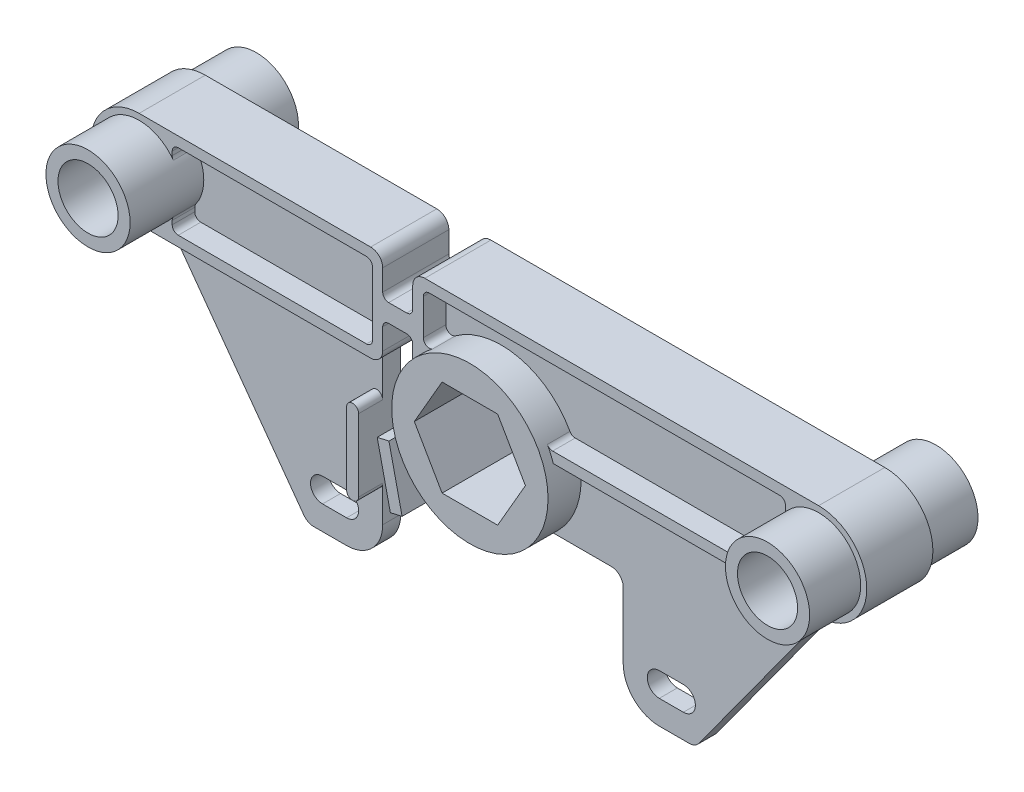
ISO-10303-21;
HEADER;
FILE_DESCRIPTION(('STEP AP214'),'2;1');
FILE_NAME('part.step','',(''),(''),'','','');
FILE_SCHEMA(('AUTOMOTIVE_DESIGN { 1 0 10303 214 1 1 1 1 }'));
ENDSEC;
DATA;
#1=APPLICATION_CONTEXT('core data for automotive mechanical design processes');
#2=APPLICATION_PROTOCOL_DEFINITION('international standard','automotive_design',2000,#1);
#3=PRODUCT_CONTEXT('',#1,'mechanical');
#4=PRODUCT('Part','Part','',(#3));
#5=PRODUCT_RELATED_PRODUCT_CATEGORY('part','',(#4));
#6=PRODUCT_DEFINITION_FORMATION('','',#4);
#7=PRODUCT_DEFINITION_CONTEXT('part definition',#1,'design');
#8=PRODUCT_DEFINITION('design','',#6,#7);
#9=PRODUCT_DEFINITION_SHAPE('','',#8);
#10=(LENGTH_UNIT() NAMED_UNIT(*) SI_UNIT(.MILLI.,.METRE.));
#11=(NAMED_UNIT(*) PLANE_ANGLE_UNIT() SI_UNIT($,.RADIAN.));
#12=(NAMED_UNIT(*) SI_UNIT($,.STERADIAN.) SOLID_ANGLE_UNIT());
#13=UNCERTAINTY_MEASURE_WITH_UNIT(LENGTH_MEASURE(1.E-05),#10,'distance_accuracy_value','');
#14=(GEOMETRIC_REPRESENTATION_CONTEXT(3) GLOBAL_UNCERTAINTY_ASSIGNED_CONTEXT((#13)) GLOBAL_UNIT_ASSIGNED_CONTEXT((#10,
#11,#12)) REPRESENTATION_CONTEXT('',''));
#15=CARTESIAN_POINT('',(0.,0.,0.));
#16=DIRECTION('',(0.,0.,1.));
#17=DIRECTION('',(1.,0.,0.));
#18=AXIS2_PLACEMENT_3D('',#15,#16,#17);
#19=CARTESIAN_POINT('',(0.,-4.49999999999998,1.5));
#20=DIRECTION('',(0.,0.,1.));
#21=DIRECTION('',(1.,0.,0.));
#22=AXIS2_PLACEMENT_3D('',#19,#20,#21);
#23=PLANE('',#22);
#24=DIRECTION('',(0.,1.,0.));
#25=VECTOR('',#24,1.);
#26=CARTESIAN_POINT('',(-20.,-4.5,1.5));
#27=LINE('',#26,#25);
#28=CARTESIAN_POINT('',(-20.,-23.,1.5));
#29=VERTEX_POINT('',#28);
#30=CARTESIAN_POINT('',(-20.,-17.,1.49999999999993));
#31=VERTEX_POINT('',#30);
#32=EDGE_CURVE('E931',#29,#31,#27,.T.);
#33=ORIENTED_EDGE('',*,*,#32,.T.);
#34=CARTESIAN_POINT('',(-21.,-17.,1.49999999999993));
#35=DIRECTION('',(0.,0.,1.));
#36=DIRECTION('',(1.,0.,0.));
#37=AXIS2_PLACEMENT_3D('',#34,#35,#36);
#38=CIRCLE('',#37,1.);
#39=CARTESIAN_POINT('',(-22.,-17.,1.49999999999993));
#40=VERTEX_POINT('',#39);
#41=EDGE_CURVE('E901',#31,#40,#38,.F.);
#42=ORIENTED_EDGE('',*,*,#41,.T.);
#43=DIRECTION('',(0.,1.,0.));
#44=VECTOR('',#43,1.);
#45=CARTESIAN_POINT('',(-22.,-4.49999999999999,1.5));
#46=LINE('',#45,#44);
#47=CARTESIAN_POINT('',(-22.,-5.00000000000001,1.5));
#48=VERTEX_POINT('',#47);
#49=EDGE_CURVE('E895',#40,#48,#46,.T.);
#50=ORIENTED_EDGE('',*,*,#49,.T.);
#51=CARTESIAN_POINT('',(-21.,-5.,1.5));
#52=DIRECTION('',(0.,0.,1.));
#53=DIRECTION('',(1.,0.,0.));
#54=AXIS2_PLACEMENT_3D('',#51,#52,#53);
#55=CIRCLE('',#54,0.999999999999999);
#56=CARTESIAN_POINT('',(-20.,-5.,1.5));
#57=VERTEX_POINT('',#56);
#58=EDGE_CURVE('E898',#48,#57,#55,.F.);
#59=ORIENTED_EDGE('',*,*,#58,.T.);
#60=CARTESIAN_POINT('',(-20.,4.00000000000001,1.5));
#61=VERTEX_POINT('',#60);
#62=EDGE_CURVE('E923',#57,#61,#27,.T.);
#63=ORIENTED_EDGE('',*,*,#62,.T.);
#64=DIRECTION('',(1.,0.,0.));
#65=VECTOR('',#64,1.);
#66=CARTESIAN_POINT('',(-16.,4.00000000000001,1.49999999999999));
#67=LINE('',#66,#65);
#68=CARTESIAN_POINT('',(-56.4759034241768,3.99999999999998,1.49999999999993));
#69=VERTEX_POINT('',#68);
#70=EDGE_CURVE('E946',#69,#61,#67,.T.);
#71=ORIENTED_EDGE('',*,*,#70,.F.);
#72=DIRECTION('',(0.58778525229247,-0.809016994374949,0.));
#73=VECTOR('',#72,1.);
#74=CARTESIAN_POINT('',(-56.8582218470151,4.5262161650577,1.49999999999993));
#75=LINE('',#74,#73);
#76=CARTESIAN_POINT('',(-33.098983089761,-28.1755705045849,1.49999999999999));
#77=VERTEX_POINT('',#76);
#78=EDGE_CURVE('E919',#69,#77,#75,.T.);
#79=ORIENTED_EDGE('',*,*,#78,.T.);
#80=CARTESIAN_POINT('',(-31.4809491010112,-27.,1.5));
#81=DIRECTION('',(0.,0.,1.));
#82=DIRECTION('',(1.,0.,0.));
#83=AXIS2_PLACEMENT_3D('',#80,#81,#82);
#84=CIRCLE('',#83,2.00000000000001);
#85=CARTESIAN_POINT('',(-31.4809491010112,-29.,1.49999999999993));
#86=VERTEX_POINT('',#85);
#87=EDGE_CURVE('E927',#77,#86,#84,.T.);
#88=ORIENTED_EDGE('',*,*,#87,.T.);
#89=DIRECTION('',(1.,0.,0.));
#90=VECTOR('',#89,1.);
#91=CARTESIAN_POINT('',(0.,-29.,1.49999999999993));
#92=LINE('',#91,#90);
#93=CARTESIAN_POINT('',(-26.,-29.,1.5));
#94=VERTEX_POINT('',#93);
#95=EDGE_CURVE('E924',#86,#94,#92,.T.);
#96=ORIENTED_EDGE('',*,*,#95,.T.);
#97=CARTESIAN_POINT('',(-26.,-23.,1.49999999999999));
#98=DIRECTION('',(0.,0.,1.));
#99=DIRECTION('',(1.,0.,0.));
#100=AXIS2_PLACEMENT_3D('',#97,#98,#99);
#101=CIRCLE('',#100,6.);
#102=EDGE_CURVE('E920',#94,#29,#101,.T.);
#103=ORIENTED_EDGE('',*,*,#102,.T.);
#104=EDGE_LOOP('',(#33,#42,#50,#59,#63,#71,#79,#88,#96,#103));
#105=FACE_BOUND('',#104,.T.);
#106=DIRECTION('',(1.,0.,0.));
#107=VECTOR('',#106,1.);
#108=CARTESIAN_POINT('',(-26.,-21.,1.5));
#109=LINE('',#108,#107);
#110=CARTESIAN_POINT('',(-30.,-21.,1.5));
#111=VERTEX_POINT('',#110);
#112=CARTESIAN_POINT('',(-26.,-21.,1.5));
#113=VERTEX_POINT('',#112);
#114=EDGE_CURVE('E770',#111,#113,#109,.T.);
#115=ORIENTED_EDGE('',*,*,#114,.T.);
#116=CARTESIAN_POINT('',(-26.,-23.,1.49999999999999));
#117=DIRECTION('',(0.,0.,-1.));
#118=DIRECTION('',(-1.,0.,0.));
#119=AXIS2_PLACEMENT_3D('',#116,#117,#118);
#120=CIRCLE('',#119,2.);
#121=CARTESIAN_POINT('',(-26.,-25.,1.5));
#122=VERTEX_POINT('',#121);
#123=EDGE_CURVE('E49',#113,#122,#120,.T.);
#124=ORIENTED_EDGE('',*,*,#123,.T.);
#125=DIRECTION('',(-1.,0.,0.));
#126=VECTOR('',#125,1.);
#127=CARTESIAN_POINT('',(-26.,-25.,1.5));
#128=LINE('',#127,#126);
#129=CARTESIAN_POINT('',(-30.,-25.,1.49999999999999));
#130=VERTEX_POINT('',#129);
#131=EDGE_CURVE('E775',#122,#130,#128,.T.);
#132=ORIENTED_EDGE('',*,*,#131,.T.);
#133=CARTESIAN_POINT('',(-30.,-23.,1.5));
#134=DIRECTION('',(0.,0.,-1.));
#135=DIRECTION('',(-1.,0.,0.));
#136=AXIS2_PLACEMENT_3D('',#133,#134,#135);
#137=CIRCLE('',#136,2.);
#138=EDGE_CURVE('E761',#130,#111,#137,.T.);
#139=ORIENTED_EDGE('',*,*,#138,.T.);
#140=EDGE_LOOP('',(#115,#124,#132,#139));
#141=FACE_BOUND('',#140,.T.);
#142=ADVANCED_FACE('F34',(#105,#141),#23,.T.);
#143=CARTESIAN_POINT('',(0.,-4.5,-1.5));
#144=DIRECTION('',(0.,0.,1.));
#145=DIRECTION('',(1.,0.,0.));
#146=AXIS2_PLACEMENT_3D('',#143,#144,#145);
#147=PLANE('',#146);
#148=CARTESIAN_POINT('',(-21.,-17.,-1.50000000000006));
#149=DIRECTION('',(0.,0.,1.));
#150=DIRECTION('',(1.,0.,0.));
#151=AXIS2_PLACEMENT_3D('',#148,#149,#150);
#152=CIRCLE('',#151,1.);
#153=CARTESIAN_POINT('',(-20.,-17.,-1.50000000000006));
#154=VERTEX_POINT('',#153);
#155=CARTESIAN_POINT('',(-22.,-17.,-1.50000000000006));
#156=VERTEX_POINT('',#155);
#157=EDGE_CURVE('E1633',#154,#156,#152,.F.);
#158=ORIENTED_EDGE('',*,*,#157,.F.);
#159=DIRECTION('',(0.,1.,0.));
#160=VECTOR('',#159,1.);
#161=CARTESIAN_POINT('',(-20.,-4.50000000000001,-1.5));
#162=LINE('',#161,#160);
#163=CARTESIAN_POINT('',(-20.,-23.,-1.5));
#164=VERTEX_POINT('',#163);
#165=EDGE_CURVE('E916',#164,#154,#162,.T.);
#166=ORIENTED_EDGE('',*,*,#165,.F.);
#167=CARTESIAN_POINT('',(-26.,-23.,-1.5));
#168=DIRECTION('',(0.,0.,1.));
#169=DIRECTION('',(1.,0.,0.));
#170=AXIS2_PLACEMENT_3D('',#167,#168,#169);
#171=CIRCLE('',#170,6.);
#172=CARTESIAN_POINT('',(-26.,-29.,-1.5));
#173=VERTEX_POINT('',#172);
#174=EDGE_CURVE('E905',#173,#164,#171,.T.);
#175=ORIENTED_EDGE('',*,*,#174,.F.);
#176=DIRECTION('',(1.,0.,0.));
#177=VECTOR('',#176,1.);
#178=CARTESIAN_POINT('',(0.,-29.,-1.50000000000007));
#179=LINE('',#178,#177);
#180=CARTESIAN_POINT('',(-31.4809491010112,-29.,-1.50000000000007));
#181=VERTEX_POINT('',#180);
#182=EDGE_CURVE('E909',#181,#173,#179,.T.);
#183=ORIENTED_EDGE('',*,*,#182,.F.);
#184=CARTESIAN_POINT('',(-31.4809491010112,-27.,-1.5));
#185=DIRECTION('',(0.,0.,1.));
#186=DIRECTION('',(1.,0.,0.));
#187=AXIS2_PLACEMENT_3D('',#184,#185,#186);
#188=CIRCLE('',#187,2.00000000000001);
#189=CARTESIAN_POINT('',(-33.098983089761,-28.1755705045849,-1.50000000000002));
#190=VERTEX_POINT('',#189);
#191=EDGE_CURVE('E912',#190,#181,#188,.T.);
#192=ORIENTED_EDGE('',*,*,#191,.F.);
#193=DIRECTION('',(0.58778525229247,-0.809016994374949,0.));
#194=VECTOR('',#193,1.);
#195=CARTESIAN_POINT('',(-56.8582218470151,4.5262161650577,-1.50000000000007));
#196=LINE('',#195,#194);
#197=CARTESIAN_POINT('',(-56.4759034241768,3.99999999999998,-1.50000000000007));
#198=VERTEX_POINT('',#197);
#199=EDGE_CURVE('E904',#198,#190,#196,.T.);
#200=ORIENTED_EDGE('',*,*,#199,.F.);
#201=DIRECTION('',(1.,0.,0.));
#202=VECTOR('',#201,1.);
#203=CARTESIAN_POINT('',(-16.,3.99999999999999,-1.5));
#204=LINE('',#203,#202);
#205=CARTESIAN_POINT('',(-20.,3.99999999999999,-1.5));
#206=VERTEX_POINT('',#205);
#207=EDGE_CURVE('E942',#198,#206,#204,.T.);
#208=ORIENTED_EDGE('',*,*,#207,.T.);
#209=CARTESIAN_POINT('',(-20.,-5.00000000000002,-1.5));
#210=VERTEX_POINT('',#209);
#211=EDGE_CURVE('E908',#210,#206,#162,.T.);
#212=ORIENTED_EDGE('',*,*,#211,.F.);
#213=CARTESIAN_POINT('',(-21.,-5.00000000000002,-1.5));
#214=DIRECTION('',(0.,0.,1.));
#215=DIRECTION('',(1.,0.,0.));
#216=AXIS2_PLACEMENT_3D('',#213,#214,#215);
#217=CIRCLE('',#216,0.999999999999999);
#218=CARTESIAN_POINT('',(-22.,-5.00000000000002,-1.5));
#219=VERTEX_POINT('',#218);
#220=EDGE_CURVE('E1630',#219,#210,#217,.F.);
#221=ORIENTED_EDGE('',*,*,#220,.F.);
#222=DIRECTION('',(0.,1.,0.));
#223=VECTOR('',#222,1.);
#224=CARTESIAN_POINT('',(-22.,-4.5,-1.5));
#225=LINE('',#224,#223);
#226=EDGE_CURVE('E1627',#156,#219,#225,.T.);
#227=ORIENTED_EDGE('',*,*,#226,.F.);
#228=EDGE_LOOP('',(#158,#166,#175,#183,#192,#200,#208,#212,#221,#227));
#229=FACE_BOUND('',#228,.T.);
#230=CARTESIAN_POINT('',(-26.,-23.,-1.5));
#231=DIRECTION('',(0.,0.,1.));
#232=DIRECTION('',(1.,0.,0.));
#233=AXIS2_PLACEMENT_3D('',#230,#231,#232);
#234=CIRCLE('',#233,2.);
#235=CARTESIAN_POINT('',(-26.,-21.,-1.5));
#236=VERTEX_POINT('',#235);
#237=CARTESIAN_POINT('',(-26.,-25.,-1.5));
#238=VERTEX_POINT('',#237);
#239=EDGE_CURVE('E11',#236,#238,#234,.F.);
#240=ORIENTED_EDGE('',*,*,#239,.F.);
#241=DIRECTION('',(1.,0.,0.));
#242=VECTOR('',#241,1.);
#243=CARTESIAN_POINT('',(0.,-21.,-1.50000000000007));
#244=LINE('',#243,#242);
#245=CARTESIAN_POINT('',(-30.,-21.,-1.5));
#246=VERTEX_POINT('',#245);
#247=EDGE_CURVE('E1661',#246,#236,#244,.T.);
#248=ORIENTED_EDGE('',*,*,#247,.F.);
#249=CARTESIAN_POINT('',(-30.,-23.,-1.5));
#250=DIRECTION('',(0.,0.,1.));
#251=DIRECTION('',(1.,0.,0.));
#252=AXIS2_PLACEMENT_3D('',#249,#250,#251);
#253=CIRCLE('',#252,2.);
#254=CARTESIAN_POINT('',(-30.,-25.,-1.5));
#255=VERTEX_POINT('',#254);
#256=EDGE_CURVE('E764',#255,#246,#253,.F.);
#257=ORIENTED_EDGE('',*,*,#256,.F.);
#258=DIRECTION('',(-1.,0.,0.));
#259=VECTOR('',#258,1.);
#260=CARTESIAN_POINT('',(0.,-25.,-1.50000000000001));
#261=LINE('',#260,#259);
#262=EDGE_CURVE('E42',#238,#255,#261,.T.);
#263=ORIENTED_EDGE('',*,*,#262,.F.);
#264=EDGE_LOOP('',(#240,#248,#257,#263));
#265=FACE_BOUND('',#264,.T.);
#266=ADVANCED_FACE('F1669',(#229,#265),#147,.F.);
#267=CARTESIAN_POINT('',(0.,-4.49999999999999,1.5));
#268=DIRECTION('',(0.,0.,1.));
#269=DIRECTION('',(1.,0.,0.));
#270=AXIS2_PLACEMENT_3D('',#267,#268,#269);
#271=PLANE('',#270);
#272=DIRECTION('',(0.975830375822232,0.218529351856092,0.));
#273=VECTOR('',#272,1.);
#274=CARTESIAN_POINT('',(-16.9093587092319,-6.86101946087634,1.49999999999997));
#275=LINE('',#274,#273);
#276=CARTESIAN_POINT('',(-14.9576979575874,-6.42396075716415,1.49999999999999));
#277=VERTEX_POINT('',#276);
#278=CARTESIAN_POINT('',(-13.9493036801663,-6.19813898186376,1.5));
#279=VERTEX_POINT('',#278);
#280=EDGE_CURVE('E840',#277,#279,#275,.T.);
#281=ORIENTED_EDGE('',*,*,#280,.F.);
#282=DIRECTION('',(0.218529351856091,-0.975830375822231,0.));
#283=VECTOR('',#282,1.);
#284=CARTESIAN_POINT('',(-14.6536719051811,-7.78157178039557,1.5));
#285=LINE('',#284,#283);
#286=CARTESIAN_POINT('',(-12.7724044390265,-16.1822645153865,1.49999999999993));
#287=VERTEX_POINT('',#286);
#288=EDGE_CURVE('E834',#277,#287,#285,.T.);
#289=ORIENTED_EDGE('',*,*,#288,.T.);
#290=DIRECTION('',(-0.975830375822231,-0.218529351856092,0.));
#291=VECTOR('',#290,1.);
#292=CARTESIAN_POINT('',(2.84088157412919,-12.685794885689,1.5));
#293=LINE('',#292,#291);
#294=CARTESIAN_POINT('',(2.84088157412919,-12.685794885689,1.5));
#295=VERTEX_POINT('',#294);
#296=EDGE_CURVE('E843',#295,#287,#293,.T.);
#297=ORIENTED_EDGE('',*,*,#296,.F.);
#298=CARTESIAN_POINT('',(0.,0.,1.5));
#299=DIRECTION('',(0.,0.,1.));
#300=DIRECTION('',(1.,0.,0.));
#301=AXIS2_PLACEMENT_3D('',#298,#299,#300);
#302=CIRCLE('',#301,13.);
#303=CARTESIAN_POINT('',(-12.4681807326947,-3.68028113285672,1.49999999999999));
#304=VERTEX_POINT('',#303);
#305=EDGE_CURVE('E858',#304,#295,#302,.T.);
#306=ORIENTED_EDGE('',*,*,#305,.F.);
#307=CARTESIAN_POINT('',(-14.3863623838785,-4.24647823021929,1.49999999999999));
#308=DIRECTION('',(0.,0.,1.));
#309=DIRECTION('',(1.,0.,0.));
#310=AXIS2_PLACEMENT_3D('',#307,#308,#309);
#311=CIRCLE('',#310,2.);
#312=EDGE_CURVE('E1644',#304,#279,#311,.F.);
#313=ORIENTED_EDGE('',*,*,#312,.T.);
#314=EDGE_LOOP('',(#281,#289,#297,#306,#313));
#315=FACE_BOUND('',#314,.T.);
#316=ADVANCED_FACE('F1690',(#315),#271,.T.);
#317=CARTESIAN_POINT('',(0.,-4.5,-1.5));
#318=DIRECTION('',(0.,0.,1.));
#319=DIRECTION('',(1.,0.,0.));
#320=AXIS2_PLACEMENT_3D('',#317,#318,#319);
#321=PLANE('',#320);
#322=DIRECTION('',(0.218529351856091,-0.975830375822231,0.));
#323=VECTOR('',#322,1.);
#324=CARTESIAN_POINT('',(-14.6536719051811,-7.78157178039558,-1.5));
#325=LINE('',#324,#323);
#326=CARTESIAN_POINT('',(-14.9576979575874,-6.42396075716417,-1.5));
#327=VERTEX_POINT('',#326);
#328=CARTESIAN_POINT('',(-12.7724044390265,-16.1822645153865,-1.50000000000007));
#329=VERTEX_POINT('',#328);
#330=EDGE_CURVE('E1636',#327,#329,#325,.T.);
#331=ORIENTED_EDGE('',*,*,#330,.F.);
#332=DIRECTION('',(0.975830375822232,0.218529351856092,0.));
#333=VECTOR('',#332,1.);
#334=CARTESIAN_POINT('',(-16.9093587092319,-6.86101946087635,-1.5));
#335=LINE('',#334,#333);
#336=CARTESIAN_POINT('',(-13.9493036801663,-6.19813898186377,-1.5));
#337=VERTEX_POINT('',#336);
#338=EDGE_CURVE('E837',#327,#337,#335,.T.);
#339=ORIENTED_EDGE('',*,*,#338,.T.);
#340=CARTESIAN_POINT('',(-14.3863623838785,-4.24647823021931,-1.5));
#341=DIRECTION('',(0.,0.,1.));
#342=DIRECTION('',(1.,0.,0.));
#343=AXIS2_PLACEMENT_3D('',#340,#341,#342);
#344=CIRCLE('',#343,2.);
#345=CARTESIAN_POINT('',(-12.4681807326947,-3.68028113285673,-1.5));
#346=VERTEX_POINT('',#345);
#347=EDGE_CURVE('E1646',#337,#346,#344,.T.);
#348=ORIENTED_EDGE('',*,*,#347,.T.);
#349=CARTESIAN_POINT('',(0.,0.,-1.5));
#350=DIRECTION('',(0.,0.,1.));
#351=DIRECTION('',(1.,0.,0.));
#352=AXIS2_PLACEMENT_3D('',#349,#350,#351);
#353=CIRCLE('',#352,13.);
#354=CARTESIAN_POINT('',(2.84088157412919,-12.685794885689,-1.5));
#355=VERTEX_POINT('',#354);
#356=EDGE_CURVE('E852',#346,#355,#353,.T.);
#357=ORIENTED_EDGE('',*,*,#356,.T.);
#358=DIRECTION('',(-0.975830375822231,-0.218529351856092,0.));
#359=VECTOR('',#358,1.);
#360=CARTESIAN_POINT('',(2.84088157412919,-12.685794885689,-1.5));
#361=LINE('',#360,#359);
#362=EDGE_CURVE('E838',#355,#329,#361,.T.);
#363=ORIENTED_EDGE('',*,*,#362,.T.);
#364=EDGE_LOOP('',(#331,#339,#348,#357,#363));
#365=FACE_BOUND('',#364,.T.);
#366=ADVANCED_FACE('F2110',(#365),#321,.F.);
#367=CARTESIAN_POINT('',(0.,0.,7.00000000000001));
#368=DIRECTION('',(0.,0.,-1.));
#369=DIRECTION('',(-1.,0.,0.));
#370=AXIS2_PLACEMENT_3D('',#367,#368,#369);
#371=CYLINDRICAL_SURFACE('',#370,13.);
#372=DIRECTION('',(0.,0.,-1.));
#373=VECTOR('',#372,1.);
#374=CARTESIAN_POINT('',(8.30662386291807,-10.,6.99999999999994));
#375=LINE('',#374,#373);
#376=CARTESIAN_POINT('',(8.30662386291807,-10.,-1.5));
#377=VERTEX_POINT('',#376);
#378=CARTESIAN_POINT('',(8.30662386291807,-10.,1.49999999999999));
#379=VERTEX_POINT('',#378);
#380=EDGE_CURVE('E1621',#377,#379,#375,.F.);
#381=ORIENTED_EDGE('',*,*,#380,.T.);
#382=CARTESIAN_POINT('',(0.,0.,1.5));
#383=DIRECTION('',(0.,0.,1.));
#384=DIRECTION('',(1.,0.,0.));
#385=AXIS2_PLACEMENT_3D('',#382,#383,#384);
#386=CIRCLE('',#385,13.);
#387=CARTESIAN_POINT('',(12.369316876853,4.00000000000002,1.5));
#388=VERTEX_POINT('',#387);
#389=EDGE_CURVE('E1007',#379,#388,#386,.T.);
#390=ORIENTED_EDGE('',*,*,#389,.T.);
#391=DIRECTION('',(0.,0.,-1.));
#392=VECTOR('',#391,1.);
#393=CARTESIAN_POINT('',(12.369316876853,4.00000000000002,7.00000000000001));
#394=LINE('',#393,#392);
#395=CARTESIAN_POINT('',(12.369316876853,4.00000000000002,5.50000000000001));
#396=VERTEX_POINT('',#395);
#397=EDGE_CURVE('E1294',#396,#388,#394,.T.);
#398=ORIENTED_EDGE('',*,*,#397,.F.);
#399=CARTESIAN_POINT('',(0.,0.,5.50000000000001));
#400=DIRECTION('',(0.,0.,1.));
#401=DIRECTION('',(1.,0.,0.));
#402=AXIS2_PLACEMENT_3D('',#399,#400,#401);
#403=CIRCLE('',#402,13.);
#404=CARTESIAN_POINT('',(11.3892039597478,6.26785714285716,5.50000000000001));
#405=VERTEX_POINT('',#404);
#406=EDGE_CURVE('E1300',#396,#405,#403,.T.);
#407=ORIENTED_EDGE('',*,*,#406,.T.);
#408=DIRECTION('',(0.,0.,-1.));
#409=VECTOR('',#408,1.);
#410=CARTESIAN_POINT('',(11.3892039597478,6.26785714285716,7.00000000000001));
#411=LINE('',#410,#409);
#412=CARTESIAN_POINT('',(11.3892039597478,6.26785714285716,1.75));
#413=VERTEX_POINT('',#412);
#414=EDGE_CURVE('E1350',#405,#413,#411,.T.);
#415=ORIENTED_EDGE('',*,*,#414,.T.);
#416=CARTESIAN_POINT('',(0.,0.,1.75));
#417=DIRECTION('',(0.,0.,-1.));
#418=DIRECTION('',(1.,0.,0.));
#419=AXIS2_PLACEMENT_3D('',#416,#417,#418);
#420=CIRCLE('',#419,13.);
#421=CARTESIAN_POINT('',(-7.66071428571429,10.5030213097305,1.75000000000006));
#422=VERTEX_POINT('',#421);
#423=EDGE_CURVE('E1127',#422,#413,#420,.T.);
#424=ORIENTED_EDGE('',*,*,#423,.F.);
#425=DIRECTION('',(0.,0.,-1.));
#426=VECTOR('',#425,1.);
#427=CARTESIAN_POINT('',(-7.66071428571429,10.5030213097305,7.00000000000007));
#428=LINE('',#427,#426);
#429=CARTESIAN_POINT('',(-7.66071428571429,10.5030213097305,5.50000000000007));
#430=VERTEX_POINT('',#429);
#431=EDGE_CURVE('E1352',#422,#430,#428,.F.);
#432=ORIENTED_EDGE('',*,*,#431,.T.);
#433=CARTESIAN_POINT('',(-11.,6.92820323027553,5.49999999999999));
#434=VERTEX_POINT('',#433);
#435=EDGE_CURVE('E1299',#430,#434,#403,.T.);
#436=ORIENTED_EDGE('',*,*,#435,.T.);
#437=DIRECTION('',(0.,0.,-1.));
#438=VECTOR('',#437,1.);
#439=CARTESIAN_POINT('',(-11.,6.92820323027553,6.99999999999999));
#440=LINE('',#439,#438);
#441=CARTESIAN_POINT('',(-11.,6.92820323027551,-5.50000000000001));
#442=VERTEX_POINT('',#441);
#443=EDGE_CURVE('E1297',#442,#434,#440,.F.);
#444=ORIENTED_EDGE('',*,*,#443,.F.);
#445=CARTESIAN_POINT('',(0.,0.,-5.50000000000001));
#446=DIRECTION('',(0.,0.,1.));
#447=DIRECTION('',(1.,0.,0.));
#448=AXIS2_PLACEMENT_3D('',#445,#446,#447);
#449=CIRCLE('',#448,13.);
#450=CARTESIAN_POINT('',(-7.66071428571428,10.5030213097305,-5.49999999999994));
#451=VERTEX_POINT('',#450);
#452=EDGE_CURVE('E1290',#451,#442,#449,.T.);
#453=ORIENTED_EDGE('',*,*,#452,.F.);
#454=DIRECTION('',(0.,0.,-1.));
#455=VECTOR('',#454,1.);
#456=CARTESIAN_POINT('',(-7.66071428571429,10.5030213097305,7.00000000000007));
#457=LINE('',#456,#455);
#458=CARTESIAN_POINT('',(-7.66071428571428,10.5030213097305,-1.74999999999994));
#459=VERTEX_POINT('',#458);
#460=EDGE_CURVE('E1473',#451,#459,#457,.F.);
#461=ORIENTED_EDGE('',*,*,#460,.T.);
#462=CARTESIAN_POINT('',(0.,0.,-1.75));
#463=DIRECTION('',(0.,0.,-1.));
#464=DIRECTION('',(1.,0.,0.));
#465=AXIS2_PLACEMENT_3D('',#462,#463,#464);
#466=CIRCLE('',#465,13.);
#467=CARTESIAN_POINT('',(11.3892039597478,6.26785714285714,-1.75));
#468=VERTEX_POINT('',#467);
#469=EDGE_CURVE('E1058',#459,#468,#466,.T.);
#470=ORIENTED_EDGE('',*,*,#469,.T.);
#471=DIRECTION('',(0.,0.,-1.));
#472=VECTOR('',#471,1.);
#473=CARTESIAN_POINT('',(11.3892039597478,6.26785714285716,7.00000000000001));
#474=LINE('',#473,#472);
#475=CARTESIAN_POINT('',(11.3892039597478,6.26785714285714,-5.49999999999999));
#476=VERTEX_POINT('',#475);
#477=EDGE_CURVE('E1470',#468,#476,#474,.T.);
#478=ORIENTED_EDGE('',*,*,#477,.T.);
#479=CARTESIAN_POINT('',(12.369316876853,4.00000000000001,-5.49999999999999));
#480=VERTEX_POINT('',#479);
#481=EDGE_CURVE('E1291',#480,#476,#449,.T.);
#482=ORIENTED_EDGE('',*,*,#481,.F.);
#483=CARTESIAN_POINT('',(12.369316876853,4.00000000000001,-1.49999999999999));
#484=VERTEX_POINT('',#483);
#485=EDGE_CURVE('E1293',#484,#480,#394,.T.);
#486=ORIENTED_EDGE('',*,*,#485,.F.);
#487=CARTESIAN_POINT('',(0.,0.,-1.5));
#488=DIRECTION('',(0.,0.,1.));
#489=DIRECTION('',(1.,0.,0.));
#490=AXIS2_PLACEMENT_3D('',#487,#488,#489);
#491=CIRCLE('',#490,13.);
#492=EDGE_CURVE('E1003',#377,#484,#491,.T.);
#493=ORIENTED_EDGE('',*,*,#492,.F.);
#494=EDGE_LOOP('',(#381,#390,#398,#407,#415,#424,#432,#436,#444,#453,#461,#470,#478,#482,#486,#493));
#495=FACE_BOUND('',#494,.T.);
#496=CARTESIAN_POINT('',(0.,0.,-7.00000000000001));
#497=DIRECTION('',(0.,0.,1.));
#498=DIRECTION('',(1.,0.,0.));
#499=AXIS2_PLACEMENT_3D('',#496,#497,#498);
#500=CIRCLE('',#499,13.);
#501=CARTESIAN_POINT('',(13.,0.,-7.));
#502=VERTEX_POINT('',#501);
#503=EDGE_CURVE('E1284',#502,#502,#500,.T.);
#504=ORIENTED_EDGE('',*,*,#503,.T.);
#505=EDGE_LOOP('',(#504));
#506=FACE_BOUND('',#505,.T.);
#507=CARTESIAN_POINT('',(0.,0.,7.00000000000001));
#508=DIRECTION('',(0.,0.,1.));
#509=DIRECTION('',(1.,0.,0.));
#510=AXIS2_PLACEMENT_3D('',#507,#508,#509);
#511=CIRCLE('',#510,13.);
#512=CARTESIAN_POINT('',(13.,0.,7.00000000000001));
#513=VERTEX_POINT('',#512);
#514=EDGE_CURVE('E1287',#513,#513,#511,.T.);
#515=ORIENTED_EDGE('',*,*,#514,.F.);
#516=EDGE_LOOP('',(#515));
#517=FACE_BOUND('',#516,.T.);
#518=DIRECTION('',(0.,0.,-1.));
#519=VECTOR('',#518,1.);
#520=CARTESIAN_POINT('',(-12.4681807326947,-3.68028113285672,6.99999999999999));
#521=LINE('',#520,#519);
#522=EDGE_CURVE('E1639',#346,#304,#521,.F.);
#523=ORIENTED_EDGE('',*,*,#522,.T.);
#524=ORIENTED_EDGE('',*,*,#305,.T.);
#525=DIRECTION('',(0.,0.,-1.));
#526=VECTOR('',#525,1.);
#527=CARTESIAN_POINT('',(2.84088157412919,-12.685794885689,7.00000000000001));
#528=LINE('',#527,#526);
#529=EDGE_CURVE('E855',#355,#295,#528,.F.);
#530=ORIENTED_EDGE('',*,*,#529,.F.);
#531=ORIENTED_EDGE('',*,*,#356,.F.);
#532=EDGE_LOOP('',(#523,#524,#530,#531));
#533=FACE_BOUND('',#532,.T.);
#534=ADVANCED_FACE('F36',(#495,#506,#517,#533),#371,.T.);
#535=CARTESIAN_POINT('',(56.5,12.,-5.49999999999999));
#536=DIRECTION('',(0.,0.,1.));
#537=DIRECTION('',(1.,0.,0.));
#538=AXIS2_PLACEMENT_3D('',#535,#536,#537);
#539=PLANE('',#538);
#540=DIRECTION('',(-1.,0.,0.));
#541=VECTOR('',#540,1.);
#542=CARTESIAN_POINT('',(-17.7,18.3,-5.49999999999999));
#543=LINE('',#542,#541);
#544=CARTESIAN_POINT('',(-18.7,18.3,-5.49999999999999));
#545=VERTEX_POINT('',#544);
#546=CARTESIAN_POINT('',(-50.,18.3,-5.50000000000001));
#547=VERTEX_POINT('',#546);
#548=EDGE_CURVE('E1088',#545,#547,#543,.T.);
#549=ORIENTED_EDGE('',*,*,#548,.T.);
#550=CARTESIAN_POINT('',(-50.,17.3,-5.50000000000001));
#551=DIRECTION('',(0.,0.,1.));
#552=DIRECTION('',(1.,0.,0.));
#553=AXIS2_PLACEMENT_3D('',#550,#551,#552);
#554=CIRCLE('',#553,1.);
#555=CARTESIAN_POINT('',(-51.,17.3,-5.50000000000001));
#556=VERTEX_POINT('',#555);
#557=EDGE_CURVE('E1541',#547,#556,#554,.T.);
#558=ORIENTED_EDGE('',*,*,#557,.T.);
#559=DIRECTION('',(0.,-1.,0.));
#560=VECTOR('',#559,1.);
#561=CARTESIAN_POINT('',(-51.,18.3,-5.50000000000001));
#562=LINE('',#561,#560);
#563=CARTESIAN_POINT('',(-51.,16.6636895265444,-5.50000000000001));
#564=VERTEX_POINT('',#563);
#565=EDGE_CURVE('E1085',#556,#564,#562,.T.);
#566=ORIENTED_EDGE('',*,*,#565,.T.);
#567=CARTESIAN_POINT('',(-50.,16.6636895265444,-5.50000000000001));
#568=DIRECTION('',(0.,0.,1.));
#569=DIRECTION('',(1.,0.,0.));
#570=AXIS2_PLACEMENT_3D('',#567,#568,#569);
#571=CIRCLE('',#570,1.);
#572=CARTESIAN_POINT('',(-50.8124999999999,16.0807283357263,-5.50000000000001));
#573=VERTEX_POINT('',#572);
#574=EDGE_CURVE('E1543',#564,#573,#571,.T.);
#575=ORIENTED_EDGE('',*,*,#574,.T.);
#576=CARTESIAN_POINT('',(-56.4999999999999,12.,-5.50000000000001));
#577=DIRECTION('',(0.,0.,1.));
#578=DIRECTION('',(1.,0.,0.));
#579=AXIS2_PLACEMENT_3D('',#576,#577,#578);
#580=CIRCLE('',#579,7.);
#581=CARTESIAN_POINT('',(-50.8124999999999,7.91927166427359,-5.50000000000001));
#582=VERTEX_POINT('',#581);
#583=EDGE_CURVE('E1304',#582,#573,#580,.F.);
#584=ORIENTED_EDGE('',*,*,#583,.F.);
#585=CARTESIAN_POINT('',(-49.9999999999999,7.33631047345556,-5.50000000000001));
#586=DIRECTION('',(0.,0.,1.));
#587=DIRECTION('',(1.,0.,0.));
#588=AXIS2_PLACEMENT_3D('',#585,#586,#587);
#589=CIRCLE('',#588,1.);
#590=CARTESIAN_POINT('',(-51.,7.33631047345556,-5.50000000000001));
#591=VERTEX_POINT('',#590);
#592=EDGE_CURVE('E1533',#582,#591,#589,.T.);
#593=ORIENTED_EDGE('',*,*,#592,.T.);
#594=DIRECTION('',(0.,-1.,0.));
#595=VECTOR('',#594,1.);
#596=CARTESIAN_POINT('',(-51.,7.66987298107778,-5.50000000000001));
#597=LINE('',#596,#595);
#598=CARTESIAN_POINT('',(-51.,6.69999999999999,-5.50000000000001));
#599=VERTEX_POINT('',#598);
#600=EDGE_CURVE('E1082',#591,#599,#597,.T.);
#601=ORIENTED_EDGE('',*,*,#600,.T.);
#602=CARTESIAN_POINT('',(-50.,6.69999999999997,-5.50000000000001));
#603=DIRECTION('',(0.,0.,1.));
#604=DIRECTION('',(1.,0.,0.));
#605=AXIS2_PLACEMENT_3D('',#602,#603,#604);
#606=CIRCLE('',#605,1.);
#607=CARTESIAN_POINT('',(-50.,5.69999999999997,-5.50000000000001));
#608=VERTEX_POINT('',#607);
#609=EDGE_CURVE('E1535',#599,#608,#606,.T.);
#610=ORIENTED_EDGE('',*,*,#609,.T.);
#611=DIRECTION('',(1.,0.,0.));
#612=VECTOR('',#611,1.);
#613=CARTESIAN_POINT('',(-51.,5.69999999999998,-5.50000000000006));
#614=LINE('',#613,#612);
#615=CARTESIAN_POINT('',(-18.7,5.69999999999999,-5.50000000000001));
#616=VERTEX_POINT('',#615);
#617=EDGE_CURVE('E1079',#608,#616,#614,.T.);
#618=ORIENTED_EDGE('',*,*,#617,.T.);
#619=CARTESIAN_POINT('',(-18.7,6.69999999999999,-5.50000000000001));
#620=DIRECTION('',(0.,0.,1.));
#621=DIRECTION('',(1.,0.,0.));
#622=AXIS2_PLACEMENT_3D('',#619,#620,#621);
#623=CIRCLE('',#622,1.);
#624=CARTESIAN_POINT('',(-17.7,6.69999999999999,-5.50000000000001));
#625=VERTEX_POINT('',#624);
#626=EDGE_CURVE('E1537',#616,#625,#623,.T.);
#627=ORIENTED_EDGE('',*,*,#626,.T.);
#628=DIRECTION('',(0.,1.,0.));
#629=VECTOR('',#628,1.);
#630=CARTESIAN_POINT('',(-17.7,5.69999999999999,-5.50000000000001));
#631=LINE('',#630,#629);
#632=CARTESIAN_POINT('',(-17.7,17.3,-5.49999999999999));
#633=VERTEX_POINT('',#632);
#634=EDGE_CURVE('E1091',#625,#633,#631,.T.);
#635=ORIENTED_EDGE('',*,*,#634,.T.);
#636=CARTESIAN_POINT('',(-18.7,17.3,-5.49999999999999));
#637=DIRECTION('',(0.,0.,1.));
#638=DIRECTION('',(1.,0.,0.));
#639=AXIS2_PLACEMENT_3D('',#636,#637,#638);
#640=CIRCLE('',#639,1.);
#641=EDGE_CURVE('E1539',#633,#545,#640,.T.);
#642=ORIENTED_EDGE('',*,*,#641,.T.);
#643=EDGE_LOOP('',(#549,#558,#566,#575,#584,#593,#601,#610,#618,#627,#635,#642));
#644=FACE_BOUND('',#643,.T.);
#645=DIRECTION('',(0.,1.,0.));
#646=VECTOR('',#645,1.);
#647=CARTESIAN_POINT('',(-16.,10.5,-5.49999999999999));
#648=LINE('',#647,#646);
#649=CARTESIAN_POINT('',(-16.,5.99999999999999,-5.50000000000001));
#650=VERTEX_POINT('',#649);
#651=CARTESIAN_POINT('',(-16.,9.49999999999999,-5.49999999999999));
#652=VERTEX_POINT('',#651);
#653=EDGE_CURVE('E1232',#650,#652,#648,.T.);
#654=ORIENTED_EDGE('',*,*,#653,.F.);
#655=CARTESIAN_POINT('',(-18.,5.99999999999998,-5.50000000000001));
#656=DIRECTION('',(0.,0.,1.));
#657=DIRECTION('',(1.,0.,0.));
#658=AXIS2_PLACEMENT_3D('',#655,#656,#657);
#659=CIRCLE('',#658,2.);
#660=CARTESIAN_POINT('',(-18.,3.99999999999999,-5.5));
#661=VERTEX_POINT('',#660);
#662=EDGE_CURVE('E1571',#650,#661,#659,.F.);
#663=ORIENTED_EDGE('',*,*,#662,.T.);
#664=DIRECTION('',(1.,0.,0.));
#665=VECTOR('',#664,1.);
#666=CARTESIAN_POINT('',(-16.,3.99999999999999,-5.50000000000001));
#667=LINE('',#666,#665);
#668=CARTESIAN_POINT('',(-56.5,3.99999999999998,-5.50000000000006));
#669=VERTEX_POINT('',#668);
#670=EDGE_CURVE('E1229',#669,#661,#667,.T.);
#671=ORIENTED_EDGE('',*,*,#670,.F.);
#672=CARTESIAN_POINT('',(-56.4999999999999,12.,-5.50000000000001));
#673=DIRECTION('',(0.,0.,1.));
#674=DIRECTION('',(1.,0.,0.));
#675=AXIS2_PLACEMENT_3D('',#672,#673,#674);
#676=CIRCLE('',#675,8.);
#677=CARTESIAN_POINT('',(-56.4999999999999,20.,-5.5));
#678=VERTEX_POINT('',#677);
#679=EDGE_CURVE('E1226',#678,#669,#676,.T.);
#680=ORIENTED_EDGE('',*,*,#679,.F.);
#681=DIRECTION('',(-1.,0.,0.));
#682=VECTOR('',#681,1.);
#683=CARTESIAN_POINT('',(-16.,20.,-5.49999999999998));
#684=LINE('',#683,#682);
#685=CARTESIAN_POINT('',(-18.,20.,-5.49999999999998));
#686=VERTEX_POINT('',#685);
#687=EDGE_CURVE('E1223',#686,#678,#684,.T.);
#688=ORIENTED_EDGE('',*,*,#687,.F.);
#689=CARTESIAN_POINT('',(-18.,18.,-5.49999999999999));
#690=DIRECTION('',(0.,0.,1.));
#691=DIRECTION('',(1.,0.,0.));
#692=AXIS2_PLACEMENT_3D('',#689,#690,#691);
#693=CIRCLE('',#692,2.);
#694=CARTESIAN_POINT('',(-16.,18.,-5.49999999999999));
#695=VERTEX_POINT('',#694);
#696=EDGE_CURVE('E1568',#686,#695,#693,.F.);
#697=ORIENTED_EDGE('',*,*,#696,.T.);
#698=DIRECTION('',(0.,1.,0.));
#699=VECTOR('',#698,1.);
#700=CARTESIAN_POINT('',(-16.,20.,-5.49999999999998));
#701=LINE('',#700,#699);
#702=CARTESIAN_POINT('',(-16.,14.5,-5.50000000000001));
#703=VERTEX_POINT('',#702);
#704=EDGE_CURVE('E1221',#703,#695,#701,.T.);
#705=ORIENTED_EDGE('',*,*,#704,.F.);
#706=CARTESIAN_POINT('',(-15.,14.5,-5.50000000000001));
#707=DIRECTION('',(0.,0.,1.));
#708=DIRECTION('',(1.,0.,0.));
#709=AXIS2_PLACEMENT_3D('',#706,#707,#708);
#710=CIRCLE('',#709,1.);
#711=CARTESIAN_POINT('',(-15.,13.5,-5.50000000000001));
#712=VERTEX_POINT('',#711);
#713=EDGE_CURVE('E1613',#703,#712,#710,.T.);
#714=ORIENTED_EDGE('',*,*,#713,.T.);
#715=DIRECTION('',(-1.,0.,0.));
#716=VECTOR('',#715,1.);
#717=CARTESIAN_POINT('',(-16.,13.5,-5.50000000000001));
#718=LINE('',#717,#716);
#719=CARTESIAN_POINT('',(-12.,13.5,-5.49999999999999));
#720=VERTEX_POINT('',#719);
#721=EDGE_CURVE('E1218',#720,#712,#718,.T.);
#722=ORIENTED_EDGE('',*,*,#721,.F.);
#723=CARTESIAN_POINT('',(-12.,14.5,-5.49999999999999));
#724=DIRECTION('',(0.,0.,1.));
#725=DIRECTION('',(1.,0.,0.));
#726=AXIS2_PLACEMENT_3D('',#723,#724,#725);
#727=CIRCLE('',#726,1.);
#728=CARTESIAN_POINT('',(-11.,14.5,-5.49999999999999));
#729=VERTEX_POINT('',#728);
#730=EDGE_CURVE('E1609',#720,#729,#727,.T.);
#731=ORIENTED_EDGE('',*,*,#730,.T.);
#732=DIRECTION('',(0.,-1.,0.));
#733=VECTOR('',#732,1.);
#734=CARTESIAN_POINT('',(-11.,20.,-5.49999999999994));
#735=LINE('',#734,#733);
#736=CARTESIAN_POINT('',(-11.,18.,-5.50000000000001));
#737=VERTEX_POINT('',#736);
#738=EDGE_CURVE('E1215',#737,#729,#735,.T.);
#739=ORIENTED_EDGE('',*,*,#738,.F.);
#740=CARTESIAN_POINT('',(-9.00000000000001,18.,-5.49999999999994));
#741=DIRECTION('',(0.,0.,1.));
#742=DIRECTION('',(1.,0.,0.));
#743=AXIS2_PLACEMENT_3D('',#740,#741,#742);
#744=CIRCLE('',#743,2.);
#745=CARTESIAN_POINT('',(-9.00000000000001,20.,-5.49999999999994));
#746=VERTEX_POINT('',#745);
#747=EDGE_CURVE('E1566',#737,#746,#744,.F.);
#748=ORIENTED_EDGE('',*,*,#747,.T.);
#749=DIRECTION('',(-1.,0.,0.));
#750=VECTOR('',#749,1.);
#751=CARTESIAN_POINT('',(-11.,20.,-5.49999999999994));
#752=LINE('',#751,#750);
#753=CARTESIAN_POINT('',(56.5,20.,-5.5));
#754=VERTEX_POINT('',#753);
#755=EDGE_CURVE('E1212',#754,#746,#752,.T.);
#756=ORIENTED_EDGE('',*,*,#755,.F.);
#757=CARTESIAN_POINT('',(56.5,12.,-5.49999999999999));
#758=DIRECTION('',(0.,0.,1.));
#759=DIRECTION('',(1.,0.,0.));
#760=AXIS2_PLACEMENT_3D('',#757,#758,#759);
#761=CIRCLE('',#760,8.);
#762=CARTESIAN_POINT('',(56.5000000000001,4.00000000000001,-5.50000000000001));
#763=VERTEX_POINT('',#762);
#764=EDGE_CURVE('E1209',#763,#754,#761,.T.);
#765=ORIENTED_EDGE('',*,*,#764,.F.);
#766=DIRECTION('',(1.,0.,0.));
#767=VECTOR('',#766,1.);
#768=CARTESIAN_POINT('',(-11.,3.99999999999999,-5.50000000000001));
#769=LINE('',#768,#767);
#770=EDGE_CURVE('E1240',#480,#763,#769,.T.);
#771=ORIENTED_EDGE('',*,*,#770,.F.);
#772=ORIENTED_EDGE('',*,*,#481,.T.);
#773=CARTESIAN_POINT('',(12.2652965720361,6.75,-5.49999999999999));
#774=DIRECTION('',(0.,0.,1.));
#775=DIRECTION('',(1.,0.,0.));
#776=AXIS2_PLACEMENT_3D('',#773,#774,#775);
#777=CIRCLE('',#776,1.);
#778=CARTESIAN_POINT('',(12.2652965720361,5.75,-5.49999999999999));
#779=VERTEX_POINT('',#778);
#780=EDGE_CURVE('E1531',#476,#779,#777,.T.);
#781=ORIENTED_EDGE('',*,*,#780,.T.);
#782=DIRECTION('',(1.,0.,0.));
#783=VECTOR('',#782,1.);
#784=CARTESIAN_POINT('',(51.,5.75000000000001,-5.50000000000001));
#785=LINE('',#784,#783);
#786=CARTESIAN_POINT('',(50.0000000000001,5.75,-5.50000000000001));
#787=VERTEX_POINT('',#786);
#788=EDGE_CURVE('E1055',#779,#787,#785,.T.);
#789=ORIENTED_EDGE('',*,*,#788,.T.);
#790=CARTESIAN_POINT('',(50.0000000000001,6.74999999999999,-5.5));
#791=DIRECTION('',(0.,0.,1.));
#792=DIRECTION('',(1.,0.,0.));
#793=AXIS2_PLACEMENT_3D('',#790,#791,#792);
#794=CIRCLE('',#793,1.);
#795=CARTESIAN_POINT('',(51.0000000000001,6.75000000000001,-5.50000000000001));
#796=VERTEX_POINT('',#795);
#797=EDGE_CURVE('E1517',#787,#796,#794,.T.);
#798=ORIENTED_EDGE('',*,*,#797,.T.);
#799=DIRECTION('',(0.,1.,0.));
#800=VECTOR('',#799,1.);
#801=CARTESIAN_POINT('',(51.,7.66987298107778,-5.49999999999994));
#802=LINE('',#801,#800);
#803=CARTESIAN_POINT('',(51.,7.33631047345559,-5.49999999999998));
#804=VERTEX_POINT('',#803);
#805=EDGE_CURVE('E1052',#796,#804,#802,.T.);
#806=ORIENTED_EDGE('',*,*,#805,.T.);
#807=CARTESIAN_POINT('',(50.,7.33631047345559,-5.50000000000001));
#808=DIRECTION('',(0.,0.,1.));
#809=DIRECTION('',(1.,0.,0.));
#810=AXIS2_PLACEMENT_3D('',#807,#808,#809);
#811=CIRCLE('',#810,1.);
#812=CARTESIAN_POINT('',(50.8125,7.91927166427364,-5.49999999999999));
#813=VERTEX_POINT('',#812);
#814=EDGE_CURVE('E1519',#804,#813,#811,.T.);
#815=ORIENTED_EDGE('',*,*,#814,.T.);
#816=CARTESIAN_POINT('',(56.5,12.,-5.49999999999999));
#817=DIRECTION('',(0.,0.,1.));
#818=DIRECTION('',(1.,0.,0.));
#819=AXIS2_PLACEMENT_3D('',#816,#817,#818);
#820=CIRCLE('',#819,7.);
#821=CARTESIAN_POINT('',(50.8125,16.0807283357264,-5.50000000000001));
#822=VERTEX_POINT('',#821);
#823=EDGE_CURVE('E1302',#822,#813,#820,.F.);
#824=ORIENTED_EDGE('',*,*,#823,.F.);
#825=CARTESIAN_POINT('',(50.,16.6636895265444,-5.49999999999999));
#826=DIRECTION('',(0.,0.,1.));
#827=DIRECTION('',(1.,0.,0.));
#828=AXIS2_PLACEMENT_3D('',#825,#826,#827);
#829=CIRCLE('',#828,1.);
#830=CARTESIAN_POINT('',(51.,16.6636895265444,-5.50000000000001));
#831=VERTEX_POINT('',#830);
#832=EDGE_CURVE('E1522',#822,#831,#829,.T.);
#833=ORIENTED_EDGE('',*,*,#832,.T.);
#834=DIRECTION('',(0.,1.,0.));
#835=VECTOR('',#834,1.);
#836=CARTESIAN_POINT('',(51.0000000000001,18.25,-5.49999999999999));
#837=LINE('',#836,#835);
#838=CARTESIAN_POINT('',(51.,17.25,-5.49999999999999));
#839=VERTEX_POINT('',#838);
#840=EDGE_CURVE('E1049',#831,#839,#837,.T.);
#841=ORIENTED_EDGE('',*,*,#840,.T.);
#842=CARTESIAN_POINT('',(50.0000000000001,17.25,-5.49999999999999));
#843=DIRECTION('',(0.,0.,1.));
#844=DIRECTION('',(1.,0.,0.));
#845=AXIS2_PLACEMENT_3D('',#842,#843,#844);
#846=CIRCLE('',#845,1.);
#847=CARTESIAN_POINT('',(50.0000000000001,18.25,-5.49999999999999));
#848=VERTEX_POINT('',#847);
#849=EDGE_CURVE('E1524',#839,#848,#846,.T.);
#850=ORIENTED_EDGE('',*,*,#849,.T.);
#851=DIRECTION('',(-1.,0.,0.));
#852=VECTOR('',#851,1.);
#853=CARTESIAN_POINT('',(51.0000000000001,18.25,-5.49999999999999));
#854=LINE('',#853,#852);
#855=CARTESIAN_POINT('',(-8.25,18.25,-5.49999999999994));
#856=VERTEX_POINT('',#855);
#857=EDGE_CURVE('E1046',#848,#856,#854,.T.);
#858=ORIENTED_EDGE('',*,*,#857,.T.);
#859=CARTESIAN_POINT('',(-8.25000000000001,17.25,-5.49999999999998));
#860=DIRECTION('',(0.,0.,1.));
#861=DIRECTION('',(1.,0.,0.));
#862=AXIS2_PLACEMENT_3D('',#859,#860,#861);
#863=CIRCLE('',#862,1.);
#864=CARTESIAN_POINT('',(-9.25000000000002,17.25,-5.50000000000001));
#865=VERTEX_POINT('',#864);
#866=EDGE_CURVE('E1526',#856,#865,#863,.T.);
#867=ORIENTED_EDGE('',*,*,#866,.T.);
#868=DIRECTION('',(0.,-0.999999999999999,0.));
#869=VECTOR('',#868,1.);
#870=CARTESIAN_POINT('',(-9.25000000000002,18.25,-5.5));
#871=LINE('',#870,#869);
#872=CARTESIAN_POINT('',(-9.25,11.3109460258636,-5.49999999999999));
#873=VERTEX_POINT('',#872);
#874=EDGE_CURVE('E1034',#865,#873,#871,.T.);
#875=ORIENTED_EDGE('',*,*,#874,.T.);
#876=CARTESIAN_POINT('',(-8.25,11.3109460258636,-5.49999999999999));
#877=DIRECTION('',(0.,0.,1.));
#878=DIRECTION('',(1.,0.,0.));
#879=AXIS2_PLACEMENT_3D('',#876,#877,#878);
#880=CIRCLE('',#879,1.);
#881=EDGE_CURVE('E1528',#873,#451,#880,.T.);
#882=ORIENTED_EDGE('',*,*,#881,.T.);
#883=ORIENTED_EDGE('',*,*,#452,.T.);
#884=DIRECTION('',(0.,-1.,0.));
#885=VECTOR('',#884,1.);
#886=CARTESIAN_POINT('',(-11.,10.5,-5.49999999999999));
#887=LINE('',#886,#885);
#888=CARTESIAN_POINT('',(-11.,9.49999999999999,-5.49999999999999));
#889=VERTEX_POINT('',#888);
#890=EDGE_CURVE('E1238',#889,#442,#887,.T.);
#891=ORIENTED_EDGE('',*,*,#890,.F.);
#892=CARTESIAN_POINT('',(-12.,9.49999999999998,-5.49999999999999));
#893=DIRECTION('',(0.,0.,1.));
#894=DIRECTION('',(1.,0.,0.));
#895=AXIS2_PLACEMENT_3D('',#892,#893,#894);
#896=CIRCLE('',#895,1.);
#897=CARTESIAN_POINT('',(-12.,10.5,-5.49999999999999));
#898=VERTEX_POINT('',#897);
#899=EDGE_CURVE('E1605',#889,#898,#896,.T.);
#900=ORIENTED_EDGE('',*,*,#899,.T.);
#901=DIRECTION('',(1.,0.,0.));
#902=VECTOR('',#901,1.);
#903=CARTESIAN_POINT('',(-16.,10.5,-5.49999999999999));
#904=LINE('',#903,#902);
#905=CARTESIAN_POINT('',(-15.,10.5,-5.49999999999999));
#906=VERTEX_POINT('',#905);
#907=EDGE_CURVE('E1235',#906,#898,#904,.T.);
#908=ORIENTED_EDGE('',*,*,#907,.F.);
#909=CARTESIAN_POINT('',(-15.,9.49999999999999,-5.49999999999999));
#910=DIRECTION('',(0.,0.,1.));
#911=DIRECTION('',(1.,0.,0.));
#912=AXIS2_PLACEMENT_3D('',#909,#910,#911);
#913=CIRCLE('',#912,1.);
#914=EDGE_CURVE('E1617',#906,#652,#913,.T.);
#915=ORIENTED_EDGE('',*,*,#914,.T.);
#916=EDGE_LOOP('',(#654,#663,#671,#680,#688,#697,#705,#714,#722,#731,#739,#748,#756,#765,#771,
#772,#781,#789,#798,#806,#815,#824,#833,#841,#850,#858,#867,#875,#882,#883,#891,#900,#908,#915));
#917=FACE_BOUND('',#916,.T.);
#918=ADVANCED_FACE('F2039',(#644,#917),#539,.F.);
#919=CARTESIAN_POINT('',(56.5,12.,5.50000000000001));
#920=DIRECTION('',(0.,0.,1.));
#921=DIRECTION('',(1.,0.,0.));
#922=AXIS2_PLACEMENT_3D('',#919,#920,#921);
#923=PLANE('',#922);
#924=DIRECTION('',(1.,0.,0.));
#925=VECTOR('',#924,1.);
#926=CARTESIAN_POINT('',(-16.,4.00000000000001,5.49999999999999));
#927=LINE('',#926,#925);
#928=CARTESIAN_POINT('',(-56.4999999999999,3.99999999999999,5.49999999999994));
#929=VERTEX_POINT('',#928);
#930=CARTESIAN_POINT('',(-18.,4.00000000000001,5.50000000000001));
#931=VERTEX_POINT('',#930);
#932=EDGE_CURVE('E1262',#929,#931,#927,.T.);
#933=ORIENTED_EDGE('',*,*,#932,.T.);
#934=CARTESIAN_POINT('',(-18.,6.,5.50000000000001));
#935=DIRECTION('',(0.,0.,1.));
#936=DIRECTION('',(1.,0.,0.));
#937=AXIS2_PLACEMENT_3D('',#934,#935,#936);
#938=CIRCLE('',#937,2.);
#939=CARTESIAN_POINT('',(-16.,6.,5.50000000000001));
#940=VERTEX_POINT('',#939);
#941=EDGE_CURVE('E1579',#931,#940,#938,.T.);
#942=ORIENTED_EDGE('',*,*,#941,.T.);
#943=DIRECTION('',(0.,1.,0.));
#944=VECTOR('',#943,1.);
#945=CARTESIAN_POINT('',(-16.,10.5,5.50000000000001));
#946=LINE('',#945,#944);
#947=CARTESIAN_POINT('',(-16.,9.50000000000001,5.50000000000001));
#948=VERTEX_POINT('',#947);
#949=EDGE_CURVE('E1265',#940,#948,#946,.T.);
#950=ORIENTED_EDGE('',*,*,#949,.T.);
#951=CARTESIAN_POINT('',(-15.,9.50000000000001,5.50000000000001));
#952=DIRECTION('',(0.,0.,1.));
#953=DIRECTION('',(1.,0.,0.));
#954=AXIS2_PLACEMENT_3D('',#951,#952,#953);
#955=CIRCLE('',#954,1.);
#956=CARTESIAN_POINT('',(-15.,10.5,5.50000000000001));
#957=VERTEX_POINT('',#956);
#958=EDGE_CURVE('E1619',#948,#957,#955,.F.);
#959=ORIENTED_EDGE('',*,*,#958,.T.);
#960=DIRECTION('',(1.,0.,0.));
#961=VECTOR('',#960,1.);
#962=CARTESIAN_POINT('',(-16.,10.5,5.50000000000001));
#963=LINE('',#962,#961);
#964=CARTESIAN_POINT('',(-12.,10.5,5.50000000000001));
#965=VERTEX_POINT('',#964);
#966=EDGE_CURVE('E1268',#957,#965,#963,.T.);
#967=ORIENTED_EDGE('',*,*,#966,.T.);
#968=CARTESIAN_POINT('',(-12.,9.50000000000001,5.50000000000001));
#969=DIRECTION('',(0.,0.,1.));
#970=DIRECTION('',(1.,0.,0.));
#971=AXIS2_PLACEMENT_3D('',#968,#969,#970);
#972=CIRCLE('',#971,1.);
#973=CARTESIAN_POINT('',(-11.,9.5,5.50000000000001));
#974=VERTEX_POINT('',#973);
#975=EDGE_CURVE('E1607',#965,#974,#972,.F.);
#976=ORIENTED_EDGE('',*,*,#975,.T.);
#977=DIRECTION('',(0.,-1.,0.));
#978=VECTOR('',#977,1.);
#979=CARTESIAN_POINT('',(-11.,10.5,5.50000000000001));
#980=LINE('',#979,#978);
#981=EDGE_CURVE('E1271',#974,#434,#980,.T.);
#982=ORIENTED_EDGE('',*,*,#981,.T.);
#983=ORIENTED_EDGE('',*,*,#435,.F.);
#984=CARTESIAN_POINT('',(-8.24999999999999,11.3109460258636,5.50000000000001));
#985=DIRECTION('',(0.,0.,1.));
#986=DIRECTION('',(1.,0.,0.));
#987=AXIS2_PLACEMENT_3D('',#984,#985,#986);
#988=CIRCLE('',#987,1.);
#989=CARTESIAN_POINT('',(-9.25,11.3109460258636,5.50000000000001));
#990=VERTEX_POINT('',#989);
#991=EDGE_CURVE('E1408',#430,#990,#988,.F.);
#992=ORIENTED_EDGE('',*,*,#991,.T.);
#993=DIRECTION('',(0.,-0.999999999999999,0.));
#994=VECTOR('',#993,1.);
#995=CARTESIAN_POINT('',(-9.25000000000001,18.25,5.50000000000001));
#996=LINE('',#995,#994);
#997=CARTESIAN_POINT('',(-9.25000000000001,17.25,5.50000000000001));
#998=VERTEX_POINT('',#997);
#999=EDGE_CURVE('E1124',#998,#990,#996,.T.);
#1000=ORIENTED_EDGE('',*,*,#999,.F.);
#1001=CARTESIAN_POINT('',(-8.24999999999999,17.25,5.50000000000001));
#1002=DIRECTION('',(0.,0.,1.));
#1003=DIRECTION('',(1.,0.,0.));
#1004=AXIS2_PLACEMENT_3D('',#1001,#1002,#1003);
#1005=CIRCLE('',#1004,1.);
#1006=CARTESIAN_POINT('',(-8.25,18.25,5.50000000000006));
#1007=VERTEX_POINT('',#1006);
#1008=EDGE_CURVE('E1406',#998,#1007,#1005,.F.);
#1009=ORIENTED_EDGE('',*,*,#1008,.T.);
#1010=DIRECTION('',(-1.,0.,0.));
#1011=VECTOR('',#1010,1.);
#1012=CARTESIAN_POINT('',(51.0000000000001,18.25,5.50000000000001));
#1013=LINE('',#1012,#1011);
#1014=CARTESIAN_POINT('',(50.0000000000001,18.25,5.50000000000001));
#1015=VERTEX_POINT('',#1014);
#1016=EDGE_CURVE('E1121',#1015,#1007,#1013,.T.);
#1017=ORIENTED_EDGE('',*,*,#1016,.F.);
#1018=CARTESIAN_POINT('',(50.0000000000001,17.25,5.50000000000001));
#1019=DIRECTION('',(0.,0.,1.));
#1020=DIRECTION('',(1.,0.,0.));
#1021=AXIS2_PLACEMENT_3D('',#1018,#1019,#1020);
#1022=CIRCLE('',#1021,1.);
#1023=CARTESIAN_POINT('',(51.,17.25,5.50000000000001));
#1024=VERTEX_POINT('',#1023);
#1025=EDGE_CURVE('E1404',#1015,#1024,#1022,.F.);
#1026=ORIENTED_EDGE('',*,*,#1025,.T.);
#1027=DIRECTION('',(0.,1.,0.));
#1028=VECTOR('',#1027,1.);
#1029=CARTESIAN_POINT('',(51.0000000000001,18.25,5.50000000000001));
#1030=LINE('',#1029,#1028);
#1031=CARTESIAN_POINT('',(51.,16.6636895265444,5.50000000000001));
#1032=VERTEX_POINT('',#1031);
#1033=EDGE_CURVE('E1118',#1032,#1024,#1030,.T.);
#1034=ORIENTED_EDGE('',*,*,#1033,.F.);
#1035=CARTESIAN_POINT('',(50.,16.6636895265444,5.50000000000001));
#1036=DIRECTION('',(0.,0.,1.));
#1037=DIRECTION('',(1.,0.,0.));
#1038=AXIS2_PLACEMENT_3D('',#1035,#1036,#1037);
#1039=CIRCLE('',#1038,1.);
#1040=CARTESIAN_POINT('',(50.8125,16.0807283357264,5.5));
#1041=VERTEX_POINT('',#1040);
#1042=EDGE_CURVE('E1401',#1032,#1041,#1039,.F.);
#1043=ORIENTED_EDGE('',*,*,#1042,.T.);
#1044=CARTESIAN_POINT('',(56.5,12.,5.50000000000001));
#1045=DIRECTION('',(0.,0.,1.));
#1046=DIRECTION('',(1.,0.,0.));
#1047=AXIS2_PLACEMENT_3D('',#1044,#1045,#1046);
#1048=CIRCLE('',#1047,7.);
#1049=CARTESIAN_POINT('',(50.8125,7.91927166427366,5.50000000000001));
#1050=VERTEX_POINT('',#1049);
#1051=EDGE_CURVE('E1207',#1041,#1050,#1048,.F.);
#1052=ORIENTED_EDGE('',*,*,#1051,.T.);
#1053=CARTESIAN_POINT('',(50.0000000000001,7.33631047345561,5.50000000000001));
#1054=DIRECTION('',(0.,0.,1.));
#1055=DIRECTION('',(1.,0.,0.));
#1056=AXIS2_PLACEMENT_3D('',#1053,#1054,#1055);
#1057=CIRCLE('',#1056,1.);
#1058=CARTESIAN_POINT('',(51.,7.3363104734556,5.50000000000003));
#1059=VERTEX_POINT('',#1058);
#1060=EDGE_CURVE('E1399',#1050,#1059,#1057,.F.);
#1061=ORIENTED_EDGE('',*,*,#1060,.T.);
#1062=DIRECTION('',(0.,1.,0.));
#1063=VECTOR('',#1062,1.);
#1064=CARTESIAN_POINT('',(51.0000000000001,7.66987298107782,5.50000000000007));
#1065=LINE('',#1064,#1063);
#1066=CARTESIAN_POINT('',(51.0000000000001,6.75000000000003,5.49999999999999));
#1067=VERTEX_POINT('',#1066);
#1068=EDGE_CURVE('E1115',#1067,#1059,#1065,.T.);
#1069=ORIENTED_EDGE('',*,*,#1068,.F.);
#1070=CARTESIAN_POINT('',(50.0000000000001,6.75000000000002,5.50000000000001));
#1071=DIRECTION('',(0.,0.,1.));
#1072=DIRECTION('',(1.,0.,0.));
#1073=AXIS2_PLACEMENT_3D('',#1070,#1071,#1072);
#1074=CIRCLE('',#1073,1.);
#1075=CARTESIAN_POINT('',(50.0000000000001,5.75000000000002,5.49999999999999));
#1076=VERTEX_POINT('',#1075);
#1077=EDGE_CURVE('E1397',#1067,#1076,#1074,.F.);
#1078=ORIENTED_EDGE('',*,*,#1077,.T.);
#1079=DIRECTION('',(1.,0.,0.));
#1080=VECTOR('',#1079,1.);
#1081=CARTESIAN_POINT('',(51.0000000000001,5.75000000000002,5.49999999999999));
#1082=LINE('',#1081,#1080);
#1083=CARTESIAN_POINT('',(12.2652965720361,5.75000000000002,5.50000000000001));
#1084=VERTEX_POINT('',#1083);
#1085=EDGE_CURVE('E1112',#1084,#1076,#1082,.T.);
#1086=ORIENTED_EDGE('',*,*,#1085,.F.);
#1087=CARTESIAN_POINT('',(12.2652965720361,6.75,5.50000000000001));
#1088=DIRECTION('',(0.,0.,1.));
#1089=DIRECTION('',(1.,0.,0.));
#1090=AXIS2_PLACEMENT_3D('',#1087,#1088,#1089);
#1091=CIRCLE('',#1090,1.);
#1092=EDGE_CURVE('E1410',#1084,#405,#1091,.F.);
#1093=ORIENTED_EDGE('',*,*,#1092,.T.);
#1094=ORIENTED_EDGE('',*,*,#406,.F.);
#1095=DIRECTION('',(1.,0.,0.));
#1096=VECTOR('',#1095,1.);
#1097=CARTESIAN_POINT('',(-11.,4.00000000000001,5.49999999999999));
#1098=LINE('',#1097,#1096);
#1099=CARTESIAN_POINT('',(56.5000000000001,4.00000000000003,5.49999999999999));
#1100=VERTEX_POINT('',#1099);
#1101=EDGE_CURVE('E1274',#396,#1100,#1098,.T.);
#1102=ORIENTED_EDGE('',*,*,#1101,.T.);
#1103=CARTESIAN_POINT('',(56.5,12.,5.50000000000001));
#1104=DIRECTION('',(0.,0.,1.));
#1105=DIRECTION('',(1.,0.,0.));
#1106=AXIS2_PLACEMENT_3D('',#1103,#1104,#1105);
#1107=CIRCLE('',#1106,8.);
#1108=CARTESIAN_POINT('',(56.5000000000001,20.,5.50000000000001));
#1109=VERTEX_POINT('',#1108);
#1110=EDGE_CURVE('E1243',#1100,#1109,#1107,.T.);
#1111=ORIENTED_EDGE('',*,*,#1110,.T.);
#1112=DIRECTION('',(-1.,0.,0.));
#1113=VECTOR('',#1112,1.);
#1114=CARTESIAN_POINT('',(-11.,20.,5.50000000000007));
#1115=LINE('',#1114,#1113);
#1116=CARTESIAN_POINT('',(-9.,20.,5.50000000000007));
#1117=VERTEX_POINT('',#1116);
#1118=EDGE_CURVE('E1246',#1109,#1117,#1115,.T.);
#1119=ORIENTED_EDGE('',*,*,#1118,.T.);
#1120=CARTESIAN_POINT('',(-8.99999999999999,18.,5.50000000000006));
#1121=DIRECTION('',(0.,0.,1.));
#1122=DIRECTION('',(1.,0.,0.));
#1123=AXIS2_PLACEMENT_3D('',#1120,#1121,#1122);
#1124=CIRCLE('',#1123,2.);
#1125=CARTESIAN_POINT('',(-11.,18.,5.5));
#1126=VERTEX_POINT('',#1125);
#1127=EDGE_CURVE('E1575',#1117,#1126,#1124,.T.);
#1128=ORIENTED_EDGE('',*,*,#1127,.T.);
#1129=DIRECTION('',(0.,-1.,0.));
#1130=VECTOR('',#1129,1.);
#1131=CARTESIAN_POINT('',(-11.,20.,5.50000000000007));
#1132=LINE('',#1131,#1130);
#1133=CARTESIAN_POINT('',(-11.,14.5,5.50000000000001));
#1134=VERTEX_POINT('',#1133);
#1135=EDGE_CURVE('E1249',#1126,#1134,#1132,.T.);
#1136=ORIENTED_EDGE('',*,*,#1135,.T.);
#1137=CARTESIAN_POINT('',(-12.,14.5,5.50000000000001));
#1138=DIRECTION('',(0.,0.,1.));
#1139=DIRECTION('',(1.,0.,0.));
#1140=AXIS2_PLACEMENT_3D('',#1137,#1138,#1139);
#1141=CIRCLE('',#1140,1.);
#1142=CARTESIAN_POINT('',(-12.,13.5,5.50000000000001));
#1143=VERTEX_POINT('',#1142);
#1144=EDGE_CURVE('E1611',#1134,#1143,#1141,.F.);
#1145=ORIENTED_EDGE('',*,*,#1144,.T.);
#1146=DIRECTION('',(-1.,0.,0.));
#1147=VECTOR('',#1146,1.);
#1148=CARTESIAN_POINT('',(-16.,13.5,5.50000000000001));
#1149=LINE('',#1148,#1147);
#1150=CARTESIAN_POINT('',(-15.,13.5,5.50000000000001));
#1151=VERTEX_POINT('',#1150);
#1152=EDGE_CURVE('E1252',#1143,#1151,#1149,.T.);
#1153=ORIENTED_EDGE('',*,*,#1152,.T.);
#1154=CARTESIAN_POINT('',(-15.,14.5,5.5));
#1155=DIRECTION('',(0.,0.,1.));
#1156=DIRECTION('',(1.,0.,0.));
#1157=AXIS2_PLACEMENT_3D('',#1154,#1155,#1156);
#1158=CIRCLE('',#1157,1.);
#1159=CARTESIAN_POINT('',(-16.,14.5,5.5));
#1160=VERTEX_POINT('',#1159);
#1161=EDGE_CURVE('E1615',#1151,#1160,#1158,.F.);
#1162=ORIENTED_EDGE('',*,*,#1161,.T.);
#1163=DIRECTION('',(0.,1.,0.));
#1164=VECTOR('',#1163,1.);
#1165=CARTESIAN_POINT('',(-16.,20.,5.50000000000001));
#1166=LINE('',#1165,#1164);
#1167=CARTESIAN_POINT('',(-16.,18.,5.50000000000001));
#1168=VERTEX_POINT('',#1167);
#1169=EDGE_CURVE('E1255',#1160,#1168,#1166,.T.);
#1170=ORIENTED_EDGE('',*,*,#1169,.T.);
#1171=CARTESIAN_POINT('',(-18.,18.,5.50000000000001));
#1172=DIRECTION('',(0.,0.,1.));
#1173=DIRECTION('',(1.,0.,0.));
#1174=AXIS2_PLACEMENT_3D('',#1171,#1172,#1173);
#1175=CIRCLE('',#1174,2.);
#1176=CARTESIAN_POINT('',(-18.,20.,5.50000000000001));
#1177=VERTEX_POINT('',#1176);
#1178=EDGE_CURVE('E1577',#1168,#1177,#1175,.T.);
#1179=ORIENTED_EDGE('',*,*,#1178,.T.);
#1180=DIRECTION('',(-1.,0.,0.));
#1181=VECTOR('',#1180,1.);
#1182=CARTESIAN_POINT('',(-16.,20.,5.50000000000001));
#1183=LINE('',#1182,#1181);
#1184=CARTESIAN_POINT('',(-56.4999999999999,20.,5.50000000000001));
#1185=VERTEX_POINT('',#1184);
#1186=EDGE_CURVE('E1258',#1177,#1185,#1183,.T.);
#1187=ORIENTED_EDGE('',*,*,#1186,.T.);
#1188=CARTESIAN_POINT('',(-56.4999999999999,12.,5.50000000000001));
#1189=DIRECTION('',(0.,0.,1.));
#1190=DIRECTION('',(1.,0.,0.));
#1191=AXIS2_PLACEMENT_3D('',#1188,#1189,#1190);
#1192=CIRCLE('',#1191,8.);
#1193=EDGE_CURVE('E1260',#1185,#929,#1192,.T.);
#1194=ORIENTED_EDGE('',*,*,#1193,.T.);
#1195=EDGE_LOOP('',(#933,#942,#950,#959,#967,#976,#982,#983,#992,#1000,#1009,#1017,#1026,#1034,
#1043,#1052,#1061,#1069,#1078,#1086,#1093,#1094,#1102,#1111,#1119,#1128,#1136,#1145,#1153,#1162,
#1170,#1179,#1187,#1194));
#1196=FACE_BOUND('',#1195,.T.);
#1197=DIRECTION('',(0.,-1.,0.));
#1198=VECTOR('',#1197,1.);
#1199=CARTESIAN_POINT('',(-51.,7.66987298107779,5.49999999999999));
#1200=LINE('',#1199,#1198);
#1201=CARTESIAN_POINT('',(-51.,7.33631047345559,5.49999999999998));
#1202=VERTEX_POINT('',#1201);
#1203=CARTESIAN_POINT('',(-51.,6.7,5.49999999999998));
#1204=VERTEX_POINT('',#1203);
#1205=EDGE_CURVE('E1160',#1202,#1204,#1200,.T.);
#1206=ORIENTED_EDGE('',*,*,#1205,.F.);
#1207=CARTESIAN_POINT('',(-49.9999999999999,7.33631047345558,5.49999999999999));
#1208=DIRECTION('',(0.,0.,1.));
#1209=DIRECTION('',(1.,0.,0.));
#1210=AXIS2_PLACEMENT_3D('',#1207,#1208,#1209);
#1211=CIRCLE('',#1210,1.);
#1212=CARTESIAN_POINT('',(-50.8124999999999,7.91927166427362,5.49999999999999));
#1213=VERTEX_POINT('',#1212);
#1214=EDGE_CURVE('E1413',#1202,#1213,#1211,.F.);
#1215=ORIENTED_EDGE('',*,*,#1214,.T.);
#1216=CARTESIAN_POINT('',(-56.4999999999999,12.,5.50000000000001));
#1217=DIRECTION('',(0.,0.,1.));
#1218=DIRECTION('',(1.,0.,0.));
#1219=AXIS2_PLACEMENT_3D('',#1216,#1217,#1218);
#1220=CIRCLE('',#1219,7.);
#1221=CARTESIAN_POINT('',(-50.8124999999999,16.0807283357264,5.50000000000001));
#1222=VERTEX_POINT('',#1221);
#1223=EDGE_CURVE('E1199',#1213,#1222,#1220,.F.);
#1224=ORIENTED_EDGE('',*,*,#1223,.T.);
#1225=CARTESIAN_POINT('',(-50.,16.6636895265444,5.50000000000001));
#1226=DIRECTION('',(0.,0.,1.));
#1227=DIRECTION('',(1.,0.,0.));
#1228=AXIS2_PLACEMENT_3D('',#1225,#1226,#1227);
#1229=CIRCLE('',#1228,1.);
#1230=CARTESIAN_POINT('',(-51.,16.6636895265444,5.49999999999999));
#1231=VERTEX_POINT('',#1230);
#1232=EDGE_CURVE('E1424',#1222,#1231,#1229,.F.);
#1233=ORIENTED_EDGE('',*,*,#1232,.T.);
#1234=DIRECTION('',(0.,-1.,0.));
#1235=VECTOR('',#1234,1.);
#1236=CARTESIAN_POINT('',(-51.,18.3,5.49999999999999));
#1237=LINE('',#1236,#1235);
#1238=CARTESIAN_POINT('',(-51.,17.3,5.49999999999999));
#1239=VERTEX_POINT('',#1238);
#1240=EDGE_CURVE('E1157',#1239,#1231,#1237,.T.);
#1241=ORIENTED_EDGE('',*,*,#1240,.F.);
#1242=CARTESIAN_POINT('',(-50.,17.3,5.49999999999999));
#1243=DIRECTION('',(0.,0.,1.));
#1244=DIRECTION('',(1.,0.,0.));
#1245=AXIS2_PLACEMENT_3D('',#1242,#1243,#1244);
#1246=CIRCLE('',#1245,1.);
#1247=CARTESIAN_POINT('',(-50.,18.3,5.50000000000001));
#1248=VERTEX_POINT('',#1247);
#1249=EDGE_CURVE('E1422',#1239,#1248,#1246,.F.);
#1250=ORIENTED_EDGE('',*,*,#1249,.T.);
#1251=DIRECTION('',(-1.,0.,0.));
#1252=VECTOR('',#1251,1.);
#1253=CARTESIAN_POINT('',(-17.7,18.3,5.50000000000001));
#1254=LINE('',#1253,#1252);
#1255=CARTESIAN_POINT('',(-18.7,18.3,5.50000000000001));
#1256=VERTEX_POINT('',#1255);
#1257=EDGE_CURVE('E1154',#1256,#1248,#1254,.T.);
#1258=ORIENTED_EDGE('',*,*,#1257,.F.);
#1259=CARTESIAN_POINT('',(-18.7,17.3,5.50000000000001));
#1260=DIRECTION('',(0.,0.,1.));
#1261=DIRECTION('',(1.,0.,0.));
#1262=AXIS2_PLACEMENT_3D('',#1259,#1260,#1261);
#1263=CIRCLE('',#1262,1.);
#1264=CARTESIAN_POINT('',(-17.7,17.3,5.50000000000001));
#1265=VERTEX_POINT('',#1264);
#1266=EDGE_CURVE('E1420',#1256,#1265,#1263,.F.);
#1267=ORIENTED_EDGE('',*,*,#1266,.T.);
#1268=DIRECTION('',(0.,1.,0.));
#1269=VECTOR('',#1268,1.);
#1270=CARTESIAN_POINT('',(-17.7,5.70000000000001,5.49999999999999));
#1271=LINE('',#1270,#1269);
#1272=CARTESIAN_POINT('',(-17.7,6.7,5.50000000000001));
#1273=VERTEX_POINT('',#1272);
#1274=EDGE_CURVE('E1151',#1273,#1265,#1271,.T.);
#1275=ORIENTED_EDGE('',*,*,#1274,.F.);
#1276=CARTESIAN_POINT('',(-18.7,6.7,5.50000000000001));
#1277=DIRECTION('',(0.,0.,1.));
#1278=DIRECTION('',(1.,0.,0.));
#1279=AXIS2_PLACEMENT_3D('',#1276,#1277,#1278);
#1280=CIRCLE('',#1279,1.);
#1281=CARTESIAN_POINT('',(-18.7,5.70000000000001,5.49999999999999));
#1282=VERTEX_POINT('',#1281);
#1283=EDGE_CURVE('E1418',#1273,#1282,#1280,.F.);
#1284=ORIENTED_EDGE('',*,*,#1283,.T.);
#1285=DIRECTION('',(1.,0.,0.));
#1286=VECTOR('',#1285,1.);
#1287=CARTESIAN_POINT('',(-51.,5.69999999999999,5.49999999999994));
#1288=LINE('',#1287,#1286);
#1289=CARTESIAN_POINT('',(-49.9999999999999,5.69999999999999,5.49999999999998));
#1290=VERTEX_POINT('',#1289);
#1291=EDGE_CURVE('E1148',#1290,#1282,#1288,.T.);
#1292=ORIENTED_EDGE('',*,*,#1291,.F.);
#1293=CARTESIAN_POINT('',(-49.9999999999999,6.69999999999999,5.49999999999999));
#1294=DIRECTION('',(0.,0.,1.));
#1295=DIRECTION('',(1.,0.,0.));
#1296=AXIS2_PLACEMENT_3D('',#1293,#1294,#1295);
#1297=CIRCLE('',#1296,1.);
#1298=EDGE_CURVE('E1416',#1290,#1204,#1297,.F.);
#1299=ORIENTED_EDGE('',*,*,#1298,.T.);
#1300=EDGE_LOOP('',(#1206,#1215,#1224,#1233,#1241,#1250,#1258,#1267,#1275,#1284,#1292,#1299));
#1301=FACE_BOUND('',#1300,.T.);
#1302=ADVANCED_FACE('F2042',(#1196,#1301),#923,.T.);
#1303=CARTESIAN_POINT('',(0.,0.,7.00000000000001));
#1304=DIRECTION('',(0.,0.,1.));
#1305=DIRECTION('',(1.,0.,0.));
#1306=AXIS2_PLACEMENT_3D('',#1303,#1304,#1305);
#1307=PLANE('',#1306);
#1308=DIRECTION('',(0.500000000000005,0.866025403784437,0.));
#1309=VECTOR('',#1308,1.);
#1310=CARTESIAN_POINT('',(9.23760430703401,0.,7.00000000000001));
#1311=LINE('',#1310,#1309);
#1312=CARTESIAN_POINT('',(4.61880215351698,-8.00000000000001,6.99999999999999));
#1313=VERTEX_POINT('',#1312);
#1314=CARTESIAN_POINT('',(9.23760430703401,0.,7.00000000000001));
#1315=VERTEX_POINT('',#1314);
#1316=EDGE_CURVE('E1013',#1313,#1315,#1311,.T.);
#1317=ORIENTED_EDGE('',*,*,#1316,.F.);
#1318=DIRECTION('',(1.,0.,0.));
#1319=VECTOR('',#1318,1.);
#1320=CARTESIAN_POINT('',(-4.61880215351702,-8.,6.99999999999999));
#1321=LINE('',#1320,#1319);
#1322=CARTESIAN_POINT('',(-4.61880215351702,-8.,6.99999999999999));
#1323=VERTEX_POINT('',#1322);
#1324=EDGE_CURVE('E1028',#1323,#1313,#1321,.T.);
#1325=ORIENTED_EDGE('',*,*,#1324,.F.);
#1326=DIRECTION('',(0.499999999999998,-0.866025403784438,0.));
#1327=VECTOR('',#1326,1.);
#1328=CARTESIAN_POINT('',(-9.23760430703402,0.,7.00000000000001));
#1329=LINE('',#1328,#1327);
#1330=CARTESIAN_POINT('',(-9.23760430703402,0.,7.00000000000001));
#1331=VERTEX_POINT('',#1330);
#1332=EDGE_CURVE('E1025',#1331,#1323,#1329,.T.);
#1333=ORIENTED_EDGE('',*,*,#1332,.F.);
#1334=DIRECTION('',(-0.500000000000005,-0.866025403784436,0.));
#1335=VECTOR('',#1334,1.);
#1336=CARTESIAN_POINT('',(-4.61880215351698,8.00000000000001,7.00000000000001));
#1337=LINE('',#1336,#1335);
#1338=CARTESIAN_POINT('',(-4.61880215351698,8.00000000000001,7.00000000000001));
#1339=VERTEX_POINT('',#1338);
#1340=EDGE_CURVE('E1022',#1339,#1331,#1337,.T.);
#1341=ORIENTED_EDGE('',*,*,#1340,.F.);
#1342=DIRECTION('',(-1.,0.,0.));
#1343=VECTOR('',#1342,1.);
#1344=CARTESIAN_POINT('',(-4.61880215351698,8.00000000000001,7.00000000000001));
#1345=LINE('',#1344,#1343);
#1346=CARTESIAN_POINT('',(4.61880215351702,8.,7.00000000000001));
#1347=VERTEX_POINT('',#1346);
#1348=EDGE_CURVE('E1019',#1347,#1339,#1345,.T.);
#1349=ORIENTED_EDGE('',*,*,#1348,.F.);
#1350=DIRECTION('',(-0.499999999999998,0.86602540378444,0.));
#1351=VECTOR('',#1350,1.);
#1352=CARTESIAN_POINT('',(4.61880215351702,8.,7.00000000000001));
#1353=LINE('',#1352,#1351);
#1354=EDGE_CURVE('E1016',#1315,#1347,#1353,.T.);
#1355=ORIENTED_EDGE('',*,*,#1354,.F.);
#1356=EDGE_LOOP('',(#1317,#1325,#1333,#1341,#1349,#1355));
#1357=FACE_BOUND('',#1356,.T.);
#1358=ORIENTED_EDGE('',*,*,#514,.T.);
#1359=EDGE_LOOP('',(#1358));
#1360=FACE_BOUND('',#1359,.T.);
#1361=ADVANCED_FACE('F2046',(#1357,#1360),#1307,.T.);
#1362=CARTESIAN_POINT('',(0.,0.,-7.00000000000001));
#1363=DIRECTION('',(0.,0.,1.));
#1364=DIRECTION('',(1.,0.,0.));
#1365=AXIS2_PLACEMENT_3D('',#1362,#1363,#1364);
#1366=PLANE('',#1365);
#1367=DIRECTION('',(1.,0.,0.));
#1368=VECTOR('',#1367,1.);
#1369=CARTESIAN_POINT('',(0.,-8.,-7.00000000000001));
#1370=LINE('',#1369,#1368);
#1371=CARTESIAN_POINT('',(-4.61880215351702,-8.,-7.00000000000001));
#1372=VERTEX_POINT('',#1371);
#1373=CARTESIAN_POINT('',(4.61880215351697,-8.,-7.00000000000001));
#1374=VERTEX_POINT('',#1373);
#1375=EDGE_CURVE('E1558',#1372,#1374,#1370,.T.);
#1376=ORIENTED_EDGE('',*,*,#1375,.T.);
#1377=DIRECTION('',(0.500000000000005,0.866025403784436,0.));
#1378=VECTOR('',#1377,1.);
#1379=CARTESIAN_POINT('',(6.92820323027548,-4.00000000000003,-7.00000000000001));
#1380=LINE('',#1379,#1378);
#1381=CARTESIAN_POINT('',(9.23760430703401,0.,-7.00000000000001));
#1382=VERTEX_POINT('',#1381);
#1383=EDGE_CURVE('E1561',#1374,#1382,#1380,.T.);
#1384=ORIENTED_EDGE('',*,*,#1383,.T.);
#1385=DIRECTION('',(-0.499999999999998,0.86602540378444,0.));
#1386=VECTOR('',#1385,1.);
#1387=CARTESIAN_POINT('',(6.92820323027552,3.99999999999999,-6.99999999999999));
#1388=LINE('',#1387,#1386);
#1389=CARTESIAN_POINT('',(4.61880215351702,7.99999999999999,-6.99999999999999));
#1390=VERTEX_POINT('',#1389);
#1391=EDGE_CURVE('E1546',#1382,#1390,#1388,.T.);
#1392=ORIENTED_EDGE('',*,*,#1391,.T.);
#1393=DIRECTION('',(-1.,0.,0.));
#1394=VECTOR('',#1393,1.);
#1395=CARTESIAN_POINT('',(0.,7.99999999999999,-6.99999999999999));
#1396=LINE('',#1395,#1394);
#1397=CARTESIAN_POINT('',(-4.61880215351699,8.,-6.99999999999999));
#1398=VERTEX_POINT('',#1397);
#1399=EDGE_CURVE('E1549',#1390,#1398,#1396,.T.);
#1400=ORIENTED_EDGE('',*,*,#1399,.T.);
#1401=DIRECTION('',(-0.500000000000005,-0.866025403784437,0.));
#1402=VECTOR('',#1401,1.);
#1403=CARTESIAN_POINT('',(-6.9282032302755,4.00000000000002,-7.00000000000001));
#1404=LINE('',#1403,#1402);
#1405=CARTESIAN_POINT('',(-9.23760430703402,0.,-7.00000000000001));
#1406=VERTEX_POINT('',#1405);
#1407=EDGE_CURVE('E1552',#1398,#1406,#1404,.T.);
#1408=ORIENTED_EDGE('',*,*,#1407,.T.);
#1409=DIRECTION('',(0.499999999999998,-0.866025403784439,0.));
#1410=VECTOR('',#1409,1.);
#1411=CARTESIAN_POINT('',(-6.92820323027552,-3.99999999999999,-7.00000000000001));
#1412=LINE('',#1411,#1410);
#1413=EDGE_CURVE('E1555',#1406,#1372,#1412,.T.);
#1414=ORIENTED_EDGE('',*,*,#1413,.T.);
#1415=EDGE_LOOP('',(#1376,#1384,#1392,#1400,#1408,#1414));
#1416=FACE_BOUND('',#1415,.T.);
#1417=ORIENTED_EDGE('',*,*,#503,.F.);
#1418=EDGE_LOOP('',(#1417));
#1419=FACE_BOUND('',#1418,.T.);
#1420=ADVANCED_FACE('F2056',(#1416,#1419),#1366,.F.);
#1421=CARTESIAN_POINT('',(-11.,10.5,5.50000000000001));
#1422=DIRECTION('',(1.,0.,0.));
#1423=DIRECTION('',(0.,0.,-1.));
#1424=AXIS2_PLACEMENT_3D('',#1421,#1422,#1423);
#1425=PLANE('',#1424);
#1426=DIRECTION('',(0.,0.,-1.));
#1427=VECTOR('',#1426,1.);
#1428=CARTESIAN_POINT('',(-11.,9.5,5.50000000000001));
#1429=LINE('',#1428,#1427);
#1430=EDGE_CURVE('E1589',#974,#889,#1429,.T.);
#1431=ORIENTED_EDGE('',*,*,#1430,.T.);
#1432=ORIENTED_EDGE('',*,*,#890,.T.);
#1433=ORIENTED_EDGE('',*,*,#443,.T.);
#1434=ORIENTED_EDGE('',*,*,#981,.F.);
#1435=EDGE_LOOP('',(#1431,#1432,#1433,#1434));
#1436=FACE_BOUND('',#1435,.T.);
#1437=ADVANCED_FACE('F2052',(#1436),#1425,.F.);
#1438=CARTESIAN_POINT('',(-11.,4.00000000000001,5.49999999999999));
#1439=DIRECTION('',(0.,1.,0.));
#1440=DIRECTION('',(0.,0.,1.));
#1441=AXIS2_PLACEMENT_3D('',#1438,#1439,#1440);
#1442=PLANE('',#1441);
#1443=DIRECTION('',(1.,0.,0.));
#1444=VECTOR('',#1443,1.);
#1445=CARTESIAN_POINT('',(-11.,4.00000000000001,1.5));
#1446=LINE('',#1445,#1444);
#1447=CARTESIAN_POINT('',(55.9759034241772,4.00000000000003,1.5));
#1448=VERTEX_POINT('',#1447);
#1449=EDGE_CURVE('E1005',#388,#1448,#1446,.T.);
#1450=ORIENTED_EDGE('',*,*,#1449,.T.);
#1451=DIRECTION('',(0.,0.,1.));
#1452=VECTOR('',#1451,1.);
#1453=CARTESIAN_POINT('',(55.9759034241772,4.00000000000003,5.49999999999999));
#1454=LINE('',#1453,#1452);
#1455=CARTESIAN_POINT('',(55.9759034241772,4.00000000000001,-1.5));
#1456=VERTEX_POINT('',#1455);
#1457=EDGE_CURVE('E1009',#1448,#1456,#1454,.F.);
#1458=ORIENTED_EDGE('',*,*,#1457,.T.);
#1459=DIRECTION('',(1.,0.,0.));
#1460=VECTOR('',#1459,1.);
#1461=CARTESIAN_POINT('',(-11.,3.99999999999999,-1.5));
#1462=LINE('',#1461,#1460);
#1463=EDGE_CURVE('E1001',#484,#1456,#1462,.T.);
#1464=ORIENTED_EDGE('',*,*,#1463,.F.);
#1465=ORIENTED_EDGE('',*,*,#485,.T.);
#1466=ORIENTED_EDGE('',*,*,#770,.T.);
#1467=DIRECTION('',(0.,0.,-1.));
#1468=VECTOR('',#1467,1.);
#1469=CARTESIAN_POINT('',(56.5000000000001,4.00000000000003,5.49999999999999));
#1470=LINE('',#1469,#1468);
#1471=EDGE_CURVE('E1276',#1100,#763,#1470,.T.);
#1472=ORIENTED_EDGE('',*,*,#1471,.F.);
#1473=ORIENTED_EDGE('',*,*,#1101,.F.);
#1474=ORIENTED_EDGE('',*,*,#397,.T.);
#1475=EDGE_LOOP('',(#1450,#1458,#1464,#1465,#1466,#1472,#1473,#1474));
#1476=FACE_BOUND('',#1475,.T.);
#1477=ADVANCED_FACE('F2048',(#1476),#1442,.F.);
#1478=CARTESIAN_POINT('',(56.5,12.,5.50000000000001));
#1479=DIRECTION('',(0.,0.,-1.));
#1480=DIRECTION('',(-1.,0.,0.));
#1481=AXIS2_PLACEMENT_3D('',#1478,#1479,#1480);
#1482=CYLINDRICAL_SURFACE('',#1481,8.);
#1483=ORIENTED_EDGE('',*,*,#1471,.T.);
#1484=ORIENTED_EDGE('',*,*,#764,.T.);
#1485=DIRECTION('',(0.,0.,-1.));
#1486=VECTOR('',#1485,1.);
#1487=CARTESIAN_POINT('',(56.5000000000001,20.,5.50000000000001));
#1488=LINE('',#1487,#1486);
#1489=EDGE_CURVE('E1282',#1109,#754,#1488,.T.);
#1490=ORIENTED_EDGE('',*,*,#1489,.F.);
#1491=ORIENTED_EDGE('',*,*,#1110,.F.);
#1492=EDGE_LOOP('',(#1483,#1484,#1490,#1491));
#1493=FACE_BOUND('',#1492,.T.);
#1494=ADVANCED_FACE('F2051',(#1493),#1482,.T.);
#1495=CARTESIAN_POINT('',(-11.,20.,5.50000000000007));
#1496=DIRECTION('',(0.,-1.,0.));
#1497=DIRECTION('',(0.,0.,-1.));
#1498=AXIS2_PLACEMENT_3D('',#1495,#1496,#1497);
#1499=PLANE('',#1498);
#1500=ORIENTED_EDGE('',*,*,#1489,.T.);
#1501=ORIENTED_EDGE('',*,*,#755,.T.);
#1502=DIRECTION('',(0.,0.,-1.));
#1503=VECTOR('',#1502,1.);
#1504=CARTESIAN_POINT('',(-9.,20.,5.50000000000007));
#1505=LINE('',#1504,#1503);
#1506=EDGE_CURVE('E1587',#746,#1117,#1505,.F.);
#1507=ORIENTED_EDGE('',*,*,#1506,.T.);
#1508=ORIENTED_EDGE('',*,*,#1118,.F.);
#1509=EDGE_LOOP('',(#1500,#1501,#1507,#1508));
#1510=FACE_BOUND('',#1509,.T.);
#1511=ADVANCED_FACE('F2088',(#1510),#1499,.F.);
#1512=CARTESIAN_POINT('',(-11.,20.,5.50000000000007));
#1513=DIRECTION('',(1.,0.,0.));
#1514=DIRECTION('',(0.,0.,-1.));
#1515=AXIS2_PLACEMENT_3D('',#1512,#1513,#1514);
#1516=PLANE('',#1515);
#1517=DIRECTION('',(0.,0.,-1.));
#1518=VECTOR('',#1517,1.);
#1519=CARTESIAN_POINT('',(-11.,18.,5.5));
#1520=LINE('',#1519,#1518);
#1521=EDGE_CURVE('E1585',#1126,#737,#1520,.T.);
#1522=ORIENTED_EDGE('',*,*,#1521,.T.);
#1523=ORIENTED_EDGE('',*,*,#738,.T.);
#1524=DIRECTION('',(0.,0.,-1.));
#1525=VECTOR('',#1524,1.);
#1526=CARTESIAN_POINT('',(-11.,14.5,5.50000000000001));
#1527=LINE('',#1526,#1525);
#1528=EDGE_CURVE('E1599',#729,#1134,#1527,.F.);
#1529=ORIENTED_EDGE('',*,*,#1528,.T.);
#1530=ORIENTED_EDGE('',*,*,#1135,.F.);
#1531=EDGE_LOOP('',(#1522,#1523,#1529,#1530));
#1532=FACE_BOUND('',#1531,.T.);
#1533=ADVANCED_FACE('F2084',(#1532),#1516,.F.);
#1534=CARTESIAN_POINT('',(-16.,13.5,5.50000000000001));
#1535=DIRECTION('',(0.,-1.,0.));
#1536=DIRECTION('',(0.,0.,-1.));
#1537=AXIS2_PLACEMENT_3D('',#1534,#1535,#1536);
#1538=PLANE('',#1537);
#1539=DIRECTION('',(0.,0.,-1.));
#1540=VECTOR('',#1539,1.);
#1541=CARTESIAN_POINT('',(-12.,13.5,5.50000000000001));
#1542=LINE('',#1541,#1540);
#1543=EDGE_CURVE('E1597',#1143,#720,#1542,.T.);
#1544=ORIENTED_EDGE('',*,*,#1543,.T.);
#1545=ORIENTED_EDGE('',*,*,#721,.T.);
#1546=DIRECTION('',(0.,0.,-1.));
#1547=VECTOR('',#1546,1.);
#1548=CARTESIAN_POINT('',(-15.,13.5,5.50000000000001));
#1549=LINE('',#1548,#1547);
#1550=EDGE_CURVE('E1595',#712,#1151,#1549,.F.);
#1551=ORIENTED_EDGE('',*,*,#1550,.T.);
#1552=ORIENTED_EDGE('',*,*,#1152,.F.);
#1553=EDGE_LOOP('',(#1544,#1545,#1551,#1552));
#1554=FACE_BOUND('',#1553,.T.);
#1555=ADVANCED_FACE('F2080',(#1554),#1538,.F.);
#1556=CARTESIAN_POINT('',(-16.,20.,5.50000000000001));
#1557=DIRECTION('',(-1.,0.,0.));
#1558=DIRECTION('',(0.,0.,1.));
#1559=AXIS2_PLACEMENT_3D('',#1556,#1557,#1558);
#1560=PLANE('',#1559);
#1561=DIRECTION('',(0.,0.,-1.));
#1562=VECTOR('',#1561,1.);
#1563=CARTESIAN_POINT('',(-16.,14.5,5.5));
#1564=LINE('',#1563,#1562);
#1565=EDGE_CURVE('E1601',#1160,#703,#1564,.T.);
#1566=ORIENTED_EDGE('',*,*,#1565,.T.);
#1567=ORIENTED_EDGE('',*,*,#704,.T.);
#1568=DIRECTION('',(0.,0.,-1.));
#1569=VECTOR('',#1568,1.);
#1570=CARTESIAN_POINT('',(-16.,18.,5.50000000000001));
#1571=LINE('',#1570,#1569);
#1572=EDGE_CURVE('E1583',#695,#1168,#1571,.F.);
#1573=ORIENTED_EDGE('',*,*,#1572,.T.);
#1574=ORIENTED_EDGE('',*,*,#1169,.F.);
#1575=EDGE_LOOP('',(#1566,#1567,#1573,#1574));
#1576=FACE_BOUND('',#1575,.T.);
#1577=ADVANCED_FACE('F2076',(#1576),#1560,.F.);
#1578=CARTESIAN_POINT('',(-16.,20.,5.50000000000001));
#1579=DIRECTION('',(0.,-1.,0.));
#1580=DIRECTION('',(1.,0.,0.));
#1581=AXIS2_PLACEMENT_3D('',#1578,#1579,#1580);
#1582=PLANE('',#1581);
#1583=ORIENTED_EDGE('',*,*,#687,.T.);
#1584=DIRECTION('',(0.,0.,-1.));
#1585=VECTOR('',#1584,1.);
#1586=CARTESIAN_POINT('',(-56.4999999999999,20.,5.50000000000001));
#1587=LINE('',#1586,#1585);
#1588=EDGE_CURVE('E1280',#1185,#678,#1587,.T.);
#1589=ORIENTED_EDGE('',*,*,#1588,.F.);
#1590=ORIENTED_EDGE('',*,*,#1186,.F.);
#1591=DIRECTION('',(0.,0.,-1.));
#1592=VECTOR('',#1591,1.);
#1593=CARTESIAN_POINT('',(-18.,20.,5.50000000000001));
#1594=LINE('',#1593,#1592);
#1595=EDGE_CURVE('E1581',#1177,#686,#1594,.T.);
#1596=ORIENTED_EDGE('',*,*,#1595,.T.);
#1597=EDGE_LOOP('',(#1583,#1589,#1590,#1596));
#1598=FACE_BOUND('',#1597,.T.);
#1599=ADVANCED_FACE('F2072',(#1598),#1582,.F.);
#1600=CARTESIAN_POINT('',(-56.4999999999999,12.,5.50000000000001));
#1601=DIRECTION('',(0.,0.,-1.));
#1602=DIRECTION('',(-1.,0.,0.));
#1603=AXIS2_PLACEMENT_3D('',#1600,#1601,#1602);
#1604=CYLINDRICAL_SURFACE('',#1603,8.);
#1605=ORIENTED_EDGE('',*,*,#1588,.T.);
#1606=ORIENTED_EDGE('',*,*,#679,.T.);
#1607=DIRECTION('',(0.,0.,-1.));
#1608=VECTOR('',#1607,1.);
#1609=CARTESIAN_POINT('',(-56.4999999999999,3.99999999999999,5.49999999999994));
#1610=LINE('',#1609,#1608);
#1611=EDGE_CURVE('E1278',#929,#669,#1610,.T.);
#1612=ORIENTED_EDGE('',*,*,#1611,.F.);
#1613=ORIENTED_EDGE('',*,*,#1193,.F.);
#1614=EDGE_LOOP('',(#1605,#1606,#1612,#1613));
#1615=FACE_BOUND('',#1614,.T.);
#1616=ADVANCED_FACE('F2068',(#1615),#1604,.T.);
#1617=CARTESIAN_POINT('',(-16.,4.00000000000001,5.49999999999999));
#1618=DIRECTION('',(0.,1.,0.));
#1619=DIRECTION('',(-1.,0.,0.));
#1620=AXIS2_PLACEMENT_3D('',#1617,#1618,#1619);
#1621=PLANE('',#1620);
#1622=DIRECTION('',(0.,0.,1.));
#1623=VECTOR('',#1622,1.);
#1624=CARTESIAN_POINT('',(-56.4759034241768,3.99999999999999,5.49999999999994));
#1625=LINE('',#1624,#1623);
#1626=EDGE_CURVE('E949',#198,#69,#1625,.T.);
#1627=ORIENTED_EDGE('',*,*,#1626,.T.);
#1628=ORIENTED_EDGE('',*,*,#70,.T.);
#1629=DIRECTION('',(0.,0.,-1.));
#1630=VECTOR('',#1629,1.);
#1631=CARTESIAN_POINT('',(-20.,4.00000000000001,5.50000000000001));
#1632=LINE('',#1631,#1630);
#1633=EDGE_CURVE('E1624',#61,#206,#1632,.T.);
#1634=ORIENTED_EDGE('',*,*,#1633,.T.);
#1635=ORIENTED_EDGE('',*,*,#207,.F.);
#1636=EDGE_LOOP('',(#1627,#1628,#1634,#1635));
#1637=FACE_BOUND('',#1636,.T.);
#1638=ORIENTED_EDGE('',*,*,#1611,.T.);
#1639=ORIENTED_EDGE('',*,*,#670,.T.);
#1640=DIRECTION('',(0.,0.,-1.));
#1641=VECTOR('',#1640,1.);
#1642=CARTESIAN_POINT('',(-18.,4.00000000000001,5.50000000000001));
#1643=LINE('',#1642,#1641);
#1644=EDGE_CURVE('E1573',#661,#931,#1643,.F.);
#1645=ORIENTED_EDGE('',*,*,#1644,.T.);
#1646=ORIENTED_EDGE('',*,*,#932,.F.);
#1647=EDGE_LOOP('',(#1638,#1639,#1645,#1646));
#1648=FACE_BOUND('',#1647,.T.);
#1649=ADVANCED_FACE('F2064',(#1637,#1648),#1621,.F.);
#1650=CARTESIAN_POINT('',(-16.,10.5,5.50000000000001));
#1651=DIRECTION('',(-1.,0.,0.));
#1652=DIRECTION('',(0.,0.,1.));
#1653=AXIS2_PLACEMENT_3D('',#1650,#1651,#1652);
#1654=PLANE('',#1653);
#1655=DIRECTION('',(0.,0.,-1.));
#1656=VECTOR('',#1655,1.);
#1657=CARTESIAN_POINT('',(-16.,6.,5.50000000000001));
#1658=LINE('',#1657,#1656);
#1659=EDGE_CURVE('E1564',#940,#650,#1658,.T.);
#1660=ORIENTED_EDGE('',*,*,#1659,.T.);
#1661=ORIENTED_EDGE('',*,*,#653,.T.);
#1662=DIRECTION('',(0.,0.,-1.));
#1663=VECTOR('',#1662,1.);
#1664=CARTESIAN_POINT('',(-16.,9.50000000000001,5.50000000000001));
#1665=LINE('',#1664,#1663);
#1666=EDGE_CURVE('E1603',#652,#948,#1665,.F.);
#1667=ORIENTED_EDGE('',*,*,#1666,.T.);
#1668=ORIENTED_EDGE('',*,*,#949,.F.);
#1669=EDGE_LOOP('',(#1660,#1661,#1667,#1668));
#1670=FACE_BOUND('',#1669,.T.);
#1671=ADVANCED_FACE('F2060',(#1670),#1654,.F.);
#1672=CARTESIAN_POINT('',(-16.,10.5,5.50000000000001));
#1673=DIRECTION('',(0.,1.,0.));
#1674=DIRECTION('',(0.,0.,1.));
#1675=AXIS2_PLACEMENT_3D('',#1672,#1673,#1674);
#1676=PLANE('',#1675);
#1677=DIRECTION('',(0.,0.,-1.));
#1678=VECTOR('',#1677,1.);
#1679=CARTESIAN_POINT('',(-15.,10.5,5.50000000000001));
#1680=LINE('',#1679,#1678);
#1681=EDGE_CURVE('E1591',#957,#906,#1680,.T.);
#1682=ORIENTED_EDGE('',*,*,#1681,.T.);
#1683=ORIENTED_EDGE('',*,*,#907,.T.);
#1684=DIRECTION('',(0.,0.,-1.));
#1685=VECTOR('',#1684,1.);
#1686=CARTESIAN_POINT('',(-12.,10.5,5.50000000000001));
#1687=LINE('',#1686,#1685);
#1688=EDGE_CURVE('E1593',#898,#965,#1687,.F.);
#1689=ORIENTED_EDGE('',*,*,#1688,.T.);
#1690=ORIENTED_EDGE('',*,*,#966,.F.);
#1691=EDGE_LOOP('',(#1682,#1683,#1689,#1690));
#1692=FACE_BOUND('',#1691,.T.);
#1693=ADVANCED_FACE('F2030',(#1692),#1676,.F.);
#1694=CARTESIAN_POINT('',(56.5,12.,-14.));
#1695=DIRECTION('',(0.,0.,1.));
#1696=DIRECTION('',(1.,0.,0.));
#1697=AXIS2_PLACEMENT_3D('',#1694,#1695,#1696);
#1698=PLANE('',#1697);
#1699=CARTESIAN_POINT('',(56.5,12.,-14.));
#1700=DIRECTION('',(0.,0.,1.));
#1701=DIRECTION('',(1.,0.,0.));
#1702=AXIS2_PLACEMENT_3D('',#1699,#1700,#1701);
#1703=CIRCLE('',#1702,5.);
#1704=CARTESIAN_POINT('',(61.5,12.,-14.));
#1705=VERTEX_POINT('',#1704);
#1706=EDGE_CURVE('E1184',#1705,#1705,#1703,.T.);
#1707=ORIENTED_EDGE('',*,*,#1706,.T.);
#1708=EDGE_LOOP('',(#1707));
#1709=FACE_BOUND('',#1708,.T.);
#1710=CARTESIAN_POINT('',(56.5,12.,-14.));
#1711=DIRECTION('',(0.,0.,1.));
#1712=DIRECTION('',(1.,0.,0.));
#1713=AXIS2_PLACEMENT_3D('',#1710,#1711,#1712);
#1714=CIRCLE('',#1713,7.);
#1715=CARTESIAN_POINT('',(63.5,12.,-14.));
#1716=VERTEX_POINT('',#1715);
#1717=EDGE_CURVE('E1201',#1716,#1716,#1714,.T.);
#1718=ORIENTED_EDGE('',*,*,#1717,.F.);
#1719=EDGE_LOOP('',(#1718));
#1720=FACE_BOUND('',#1719,.T.);
#1721=ADVANCED_FACE('F2026',(#1709,#1720),#1698,.F.);
#1722=CARTESIAN_POINT('',(56.5,12.,14.));
#1723=DIRECTION('',(0.,0.,-1.));
#1724=DIRECTION('',(-1.,0.,0.));
#1725=AXIS2_PLACEMENT_3D('',#1722,#1723,#1724);
#1726=CYLINDRICAL_SURFACE('',#1725,7.);
#1727=ORIENTED_EDGE('',*,*,#1717,.T.);
#1728=EDGE_LOOP('',(#1727));
#1729=FACE_BOUND('',#1728,.T.);
#1730=ORIENTED_EDGE('',*,*,#823,.T.);
#1731=DIRECTION('',(0.,0.,-1.));
#1732=VECTOR('',#1731,1.);
#1733=CARTESIAN_POINT('',(50.8125,7.91927166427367,14.));
#1734=LINE('',#1733,#1732);
#1735=CARTESIAN_POINT('',(50.8125,7.91927166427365,-1.74999999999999));
#1736=VERTEX_POINT('',#1735);
#1737=EDGE_CURVE('E1453',#813,#1736,#1734,.F.);
#1738=ORIENTED_EDGE('',*,*,#1737,.T.);
#1739=CARTESIAN_POINT('',(56.5,12.,-1.74999999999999));
#1740=DIRECTION('',(0.,0.,-1.));
#1741=DIRECTION('',(1.,0.,0.));
#1742=AXIS2_PLACEMENT_3D('',#1739,#1740,#1741);
#1743=CIRCLE('',#1742,7.00000000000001);
#1744=CARTESIAN_POINT('',(50.8125,16.0807283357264,-1.75));
#1745=VERTEX_POINT('',#1744);
#1746=EDGE_CURVE('E1070',#1736,#1745,#1743,.T.);
#1747=ORIENTED_EDGE('',*,*,#1746,.T.);
#1748=DIRECTION('',(0.,0.,-1.));
#1749=VECTOR('',#1748,1.);
#1750=CARTESIAN_POINT('',(50.8125,16.0807283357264,14.0000000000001));
#1751=LINE('',#1750,#1749);
#1752=EDGE_CURVE('E1450',#1745,#822,#1751,.T.);
#1753=ORIENTED_EDGE('',*,*,#1752,.T.);
#1754=EDGE_LOOP('',(#1730,#1738,#1747,#1753));
#1755=FACE_BOUND('',#1754,.T.);
#1756=ADVANCED_FACE('F2029',(#1729,#1755),#1726,.T.);
#1757=CARTESIAN_POINT('',(56.5,12.,1.75));
#1758=DIRECTION('',(0.,0.,-1.));
#1759=DIRECTION('',(1.,0.,0.));
#1760=AXIS2_PLACEMENT_3D('',#1757,#1758,#1759);
#1761=CIRCLE('',#1760,7.00000000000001);
#1762=CARTESIAN_POINT('',(50.8125,7.91927166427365,1.75));
#1763=VERTEX_POINT('',#1762);
#1764=CARTESIAN_POINT('',(50.8125,16.0807283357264,1.75));
#1765=VERTEX_POINT('',#1764);
#1766=EDGE_CURVE('E1136',#1763,#1765,#1761,.T.);
#1767=ORIENTED_EDGE('',*,*,#1766,.F.);
#1768=DIRECTION('',(0.,0.,-1.));
#1769=VECTOR('',#1768,1.);
#1770=CARTESIAN_POINT('',(50.8125,7.91927166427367,14.));
#1771=LINE('',#1770,#1769);
#1772=EDGE_CURVE('E1332',#1763,#1050,#1771,.F.);
#1773=ORIENTED_EDGE('',*,*,#1772,.T.);
#1774=ORIENTED_EDGE('',*,*,#1051,.F.);
#1775=DIRECTION('',(0.,0.,-1.));
#1776=VECTOR('',#1775,1.);
#1777=CARTESIAN_POINT('',(50.8125,16.0807283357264,14.0000000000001));
#1778=LINE('',#1777,#1776);
#1779=EDGE_CURVE('E1330',#1041,#1765,#1778,.T.);
#1780=ORIENTED_EDGE('',*,*,#1779,.T.);
#1781=EDGE_LOOP('',(#1767,#1773,#1774,#1780));
#1782=FACE_BOUND('',#1781,.T.);
#1783=CARTESIAN_POINT('',(56.5,12.,14.));
#1784=DIRECTION('',(0.,0.,1.));
#1785=DIRECTION('',(1.,0.,0.));
#1786=AXIS2_PLACEMENT_3D('',#1783,#1784,#1785);
#1787=CIRCLE('',#1786,7.);
#1788=CARTESIAN_POINT('',(63.5000000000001,12.,14.));
#1789=VERTEX_POINT('',#1788);
#1790=EDGE_CURVE('E1204',#1789,#1789,#1787,.T.);
#1791=ORIENTED_EDGE('',*,*,#1790,.F.);
#1792=EDGE_LOOP('',(#1791));
#1793=FACE_BOUND('',#1792,.T.);
#1794=ADVANCED_FACE('F2034',(#1782,#1793),#1726,.T.);
#1795=CARTESIAN_POINT('',(56.5,12.,14.));
#1796=DIRECTION('',(0.,0.,1.));
#1797=DIRECTION('',(1.,0.,0.));
#1798=AXIS2_PLACEMENT_3D('',#1795,#1796,#1797);
#1799=PLANE('',#1798);
#1800=CARTESIAN_POINT('',(56.5,12.,14.));
#1801=DIRECTION('',(0.,0.,1.));
#1802=DIRECTION('',(1.,0.,0.));
#1803=AXIS2_PLACEMENT_3D('',#1800,#1801,#1802);
#1804=CIRCLE('',#1803,5.);
#1805=CARTESIAN_POINT('',(61.5,12.,14.));
#1806=VERTEX_POINT('',#1805);
#1807=EDGE_CURVE('E1181',#1806,#1806,#1804,.T.);
#1808=ORIENTED_EDGE('',*,*,#1807,.F.);
#1809=EDGE_LOOP('',(#1808));
#1810=FACE_BOUND('',#1809,.T.);
#1811=ORIENTED_EDGE('',*,*,#1790,.T.);
#1812=EDGE_LOOP('',(#1811));
#1813=FACE_BOUND('',#1812,.T.);
#1814=ADVANCED_FACE('F2017',(#1810,#1813),#1799,.T.);
#1815=CARTESIAN_POINT('',(-56.5,12.,-14.));
#1816=DIRECTION('',(0.,0.,1.));
#1817=DIRECTION('',(1.,0.,0.));
#1818=AXIS2_PLACEMENT_3D('',#1815,#1816,#1817);
#1819=PLANE('',#1818);
#1820=CARTESIAN_POINT('',(-56.5,12.,-14.));
#1821=DIRECTION('',(0.,0.,1.));
#1822=DIRECTION('',(1.,0.,0.));
#1823=AXIS2_PLACEMENT_3D('',#1820,#1821,#1822);
#1824=CIRCLE('',#1823,5.);
#1825=CARTESIAN_POINT('',(-51.5,12.,-14.));
#1826=VERTEX_POINT('',#1825);
#1827=EDGE_CURVE('E1190',#1826,#1826,#1824,.T.);
#1828=ORIENTED_EDGE('',*,*,#1827,.T.);
#1829=EDGE_LOOP('',(#1828));
#1830=FACE_BOUND('',#1829,.T.);
#1831=CARTESIAN_POINT('',(-56.5,12.,-14.));
#1832=DIRECTION('',(0.,0.,1.));
#1833=DIRECTION('',(1.,0.,0.));
#1834=AXIS2_PLACEMENT_3D('',#1831,#1832,#1833);
#1835=CIRCLE('',#1834,7.);
#1836=CARTESIAN_POINT('',(-49.5,12.,-14.));
#1837=VERTEX_POINT('',#1836);
#1838=EDGE_CURVE('E1193',#1837,#1837,#1835,.T.);
#1839=ORIENTED_EDGE('',*,*,#1838,.F.);
#1840=EDGE_LOOP('',(#1839));
#1841=FACE_BOUND('',#1840,.T.);
#1842=ADVANCED_FACE('F2013',(#1830,#1841),#1819,.F.);
#1843=CARTESIAN_POINT('',(-56.4999999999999,12.,14.));
#1844=DIRECTION('',(0.,0.,-1.));
#1845=DIRECTION('',(-1.,0.,0.));
#1846=AXIS2_PLACEMENT_3D('',#1843,#1844,#1845);
#1847=CYLINDRICAL_SURFACE('',#1846,7.);
#1848=ORIENTED_EDGE('',*,*,#1838,.T.);
#1849=EDGE_LOOP('',(#1848));
#1850=FACE_BOUND('',#1849,.T.);
#1851=CARTESIAN_POINT('',(-56.5,12.,-1.75));
#1852=DIRECTION('',(0.,0.,-1.));
#1853=DIRECTION('',(1.,0.,0.));
#1854=AXIS2_PLACEMENT_3D('',#1851,#1852,#1853);
#1855=CIRCLE('',#1854,7.);
#1856=CARTESIAN_POINT('',(-50.8124999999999,16.0807283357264,-1.75));
#1857=VERTEX_POINT('',#1856);
#1858=CARTESIAN_POINT('',(-50.8124999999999,7.9192716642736,-1.75));
#1859=VERTEX_POINT('',#1858);
#1860=EDGE_CURVE('E1100',#1857,#1859,#1855,.T.);
#1861=ORIENTED_EDGE('',*,*,#1860,.T.);
#1862=DIRECTION('',(0.,0.,-1.));
#1863=VECTOR('',#1862,1.);
#1864=CARTESIAN_POINT('',(-50.8125,7.91927166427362,14.));
#1865=LINE('',#1864,#1863);
#1866=EDGE_CURVE('E1477',#1859,#582,#1865,.T.);
#1867=ORIENTED_EDGE('',*,*,#1866,.T.);
#1868=ORIENTED_EDGE('',*,*,#583,.T.);
#1869=DIRECTION('',(0.,0.,-1.));
#1870=VECTOR('',#1869,1.);
#1871=CARTESIAN_POINT('',(-50.8124999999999,16.0807283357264,14.));
#1872=LINE('',#1871,#1870);
#1873=EDGE_CURVE('E1475',#573,#1857,#1872,.F.);
#1874=ORIENTED_EDGE('',*,*,#1873,.T.);
#1875=EDGE_LOOP('',(#1861,#1867,#1868,#1874));
#1876=FACE_BOUND('',#1875,.T.);
#1877=ADVANCED_FACE('F2016',(#1850,#1876),#1847,.T.);
#1878=ORIENTED_EDGE('',*,*,#1223,.F.);
#1879=DIRECTION('',(0.,0.,-1.));
#1880=VECTOR('',#1879,1.);
#1881=CARTESIAN_POINT('',(-50.8125,7.91927166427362,14.));
#1882=LINE('',#1881,#1880);
#1883=CARTESIAN_POINT('',(-50.8125,7.91927166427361,1.75));
#1884=VERTEX_POINT('',#1883);
#1885=EDGE_CURVE('E1363',#1213,#1884,#1882,.T.);
#1886=ORIENTED_EDGE('',*,*,#1885,.T.);
#1887=CARTESIAN_POINT('',(-56.5,12.,1.75));
#1888=DIRECTION('',(0.,0.,-1.));
#1889=DIRECTION('',(1.,0.,0.));
#1890=AXIS2_PLACEMENT_3D('',#1887,#1888,#1889);
#1891=CIRCLE('',#1890,7.);
#1892=CARTESIAN_POINT('',(-50.8125,16.0807283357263,1.75));
#1893=VERTEX_POINT('',#1892);
#1894=EDGE_CURVE('E1175',#1893,#1884,#1891,.T.);
#1895=ORIENTED_EDGE('',*,*,#1894,.F.);
#1896=DIRECTION('',(0.,0.,-1.));
#1897=VECTOR('',#1896,1.);
#1898=CARTESIAN_POINT('',(-50.8124999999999,16.0807283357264,14.));
#1899=LINE('',#1898,#1897);
#1900=EDGE_CURVE('E1360',#1893,#1222,#1899,.F.);
#1901=ORIENTED_EDGE('',*,*,#1900,.T.);
#1902=EDGE_LOOP('',(#1878,#1886,#1895,#1901));
#1903=FACE_BOUND('',#1902,.T.);
#1904=CARTESIAN_POINT('',(-56.4999999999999,12.,14.));
#1905=DIRECTION('',(0.,0.,1.));
#1906=DIRECTION('',(1.,0.,0.));
#1907=AXIS2_PLACEMENT_3D('',#1904,#1905,#1906);
#1908=CIRCLE('',#1907,7.);
#1909=CARTESIAN_POINT('',(-49.4999999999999,12.,14.));
#1910=VERTEX_POINT('',#1909);
#1911=EDGE_CURVE('E1196',#1910,#1910,#1908,.T.);
#1912=ORIENTED_EDGE('',*,*,#1911,.F.);
#1913=EDGE_LOOP('',(#1912));
#1914=FACE_BOUND('',#1913,.T.);
#1915=ADVANCED_FACE('F2021',(#1903,#1914),#1847,.T.);
#1916=CARTESIAN_POINT('',(-56.4999999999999,12.,14.));
#1917=DIRECTION('',(0.,0.,1.));
#1918=DIRECTION('',(1.,0.,0.));
#1919=AXIS2_PLACEMENT_3D('',#1916,#1917,#1918);
#1920=PLANE('',#1919);
#1921=CARTESIAN_POINT('',(-56.4999999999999,12.,14.));
#1922=DIRECTION('',(0.,0.,1.));
#1923=DIRECTION('',(1.,0.,0.));
#1924=AXIS2_PLACEMENT_3D('',#1921,#1922,#1923);
#1925=CIRCLE('',#1924,5.);
#1926=CARTESIAN_POINT('',(-51.4999999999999,12.,14.));
#1927=VERTEX_POINT('',#1926);
#1928=EDGE_CURVE('E1187',#1927,#1927,#1925,.T.);
#1929=ORIENTED_EDGE('',*,*,#1928,.F.);
#1930=EDGE_LOOP('',(#1929));
#1931=FACE_BOUND('',#1930,.T.);
#1932=ORIENTED_EDGE('',*,*,#1911,.T.);
#1933=EDGE_LOOP('',(#1932));
#1934=FACE_BOUND('',#1933,.T.);
#1935=ADVANCED_FACE('F2011',(#1931,#1934),#1920,.T.);
#1936=CARTESIAN_POINT('',(-56.5,12.,-14.));
#1937=DIRECTION('',(0.,0.,1.));
#1938=DIRECTION('',(1.,0.,0.));
#1939=AXIS2_PLACEMENT_3D('',#1936,#1937,#1938);
#1940=CYLINDRICAL_SURFACE('',#1939,5.);
#1941=ORIENTED_EDGE('',*,*,#1928,.T.);
#1942=EDGE_LOOP('',(#1941));
#1943=FACE_BOUND('',#1942,.T.);
#1944=ORIENTED_EDGE('',*,*,#1827,.F.);
#1945=EDGE_LOOP('',(#1944));
#1946=FACE_BOUND('',#1945,.T.);
#1947=ADVANCED_FACE('F2007',(#1943,#1946),#1940,.F.);
#1948=CARTESIAN_POINT('',(56.5,12.,-14.));
#1949=DIRECTION('',(0.,0.,1.));
#1950=DIRECTION('',(1.,0.,0.));
#1951=AXIS2_PLACEMENT_3D('',#1948,#1949,#1950);
#1952=CYLINDRICAL_SURFACE('',#1951,5.);
#1953=ORIENTED_EDGE('',*,*,#1706,.F.);
#1954=EDGE_LOOP('',(#1953));
#1955=FACE_BOUND('',#1954,.T.);
#1956=ORIENTED_EDGE('',*,*,#1807,.T.);
#1957=EDGE_LOOP('',(#1956));
#1958=FACE_BOUND('',#1957,.T.);
#1959=ADVANCED_FACE('F2003',(#1955,#1958),#1952,.F.);
#1960=CARTESIAN_POINT('',(-51.,5.7,1.74999999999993));
#1961=DIRECTION('',(0.,-1.,0.));
#1962=DIRECTION('',(1.,0.,0.));
#1963=AXIS2_PLACEMENT_3D('',#1960,#1961,#1962);
#1964=PLANE('',#1963);
#1965=DIRECTION('',(1.,0.,0.));
#1966=VECTOR('',#1965,1.);
#1967=CARTESIAN_POINT('',(-51.,5.7,1.74999999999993));
#1968=LINE('',#1967,#1966);
#1969=CARTESIAN_POINT('',(-50.,5.69999999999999,1.74999999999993));
#1970=VERTEX_POINT('',#1969);
#1971=CARTESIAN_POINT('',(-18.7,5.70000000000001,1.75));
#1972=VERTEX_POINT('',#1971);
#1973=EDGE_CURVE('E1163',#1970,#1972,#1968,.T.);
#1974=ORIENTED_EDGE('',*,*,#1973,.F.);
#1975=DIRECTION('',(0.,0.,1.));
#1976=VECTOR('',#1975,1.);
#1977=CARTESIAN_POINT('',(-50.,5.69999999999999,1.74999999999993));
#1978=LINE('',#1977,#1976);
#1979=EDGE_CURVE('E1379',#1970,#1290,#1978,.T.);
#1980=ORIENTED_EDGE('',*,*,#1979,.T.);
#1981=ORIENTED_EDGE('',*,*,#1291,.T.);
#1982=DIRECTION('',(0.,0.,1.));
#1983=VECTOR('',#1982,1.);
#1984=CARTESIAN_POINT('',(-18.7,5.70000000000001,1.75));
#1985=LINE('',#1984,#1983);
#1986=EDGE_CURVE('E1377',#1282,#1972,#1985,.F.);
#1987=ORIENTED_EDGE('',*,*,#1986,.T.);
#1988=EDGE_LOOP('',(#1974,#1980,#1981,#1987));
#1989=FACE_BOUND('',#1988,.T.);
#1990=ADVANCED_FACE('F1989',(#1989),#1964,.F.);
#1991=CARTESIAN_POINT('',(-51.,7.66987298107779,1.75));
#1992=DIRECTION('',(-1.,0.,0.));
#1993=DIRECTION('',(0.,0.,1.));
#1994=AXIS2_PLACEMENT_3D('',#1991,#1992,#1993);
#1995=PLANE('',#1994);
#1996=DIRECTION('',(0.,-1.,0.));
#1997=VECTOR('',#1996,1.);
#1998=CARTESIAN_POINT('',(-51.,7.66987298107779,1.75));
#1999=LINE('',#1998,#1997);
#2000=CARTESIAN_POINT('',(-51.,7.33631047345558,1.75));
#2001=VERTEX_POINT('',#2000);
#2002=CARTESIAN_POINT('',(-51.,6.7,1.75));
#2003=VERTEX_POINT('',#2002);
#2004=EDGE_CURVE('E1178',#2001,#2003,#1999,.T.);
#2005=ORIENTED_EDGE('',*,*,#2004,.F.);
#2006=DIRECTION('',(0.,0.,1.));
#2007=VECTOR('',#2006,1.);
#2008=CARTESIAN_POINT('',(-51.,7.3363104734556,14.));
#2009=LINE('',#2008,#2007);
#2010=EDGE_CURVE('E1357',#2001,#1202,#2009,.T.);
#2011=ORIENTED_EDGE('',*,*,#2010,.T.);
#2012=ORIENTED_EDGE('',*,*,#1205,.T.);
#2013=DIRECTION('',(0.,0.,1.));
#2014=VECTOR('',#2013,1.);
#2015=CARTESIAN_POINT('',(-51.,6.7,1.75));
#2016=LINE('',#2015,#2014);
#2017=EDGE_CURVE('E1355',#1204,#2003,#2016,.F.);
#2018=ORIENTED_EDGE('',*,*,#2017,.T.);
#2019=EDGE_LOOP('',(#2005,#2011,#2012,#2018));
#2020=FACE_BOUND('',#2019,.T.);
#2021=ADVANCED_FACE('F1985',(#2020),#1995,.F.);
#2022=CARTESIAN_POINT('',(-51.,18.3,1.75));
#2023=DIRECTION('',(-1.,0.,0.));
#2024=DIRECTION('',(0.,-1.,0.));
#2025=AXIS2_PLACEMENT_3D('',#2022,#2023,#2024);
#2026=PLANE('',#2025);
#2027=DIRECTION('',(0.,-1.,0.));
#2028=VECTOR('',#2027,1.);
#2029=CARTESIAN_POINT('',(-51.,18.3,1.75));
#2030=LINE('',#2029,#2028);
#2031=CARTESIAN_POINT('',(-51.,17.3,1.75));
#2032=VERTEX_POINT('',#2031);
#2033=CARTESIAN_POINT('',(-51.,16.6636895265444,1.75));
#2034=VERTEX_POINT('',#2033);
#2035=EDGE_CURVE('E1172',#2032,#2034,#2030,.T.);
#2036=ORIENTED_EDGE('',*,*,#2035,.F.);
#2037=DIRECTION('',(0.,0.,1.));
#2038=VECTOR('',#2037,1.);
#2039=CARTESIAN_POINT('',(-51.,17.3,1.75));
#2040=LINE('',#2039,#2038);
#2041=EDGE_CURVE('E1394',#2032,#1239,#2040,.T.);
#2042=ORIENTED_EDGE('',*,*,#2041,.T.);
#2043=ORIENTED_EDGE('',*,*,#1240,.T.);
#2044=DIRECTION('',(0.,0.,1.));
#2045=VECTOR('',#2044,1.);
#2046=CARTESIAN_POINT('',(-51.,16.6636895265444,14.));
#2047=LINE('',#2046,#2045);
#2048=EDGE_CURVE('E1392',#1231,#2034,#2047,.F.);
#2049=ORIENTED_EDGE('',*,*,#2048,.T.);
#2050=EDGE_LOOP('',(#2036,#2042,#2043,#2049));
#2051=FACE_BOUND('',#2050,.T.);
#2052=ADVANCED_FACE('F1988',(#2051),#2026,.F.);
#2053=CARTESIAN_POINT('',(-17.7,18.3,1.75));
#2054=DIRECTION('',(0.,1.,0.));
#2055=DIRECTION('',(-1.,0.,0.));
#2056=AXIS2_PLACEMENT_3D('',#2053,#2054,#2055);
#2057=PLANE('',#2056);
#2058=DIRECTION('',(-1.,0.,0.));
#2059=VECTOR('',#2058,1.);
#2060=CARTESIAN_POINT('',(-17.7,18.3,1.75));
#2061=LINE('',#2060,#2059);
#2062=CARTESIAN_POINT('',(-18.7,18.3,1.75));
#2063=VERTEX_POINT('',#2062);
#2064=CARTESIAN_POINT('',(-50.,18.3,1.75));
#2065=VERTEX_POINT('',#2064);
#2066=EDGE_CURVE('E1169',#2063,#2065,#2061,.T.);
#2067=ORIENTED_EDGE('',*,*,#2066,.F.);
#2068=DIRECTION('',(0.,0.,1.));
#2069=VECTOR('',#2068,1.);
#2070=CARTESIAN_POINT('',(-18.7,18.3,1.75));
#2071=LINE('',#2070,#2069);
#2072=EDGE_CURVE('E1389',#2063,#1256,#2071,.T.);
#2073=ORIENTED_EDGE('',*,*,#2072,.T.);
#2074=ORIENTED_EDGE('',*,*,#1257,.T.);
#2075=DIRECTION('',(0.,0.,1.));
#2076=VECTOR('',#2075,1.);
#2077=CARTESIAN_POINT('',(-50.,18.3,1.75));
#2078=LINE('',#2077,#2076);
#2079=EDGE_CURVE('E1387',#1248,#2065,#2078,.F.);
#2080=ORIENTED_EDGE('',*,*,#2079,.T.);
#2081=EDGE_LOOP('',(#2067,#2073,#2074,#2080));
#2082=FACE_BOUND('',#2081,.T.);
#2083=ADVANCED_FACE('F1993',(#2082),#2057,.F.);
#2084=CARTESIAN_POINT('',(-17.7,5.70000000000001,1.75));
#2085=DIRECTION('',(1.,0.,0.));
#2086=DIRECTION('',(0.,1.,0.));
#2087=AXIS2_PLACEMENT_3D('',#2084,#2085,#2086);
#2088=PLANE('',#2087);
#2089=DIRECTION('',(0.,1.,0.));
#2090=VECTOR('',#2089,1.);
#2091=CARTESIAN_POINT('',(-17.7,5.70000000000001,1.75));
#2092=LINE('',#2091,#2090);
#2093=CARTESIAN_POINT('',(-17.7,6.7,1.75));
#2094=VERTEX_POINT('',#2093);
#2095=CARTESIAN_POINT('',(-17.7,17.3,1.75));
#2096=VERTEX_POINT('',#2095);
#2097=EDGE_CURVE('E1166',#2094,#2096,#2092,.T.);
#2098=ORIENTED_EDGE('',*,*,#2097,.F.);
#2099=DIRECTION('',(0.,0.,1.));
#2100=VECTOR('',#2099,1.);
#2101=CARTESIAN_POINT('',(-17.7,6.7,1.75));
#2102=LINE('',#2101,#2100);
#2103=EDGE_CURVE('E1384',#2094,#1273,#2102,.T.);
#2104=ORIENTED_EDGE('',*,*,#2103,.T.);
#2105=ORIENTED_EDGE('',*,*,#1274,.T.);
#2106=DIRECTION('',(0.,0.,1.));
#2107=VECTOR('',#2106,1.);
#2108=CARTESIAN_POINT('',(-17.7,17.3,1.75));
#2109=LINE('',#2108,#2107);
#2110=EDGE_CURVE('E1382',#1265,#2096,#2109,.F.);
#2111=ORIENTED_EDGE('',*,*,#2110,.T.);
#2112=EDGE_LOOP('',(#2098,#2104,#2105,#2111));
#2113=FACE_BOUND('',#2112,.T.);
#2114=ADVANCED_FACE('F1983',(#2113),#2088,.F.);
#2115=CARTESIAN_POINT('',(-56.5,12.,1.75));
#2116=DIRECTION('',(0.,0.,1.));
#2117=DIRECTION('',(1.,0.,0.));
#2118=AXIS2_PLACEMENT_3D('',#2115,#2116,#2117);
#2119=PLANE('',#2118);
#2120=ORIENTED_EDGE('',*,*,#1894,.T.);
#2121=CARTESIAN_POINT('',(-50.,7.33631047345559,1.75));
#2122=DIRECTION('',(0.,0.,1.));
#2123=DIRECTION('',(1.,0.,0.));
#2124=AXIS2_PLACEMENT_3D('',#2121,#2122,#2123);
#2125=CIRCLE('',#2124,1.);
#2126=EDGE_CURVE('E1375',#1884,#2001,#2125,.T.);
#2127=ORIENTED_EDGE('',*,*,#2126,.T.);
#2128=ORIENTED_EDGE('',*,*,#2004,.T.);
#2129=CARTESIAN_POINT('',(-50.,6.69999999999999,1.75));
#2130=DIRECTION('',(0.,0.,1.));
#2131=DIRECTION('',(1.,0.,0.));
#2132=AXIS2_PLACEMENT_3D('',#2129,#2130,#2131);
#2133=CIRCLE('',#2132,1.);
#2134=EDGE_CURVE('E1373',#2003,#1970,#2133,.T.);
#2135=ORIENTED_EDGE('',*,*,#2134,.T.);
#2136=ORIENTED_EDGE('',*,*,#1973,.T.);
#2137=CARTESIAN_POINT('',(-18.7,6.7,1.75));
#2138=DIRECTION('',(0.,0.,1.));
#2139=DIRECTION('',(1.,0.,0.));
#2140=AXIS2_PLACEMENT_3D('',#2137,#2138,#2139);
#2141=CIRCLE('',#2140,1.);
#2142=EDGE_CURVE('E1371',#1972,#2094,#2141,.T.);
#2143=ORIENTED_EDGE('',*,*,#2142,.T.);
#2144=ORIENTED_EDGE('',*,*,#2097,.T.);
#2145=CARTESIAN_POINT('',(-18.7,17.3,1.75));
#2146=DIRECTION('',(0.,0.,1.));
#2147=DIRECTION('',(1.,0.,0.));
#2148=AXIS2_PLACEMENT_3D('',#2145,#2146,#2147);
#2149=CIRCLE('',#2148,1.);
#2150=EDGE_CURVE('E1369',#2096,#2063,#2149,.T.);
#2151=ORIENTED_EDGE('',*,*,#2150,.T.);
#2152=ORIENTED_EDGE('',*,*,#2066,.T.);
#2153=CARTESIAN_POINT('',(-50.,17.3,1.75));
#2154=DIRECTION('',(0.,0.,1.));
#2155=DIRECTION('',(1.,0.,0.));
#2156=AXIS2_PLACEMENT_3D('',#2153,#2154,#2155);
#2157=CIRCLE('',#2156,1.);
#2158=EDGE_CURVE('E1367',#2065,#2032,#2157,.T.);
#2159=ORIENTED_EDGE('',*,*,#2158,.T.);
#2160=ORIENTED_EDGE('',*,*,#2035,.T.);
#2161=CARTESIAN_POINT('',(-50.,16.6636895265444,1.75));
#2162=DIRECTION('',(0.,0.,1.));
#2163=DIRECTION('',(1.,0.,0.));
#2164=AXIS2_PLACEMENT_3D('',#2161,#2162,#2163);
#2165=CIRCLE('',#2164,1.);
#2166=EDGE_CURVE('E1365',#2034,#1893,#2165,.T.);
#2167=ORIENTED_EDGE('',*,*,#2166,.T.);
#2168=EDGE_LOOP('',(#2120,#2127,#2128,#2135,#2136,#2143,#2144,#2151,#2152,#2159,#2160,#2167));
#2169=FACE_BOUND('',#2168,.T.);
#2170=ADVANCED_FACE('F1965',(#2169),#2119,.T.);
#2171=CARTESIAN_POINT('',(-9.25,18.25,1.75000000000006));
#2172=DIRECTION('',(-1.,0.,0.));
#2173=DIRECTION('',(0.,-0.999999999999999,0.));
#2174=AXIS2_PLACEMENT_3D('',#2171,#2172,#2173);
#2175=PLANE('',#2174);
#2176=DIRECTION('',(0.,-0.999999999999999,0.));
#2177=VECTOR('',#2176,1.);
#2178=CARTESIAN_POINT('',(-9.25,18.25,1.75000000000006));
#2179=LINE('',#2178,#2177);
#2180=CARTESIAN_POINT('',(-9.25000000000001,17.25,1.75000000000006));
#2181=VERTEX_POINT('',#2180);
#2182=CARTESIAN_POINT('',(-9.25,11.3109460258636,1.75));
#2183=VERTEX_POINT('',#2182);
#2184=EDGE_CURVE('E1145',#2181,#2183,#2179,.T.);
#2185=ORIENTED_EDGE('',*,*,#2184,.F.);
#2186=DIRECTION('',(0.,0.,1.));
#2187=VECTOR('',#2186,1.);
#2188=CARTESIAN_POINT('',(-9.25000000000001,17.25,1.75000000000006));
#2189=LINE('',#2188,#2187);
#2190=EDGE_CURVE('E1347',#2181,#998,#2189,.T.);
#2191=ORIENTED_EDGE('',*,*,#2190,.T.);
#2192=ORIENTED_EDGE('',*,*,#999,.T.);
#2193=DIRECTION('',(0.,0.,1.));
#2194=VECTOR('',#2193,1.);
#2195=CARTESIAN_POINT('',(-9.25000000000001,11.3109460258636,7.00000000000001));
#2196=LINE('',#2195,#2194);
#2197=EDGE_CURVE('E1345',#990,#2183,#2196,.F.);
#2198=ORIENTED_EDGE('',*,*,#2197,.T.);
#2199=EDGE_LOOP('',(#2185,#2191,#2192,#2198));
#2200=FACE_BOUND('',#2199,.T.);
#2201=ADVANCED_FACE('F1961',(#2200),#2175,.F.);
#2202=CARTESIAN_POINT('',(51.,18.25,1.75));
#2203=DIRECTION('',(0.,1.,0.));
#2204=DIRECTION('',(-1.,0.,0.));
#2205=AXIS2_PLACEMENT_3D('',#2202,#2203,#2204);
#2206=PLANE('',#2205);
#2207=DIRECTION('',(-1.,0.,0.));
#2208=VECTOR('',#2207,1.);
#2209=CARTESIAN_POINT('',(51.,18.25,1.75));
#2210=LINE('',#2209,#2208);
#2211=CARTESIAN_POINT('',(50.,18.25,1.75));
#2212=VERTEX_POINT('',#2211);
#2213=CARTESIAN_POINT('',(-8.24999999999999,18.25,1.75000000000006));
#2214=VERTEX_POINT('',#2213);
#2215=EDGE_CURVE('E1142',#2212,#2214,#2210,.T.);
#2216=ORIENTED_EDGE('',*,*,#2215,.F.);
#2217=DIRECTION('',(0.,0.,1.));
#2218=VECTOR('',#2217,1.);
#2219=CARTESIAN_POINT('',(50.,18.25,1.75));
#2220=LINE('',#2219,#2218);
#2221=EDGE_CURVE('E1342',#2212,#1015,#2220,.T.);
#2222=ORIENTED_EDGE('',*,*,#2221,.T.);
#2223=ORIENTED_EDGE('',*,*,#1016,.T.);
#2224=DIRECTION('',(0.,0.,1.));
#2225=VECTOR('',#2224,1.);
#2226=CARTESIAN_POINT('',(-8.25,18.25,1.75000000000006));
#2227=LINE('',#2226,#2225);
#2228=EDGE_CURVE('E1340',#1007,#2214,#2227,.F.);
#2229=ORIENTED_EDGE('',*,*,#2228,.T.);
#2230=EDGE_LOOP('',(#2216,#2222,#2223,#2229));
#2231=FACE_BOUND('',#2230,.T.);
#2232=ADVANCED_FACE('F1964',(#2231),#2206,.F.);
#2233=CARTESIAN_POINT('',(51.,18.25,1.75));
#2234=DIRECTION('',(1.,0.,0.));
#2235=DIRECTION('',(0.,0.,-1.));
#2236=AXIS2_PLACEMENT_3D('',#2233,#2234,#2235);
#2237=PLANE('',#2236);
#2238=DIRECTION('',(0.,1.,0.));
#2239=VECTOR('',#2238,1.);
#2240=CARTESIAN_POINT('',(51.,18.25,1.75));
#2241=LINE('',#2240,#2239);
#2242=CARTESIAN_POINT('',(51.,16.6636895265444,1.75));
#2243=VERTEX_POINT('',#2242);
#2244=CARTESIAN_POINT('',(51.,17.25,1.75));
#2245=VERTEX_POINT('',#2244);
#2246=EDGE_CURVE('E1139',#2243,#2245,#2241,.T.);
#2247=ORIENTED_EDGE('',*,*,#2246,.F.);
#2248=DIRECTION('',(0.,0.,1.));
#2249=VECTOR('',#2248,1.);
#2250=CARTESIAN_POINT('',(51.0000000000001,16.6636895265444,14.));
#2251=LINE('',#2250,#2249);
#2252=EDGE_CURVE('E1337',#2243,#1032,#2251,.T.);
#2253=ORIENTED_EDGE('',*,*,#2252,.T.);
#2254=ORIENTED_EDGE('',*,*,#1033,.T.);
#2255=DIRECTION('',(0.,0.,1.));
#2256=VECTOR('',#2255,1.);
#2257=CARTESIAN_POINT('',(51.,17.25,1.75));
#2258=LINE('',#2257,#2256);
#2259=EDGE_CURVE('E1335',#1024,#2245,#2258,.F.);
#2260=ORIENTED_EDGE('',*,*,#2259,.T.);
#2261=EDGE_LOOP('',(#2247,#2253,#2254,#2260));
#2262=FACE_BOUND('',#2261,.T.);
#2263=ADVANCED_FACE('F1969',(#2262),#2237,.F.);
#2264=CARTESIAN_POINT('',(51.0000000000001,7.66987298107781,1.75));
#2265=DIRECTION('',(1.,0.,0.));
#2266=DIRECTION('',(0.,0.,-1.));
#2267=AXIS2_PLACEMENT_3D('',#2264,#2265,#2266);
#2268=PLANE('',#2267);
#2269=DIRECTION('',(0.,1.,0.));
#2270=VECTOR('',#2269,1.);
#2271=CARTESIAN_POINT('',(51.0000000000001,7.66987298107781,1.75));
#2272=LINE('',#2271,#2270);
#2273=CARTESIAN_POINT('',(51.,6.75000000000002,1.74999999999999));
#2274=VERTEX_POINT('',#2273);
#2275=CARTESIAN_POINT('',(51.,7.33631047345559,1.75));
#2276=VERTEX_POINT('',#2275);
#2277=EDGE_CURVE('E1133',#2274,#2276,#2272,.T.);
#2278=ORIENTED_EDGE('',*,*,#2277,.F.);
#2279=DIRECTION('',(0.,0.,1.));
#2280=VECTOR('',#2279,1.);
#2281=CARTESIAN_POINT('',(51.,6.75000000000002,1.74999999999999));
#2282=LINE('',#2281,#2280);
#2283=EDGE_CURVE('E1308',#2274,#1067,#2282,.T.);
#2284=ORIENTED_EDGE('',*,*,#2283,.T.);
#2285=ORIENTED_EDGE('',*,*,#1068,.T.);
#2286=DIRECTION('',(0.,0.,1.));
#2287=VECTOR('',#2286,1.);
#2288=CARTESIAN_POINT('',(51.0000000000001,7.33631047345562,14.));
#2289=LINE('',#2288,#2287);
#2290=EDGE_CURVE('E1306',#1059,#2276,#2289,.F.);
#2291=ORIENTED_EDGE('',*,*,#2290,.T.);
#2292=EDGE_LOOP('',(#2278,#2284,#2285,#2291));
#2293=FACE_BOUND('',#2292,.T.);
#2294=ADVANCED_FACE('F1973',(#2293),#2268,.F.);
#2295=CARTESIAN_POINT('',(51.,5.75000000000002,1.74999999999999));
#2296=DIRECTION('',(0.,-1.,0.));
#2297=DIRECTION('',(1.,0.,0.));
#2298=AXIS2_PLACEMENT_3D('',#2295,#2296,#2297);
#2299=PLANE('',#2298);
#2300=ORIENTED_EDGE('',*,*,#1085,.T.);
#2301=DIRECTION('',(0.,0.,1.));
#2302=VECTOR('',#2301,1.);
#2303=CARTESIAN_POINT('',(50.,5.75000000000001,1.74999999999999));
#2304=LINE('',#2303,#2302);
#2305=CARTESIAN_POINT('',(50.,5.75000000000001,1.74999999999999));
#2306=VERTEX_POINT('',#2305);
#2307=EDGE_CURVE('E1314',#1076,#2306,#2304,.F.);
#2308=ORIENTED_EDGE('',*,*,#2307,.T.);
#2309=DIRECTION('',(1.,0.,0.));
#2310=VECTOR('',#2309,1.);
#2311=CARTESIAN_POINT('',(51.,5.75000000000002,1.74999999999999));
#2312=LINE('',#2311,#2310);
#2313=CARTESIAN_POINT('',(12.2652965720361,5.75000000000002,1.75));
#2314=VERTEX_POINT('',#2313);
#2315=EDGE_CURVE('E1130',#2314,#2306,#2312,.T.);
#2316=ORIENTED_EDGE('',*,*,#2315,.F.);
#2317=DIRECTION('',(0.,0.,1.));
#2318=VECTOR('',#2317,1.);
#2319=CARTESIAN_POINT('',(12.2652965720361,5.75000000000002,7.00000000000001));
#2320=LINE('',#2319,#2318);
#2321=EDGE_CURVE('E1311',#2314,#1084,#2320,.T.);
#2322=ORIENTED_EDGE('',*,*,#2321,.T.);
#2323=EDGE_LOOP('',(#2300,#2308,#2316,#2322));
#2324=FACE_BOUND('',#2323,.T.);
#2325=ADVANCED_FACE('F1959',(#2324),#2299,.F.);
#2326=CARTESIAN_POINT('',(0.,0.,1.75));
#2327=DIRECTION('',(0.,0.,1.));
#2328=DIRECTION('',(1.,0.,0.));
#2329=AXIS2_PLACEMENT_3D('',#2326,#2327,#2328);
#2330=PLANE('',#2329);
#2331=ORIENTED_EDGE('',*,*,#2315,.T.);
#2332=CARTESIAN_POINT('',(50.0000000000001,6.75000000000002,1.75));
#2333=DIRECTION('',(0.,0.,1.));
#2334=DIRECTION('',(1.,0.,0.));
#2335=AXIS2_PLACEMENT_3D('',#2332,#2333,#2334);
#2336=CIRCLE('',#2335,1.);
#2337=EDGE_CURVE('E1328',#2306,#2274,#2336,.T.);
#2338=ORIENTED_EDGE('',*,*,#2337,.T.);
#2339=ORIENTED_EDGE('',*,*,#2277,.T.);
#2340=CARTESIAN_POINT('',(50.0000000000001,7.3363104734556,1.75));
#2341=DIRECTION('',(0.,0.,1.));
#2342=DIRECTION('',(1.,0.,0.));
#2343=AXIS2_PLACEMENT_3D('',#2340,#2341,#2342);
#2344=CIRCLE('',#2343,1.);
#2345=EDGE_CURVE('E1326',#2276,#1763,#2344,.T.);
#2346=ORIENTED_EDGE('',*,*,#2345,.T.);
#2347=ORIENTED_EDGE('',*,*,#1766,.T.);
#2348=CARTESIAN_POINT('',(50.,16.6636895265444,1.75));
#2349=DIRECTION('',(0.,0.,1.));
#2350=DIRECTION('',(1.,0.,0.));
#2351=AXIS2_PLACEMENT_3D('',#2348,#2349,#2350);
#2352=CIRCLE('',#2351,1.);
#2353=EDGE_CURVE('E1324',#1765,#2243,#2352,.T.);
#2354=ORIENTED_EDGE('',*,*,#2353,.T.);
#2355=ORIENTED_EDGE('',*,*,#2246,.T.);
#2356=CARTESIAN_POINT('',(50.,17.25,1.75));
#2357=DIRECTION('',(0.,0.,1.));
#2358=DIRECTION('',(1.,0.,0.));
#2359=AXIS2_PLACEMENT_3D('',#2356,#2357,#2358);
#2360=CIRCLE('',#2359,1.);
#2361=EDGE_CURVE('E1322',#2245,#2212,#2360,.T.);
#2362=ORIENTED_EDGE('',*,*,#2361,.T.);
#2363=ORIENTED_EDGE('',*,*,#2215,.T.);
#2364=CARTESIAN_POINT('',(-8.25,17.25,1.75000000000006));
#2365=DIRECTION('',(0.,0.,1.));
#2366=DIRECTION('',(1.,0.,0.));
#2367=AXIS2_PLACEMENT_3D('',#2364,#2365,#2366);
#2368=CIRCLE('',#2367,1.);
#2369=EDGE_CURVE('E1320',#2214,#2181,#2368,.T.);
#2370=ORIENTED_EDGE('',*,*,#2369,.T.);
#2371=ORIENTED_EDGE('',*,*,#2184,.T.);
#2372=CARTESIAN_POINT('',(-8.25,11.3109460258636,1.75));
#2373=DIRECTION('',(0.,0.,1.));
#2374=DIRECTION('',(1.,0.,0.));
#2375=AXIS2_PLACEMENT_3D('',#2372,#2373,#2374);
#2376=CIRCLE('',#2375,1.);
#2377=EDGE_CURVE('E1318',#2183,#422,#2376,.T.);
#2378=ORIENTED_EDGE('',*,*,#2377,.T.);
#2379=ORIENTED_EDGE('',*,*,#423,.T.);
#2380=CARTESIAN_POINT('',(12.2652965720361,6.75000000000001,1.75));
#2381=DIRECTION('',(0.,0.,1.));
#2382=DIRECTION('',(1.,0.,0.));
#2383=AXIS2_PLACEMENT_3D('',#2380,#2381,#2382);
#2384=CIRCLE('',#2383,1.);
#2385=EDGE_CURVE('E1316',#413,#2314,#2384,.T.);
#2386=ORIENTED_EDGE('',*,*,#2385,.T.);
#2387=EDGE_LOOP('',(#2331,#2338,#2339,#2346,#2347,#2354,#2355,#2362,#2363,#2370,#2371,#2378,
#2379,#2386));
#2388=FACE_BOUND('',#2387,.T.);
#2389=ADVANCED_FACE('F1955',(#2388),#2330,.T.);
#2390=CARTESIAN_POINT('',(50.0000000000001,6.75000000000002,1.75));
#2391=DIRECTION('',(0.,0.,-1.));
#2392=DIRECTION('',(-1.,0.,0.));
#2393=AXIS2_PLACEMENT_3D('',#2390,#2391,#2392);
#2394=CYLINDRICAL_SURFACE('',#2393,1.);
#2395=ORIENTED_EDGE('',*,*,#2337,.F.);
#2396=ORIENTED_EDGE('',*,*,#2307,.F.);
#2397=ORIENTED_EDGE('',*,*,#1077,.F.);
#2398=ORIENTED_EDGE('',*,*,#2283,.F.);
#2399=EDGE_LOOP('',(#2395,#2396,#2397,#2398));
#2400=FACE_BOUND('',#2399,.T.);
#2401=ADVANCED_FACE('F1951',(#2400),#2394,.F.);
#2402=CARTESIAN_POINT('',(50.0000000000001,7.33631047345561,14.));
#2403=DIRECTION('',(0.,0.,-1.));
#2404=DIRECTION('',(-1.,0.,0.));
#2405=AXIS2_PLACEMENT_3D('',#2402,#2403,#2404);
#2406=CYLINDRICAL_SURFACE('',#2405,1.);
#2407=ORIENTED_EDGE('',*,*,#2345,.F.);
#2408=ORIENTED_EDGE('',*,*,#2290,.F.);
#2409=ORIENTED_EDGE('',*,*,#1060,.F.);
#2410=ORIENTED_EDGE('',*,*,#1772,.F.);
#2411=EDGE_LOOP('',(#2407,#2408,#2409,#2410));
#2412=FACE_BOUND('',#2411,.T.);
#2413=ADVANCED_FACE('F1947',(#2412),#2406,.F.);
#2414=CARTESIAN_POINT('',(50.0000000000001,16.6636895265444,14.));
#2415=DIRECTION('',(0.,0.,-1.));
#2416=DIRECTION('',(-1.,0.,0.));
#2417=AXIS2_PLACEMENT_3D('',#2414,#2415,#2416);
#2418=CYLINDRICAL_SURFACE('',#2417,1.);
#2419=ORIENTED_EDGE('',*,*,#2353,.F.);
#2420=ORIENTED_EDGE('',*,*,#1779,.F.);
#2421=ORIENTED_EDGE('',*,*,#1042,.F.);
#2422=ORIENTED_EDGE('',*,*,#2252,.F.);
#2423=EDGE_LOOP('',(#2419,#2420,#2421,#2422));
#2424=FACE_BOUND('',#2423,.T.);
#2425=ADVANCED_FACE('F1943',(#2424),#2418,.F.);
#2426=CARTESIAN_POINT('',(50.,17.25,1.75));
#2427=DIRECTION('',(0.,0.,-1.));
#2428=DIRECTION('',(-1.,0.,0.));
#2429=AXIS2_PLACEMENT_3D('',#2426,#2427,#2428);
#2430=CYLINDRICAL_SURFACE('',#2429,1.);
#2431=ORIENTED_EDGE('',*,*,#2361,.F.);
#2432=ORIENTED_EDGE('',*,*,#2259,.F.);
#2433=ORIENTED_EDGE('',*,*,#1025,.F.);
#2434=ORIENTED_EDGE('',*,*,#2221,.F.);
#2435=EDGE_LOOP('',(#2431,#2432,#2433,#2434));
#2436=FACE_BOUND('',#2435,.T.);
#2437=ADVANCED_FACE('F1939',(#2436),#2430,.F.);
#2438=CARTESIAN_POINT('',(-8.25,17.25,1.75000000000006));
#2439=DIRECTION('',(0.,0.,-1.));
#2440=DIRECTION('',(-1.,0.,0.));
#2441=AXIS2_PLACEMENT_3D('',#2438,#2439,#2440);
#2442=CYLINDRICAL_SURFACE('',#2441,1.);
#2443=ORIENTED_EDGE('',*,*,#2369,.F.);
#2444=ORIENTED_EDGE('',*,*,#2228,.F.);
#2445=ORIENTED_EDGE('',*,*,#1008,.F.);
#2446=ORIENTED_EDGE('',*,*,#2190,.F.);
#2447=EDGE_LOOP('',(#2443,#2444,#2445,#2446));
#2448=FACE_BOUND('',#2447,.T.);
#2449=ADVANCED_FACE('F1935',(#2448),#2442,.F.);
#2450=CARTESIAN_POINT('',(-8.25,11.3109460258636,7.00000000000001));
#2451=DIRECTION('',(0.,0.,-1.));
#2452=DIRECTION('',(-1.,0.,0.));
#2453=AXIS2_PLACEMENT_3D('',#2450,#2451,#2452);
#2454=CYLINDRICAL_SURFACE('',#2453,1.);
#2455=ORIENTED_EDGE('',*,*,#2377,.F.);
#2456=ORIENTED_EDGE('',*,*,#2197,.F.);
#2457=ORIENTED_EDGE('',*,*,#991,.F.);
#2458=ORIENTED_EDGE('',*,*,#431,.F.);
#2459=EDGE_LOOP('',(#2455,#2456,#2457,#2458));
#2460=FACE_BOUND('',#2459,.T.);
#2461=ADVANCED_FACE('F1931',(#2460),#2454,.F.);
#2462=CARTESIAN_POINT('',(12.2652965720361,6.75000000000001,7.00000000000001));
#2463=DIRECTION('',(0.,0.,-1.));
#2464=DIRECTION('',(-1.,0.,0.));
#2465=AXIS2_PLACEMENT_3D('',#2462,#2463,#2464);
#2466=CYLINDRICAL_SURFACE('',#2465,1.);
#2467=ORIENTED_EDGE('',*,*,#2385,.F.);
#2468=ORIENTED_EDGE('',*,*,#414,.F.);
#2469=ORIENTED_EDGE('',*,*,#1092,.F.);
#2470=ORIENTED_EDGE('',*,*,#2321,.F.);
#2471=EDGE_LOOP('',(#2467,#2468,#2469,#2470));
#2472=FACE_BOUND('',#2471,.T.);
#2473=ADVANCED_FACE('F1927',(#2472),#2466,.F.);
#2474=CARTESIAN_POINT('',(-50.,7.33631047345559,14.));
#2475=DIRECTION('',(0.,0.,-1.));
#2476=DIRECTION('',(-1.,0.,0.));
#2477=AXIS2_PLACEMENT_3D('',#2474,#2475,#2476);
#2478=CYLINDRICAL_SURFACE('',#2477,1.);
#2479=ORIENTED_EDGE('',*,*,#2126,.F.);
#2480=ORIENTED_EDGE('',*,*,#1885,.F.);
#2481=ORIENTED_EDGE('',*,*,#1214,.F.);
#2482=ORIENTED_EDGE('',*,*,#2010,.F.);
#2483=EDGE_LOOP('',(#2479,#2480,#2481,#2482));
#2484=FACE_BOUND('',#2483,.T.);
#2485=ADVANCED_FACE('F1923',(#2484),#2478,.F.);
#2486=CARTESIAN_POINT('',(-50.,6.69999999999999,1.75));
#2487=DIRECTION('',(0.,0.,-1.));
#2488=DIRECTION('',(-1.,0.,0.));
#2489=AXIS2_PLACEMENT_3D('',#2486,#2487,#2488);
#2490=CYLINDRICAL_SURFACE('',#2489,1.);
#2491=ORIENTED_EDGE('',*,*,#2134,.F.);
#2492=ORIENTED_EDGE('',*,*,#2017,.F.);
#2493=ORIENTED_EDGE('',*,*,#1298,.F.);
#2494=ORIENTED_EDGE('',*,*,#1979,.F.);
#2495=EDGE_LOOP('',(#2491,#2492,#2493,#2494));
#2496=FACE_BOUND('',#2495,.T.);
#2497=ADVANCED_FACE('F1919',(#2496),#2490,.F.);
#2498=CARTESIAN_POINT('',(-18.7,6.7,1.75));
#2499=DIRECTION('',(0.,0.,-1.));
#2500=DIRECTION('',(-1.,0.,0.));
#2501=AXIS2_PLACEMENT_3D('',#2498,#2499,#2500);
#2502=CYLINDRICAL_SURFACE('',#2501,1.);
#2503=ORIENTED_EDGE('',*,*,#2142,.F.);
#2504=ORIENTED_EDGE('',*,*,#1986,.F.);
#2505=ORIENTED_EDGE('',*,*,#1283,.F.);
#2506=ORIENTED_EDGE('',*,*,#2103,.F.);
#2507=EDGE_LOOP('',(#2503,#2504,#2505,#2506));
#2508=FACE_BOUND('',#2507,.T.);
#2509=ADVANCED_FACE('F1915',(#2508),#2502,.F.);
#2510=CARTESIAN_POINT('',(-18.7,17.3,1.75));
#2511=DIRECTION('',(0.,0.,-1.));
#2512=DIRECTION('',(-1.,0.,0.));
#2513=AXIS2_PLACEMENT_3D('',#2510,#2511,#2512);
#2514=CYLINDRICAL_SURFACE('',#2513,1.);
#2515=ORIENTED_EDGE('',*,*,#2150,.F.);
#2516=ORIENTED_EDGE('',*,*,#2110,.F.);
#2517=ORIENTED_EDGE('',*,*,#1266,.F.);
#2518=ORIENTED_EDGE('',*,*,#2072,.F.);
#2519=EDGE_LOOP('',(#2515,#2516,#2517,#2518));
#2520=FACE_BOUND('',#2519,.T.);
#2521=ADVANCED_FACE('F1911',(#2520),#2514,.F.);
#2522=CARTESIAN_POINT('',(-50.,17.3,1.75));
#2523=DIRECTION('',(0.,0.,-1.));
#2524=DIRECTION('',(-1.,0.,0.));
#2525=AXIS2_PLACEMENT_3D('',#2522,#2523,#2524);
#2526=CYLINDRICAL_SURFACE('',#2525,1.);
#2527=ORIENTED_EDGE('',*,*,#2158,.F.);
#2528=ORIENTED_EDGE('',*,*,#2079,.F.);
#2529=ORIENTED_EDGE('',*,*,#1249,.F.);
#2530=ORIENTED_EDGE('',*,*,#2041,.F.);
#2531=EDGE_LOOP('',(#2527,#2528,#2529,#2530));
#2532=FACE_BOUND('',#2531,.T.);
#2533=ADVANCED_FACE('F1907',(#2532),#2526,.F.);
#2534=CARTESIAN_POINT('',(-50.,16.6636895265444,14.));
#2535=DIRECTION('',(0.,0.,-1.));
#2536=DIRECTION('',(-1.,0.,0.));
#2537=AXIS2_PLACEMENT_3D('',#2534,#2535,#2536);
#2538=CYLINDRICAL_SURFACE('',#2537,1.);
#2539=ORIENTED_EDGE('',*,*,#2166,.F.);
#2540=ORIENTED_EDGE('',*,*,#2048,.F.);
#2541=ORIENTED_EDGE('',*,*,#1232,.F.);
#2542=ORIENTED_EDGE('',*,*,#1900,.F.);
#2543=EDGE_LOOP('',(#2539,#2540,#2541,#2542));
#2544=FACE_BOUND('',#2543,.T.);
#2545=ADVANCED_FACE('F1903',(#2544),#2538,.F.);
#2546=CARTESIAN_POINT('',(-51.,5.69999999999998,-1.75000000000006));
#2547=DIRECTION('',(0.,1.,0.));
#2548=DIRECTION('',(-1.,0.,0.));
#2549=AXIS2_PLACEMENT_3D('',#2546,#2547,#2548);
#2550=PLANE('',#2549);
#2551=ORIENTED_EDGE('',*,*,#617,.F.);
#2552=DIRECTION('',(0.,0.,-1.));
#2553=VECTOR('',#2552,1.);
#2554=CARTESIAN_POINT('',(-50.,5.69999999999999,-1.75000000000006));
#2555=LINE('',#2554,#2553);
#2556=CARTESIAN_POINT('',(-50.,5.69999999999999,-1.75000000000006));
#2557=VERTEX_POINT('',#2556);
#2558=EDGE_CURVE('E1500',#608,#2557,#2555,.F.);
#2559=ORIENTED_EDGE('',*,*,#2558,.T.);
#2560=DIRECTION('',(1.,0.,0.));
#2561=VECTOR('',#2560,1.);
#2562=CARTESIAN_POINT('',(-51.,5.69999999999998,-1.75000000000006));
#2563=LINE('',#2562,#2561);
#2564=CARTESIAN_POINT('',(-18.7,5.7,-1.75));
#2565=VERTEX_POINT('',#2564);
#2566=EDGE_CURVE('E1094',#2557,#2565,#2563,.T.);
#2567=ORIENTED_EDGE('',*,*,#2566,.T.);
#2568=DIRECTION('',(0.,0.,-1.));
#2569=VECTOR('',#2568,1.);
#2570=CARTESIAN_POINT('',(-18.7,5.7,-1.75));
#2571=LINE('',#2570,#2569);
#2572=EDGE_CURVE('E1497',#2565,#616,#2571,.T.);
#2573=ORIENTED_EDGE('',*,*,#2572,.T.);
#2574=EDGE_LOOP('',(#2551,#2559,#2567,#2573));
#2575=FACE_BOUND('',#2574,.T.);
#2576=ADVANCED_FACE('F1889',(#2575),#2550,.T.);
#2577=CARTESIAN_POINT('',(-17.7,5.69999999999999,-1.75));
#2578=DIRECTION('',(-1.,0.,0.));
#2579=DIRECTION('',(0.,-1.,0.));
#2580=AXIS2_PLACEMENT_3D('',#2577,#2578,#2579);
#2581=PLANE('',#2580);
#2582=ORIENTED_EDGE('',*,*,#634,.F.);
#2583=DIRECTION('',(0.,0.,-1.));
#2584=VECTOR('',#2583,1.);
#2585=CARTESIAN_POINT('',(-17.7,6.69999999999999,-1.75));
#2586=LINE('',#2585,#2584);
#2587=CARTESIAN_POINT('',(-17.7,6.69999999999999,-1.75));
#2588=VERTEX_POINT('',#2587);
#2589=EDGE_CURVE('E1505',#625,#2588,#2586,.F.);
#2590=ORIENTED_EDGE('',*,*,#2589,.T.);
#2591=DIRECTION('',(0.,1.,0.));
#2592=VECTOR('',#2591,1.);
#2593=CARTESIAN_POINT('',(-17.7,5.69999999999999,-1.75));
#2594=LINE('',#2593,#2592);
#2595=CARTESIAN_POINT('',(-17.7,17.3,-1.75));
#2596=VERTEX_POINT('',#2595);
#2597=EDGE_CURVE('E1109',#2588,#2596,#2594,.T.);
#2598=ORIENTED_EDGE('',*,*,#2597,.T.);
#2599=DIRECTION('',(0.,0.,-1.));
#2600=VECTOR('',#2599,1.);
#2601=CARTESIAN_POINT('',(-17.7,17.3,-1.75));
#2602=LINE('',#2601,#2600);
#2603=EDGE_CURVE('E1502',#2596,#633,#2602,.T.);
#2604=ORIENTED_EDGE('',*,*,#2603,.T.);
#2605=EDGE_LOOP('',(#2582,#2590,#2598,#2604));
#2606=FACE_BOUND('',#2605,.T.);
#2607=ADVANCED_FACE('F1885',(#2606),#2581,.T.);
#2608=CARTESIAN_POINT('',(-17.7,18.3,-1.75));
#2609=DIRECTION('',(0.,-1.,0.));
#2610=DIRECTION('',(1.,0.,0.));
#2611=AXIS2_PLACEMENT_3D('',#2608,#2609,#2610);
#2612=PLANE('',#2611);
#2613=ORIENTED_EDGE('',*,*,#548,.F.);
#2614=DIRECTION('',(0.,0.,-1.));
#2615=VECTOR('',#2614,1.);
#2616=CARTESIAN_POINT('',(-18.7,18.3,-1.75));
#2617=LINE('',#2616,#2615);
#2618=CARTESIAN_POINT('',(-18.7,18.3,-1.75));
#2619=VERTEX_POINT('',#2618);
#2620=EDGE_CURVE('E1510',#545,#2619,#2617,.F.);
#2621=ORIENTED_EDGE('',*,*,#2620,.T.);
#2622=DIRECTION('',(-1.,0.,0.));
#2623=VECTOR('',#2622,1.);
#2624=CARTESIAN_POINT('',(-17.7,18.3,-1.75));
#2625=LINE('',#2624,#2623);
#2626=CARTESIAN_POINT('',(-50.,18.3,-1.75));
#2627=VERTEX_POINT('',#2626);
#2628=EDGE_CURVE('E1106',#2619,#2627,#2625,.T.);
#2629=ORIENTED_EDGE('',*,*,#2628,.T.);
#2630=DIRECTION('',(0.,0.,-1.));
#2631=VECTOR('',#2630,1.);
#2632=CARTESIAN_POINT('',(-50.,18.3,-1.75));
#2633=LINE('',#2632,#2631);
#2634=EDGE_CURVE('E1507',#2627,#547,#2633,.T.);
#2635=ORIENTED_EDGE('',*,*,#2634,.T.);
#2636=EDGE_LOOP('',(#2613,#2621,#2629,#2635));
#2637=FACE_BOUND('',#2636,.T.);
#2638=ADVANCED_FACE('F1888',(#2637),#2612,.T.);
#2639=CARTESIAN_POINT('',(-51.,18.3,-1.75));
#2640=DIRECTION('',(1.,0.,0.));
#2641=DIRECTION('',(0.,1.,0.));
#2642=AXIS2_PLACEMENT_3D('',#2639,#2640,#2641);
#2643=PLANE('',#2642);
#2644=ORIENTED_EDGE('',*,*,#565,.F.);
#2645=DIRECTION('',(0.,0.,-1.));
#2646=VECTOR('',#2645,1.);
#2647=CARTESIAN_POINT('',(-51.,17.3,-1.75));
#2648=LINE('',#2647,#2646);
#2649=CARTESIAN_POINT('',(-51.,17.3,-1.75));
#2650=VERTEX_POINT('',#2649);
#2651=EDGE_CURVE('E1515',#556,#2650,#2648,.F.);
#2652=ORIENTED_EDGE('',*,*,#2651,.T.);
#2653=DIRECTION('',(0.,-1.,0.));
#2654=VECTOR('',#2653,1.);
#2655=CARTESIAN_POINT('',(-51.,18.3,-1.75));
#2656=LINE('',#2655,#2654);
#2657=CARTESIAN_POINT('',(-51.,16.6636895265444,-1.75));
#2658=VERTEX_POINT('',#2657);
#2659=EDGE_CURVE('E1103',#2650,#2658,#2656,.T.);
#2660=ORIENTED_EDGE('',*,*,#2659,.T.);
#2661=DIRECTION('',(0.,0.,-1.));
#2662=VECTOR('',#2661,1.);
#2663=CARTESIAN_POINT('',(-51.,16.6636895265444,-1.75));
#2664=LINE('',#2663,#2662);
#2665=EDGE_CURVE('E1512',#2658,#564,#2664,.T.);
#2666=ORIENTED_EDGE('',*,*,#2665,.T.);
#2667=EDGE_LOOP('',(#2644,#2652,#2660,#2666));
#2668=FACE_BOUND('',#2667,.T.);
#2669=ADVANCED_FACE('F1893',(#2668),#2643,.T.);
#2670=CARTESIAN_POINT('',(-51.,7.66987298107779,-1.75));
#2671=DIRECTION('',(1.,0.,0.));
#2672=DIRECTION('',(0.,0.,-1.));
#2673=AXIS2_PLACEMENT_3D('',#2670,#2671,#2672);
#2674=PLANE('',#2673);
#2675=ORIENTED_EDGE('',*,*,#600,.F.);
#2676=DIRECTION('',(0.,0.,-1.));
#2677=VECTOR('',#2676,1.);
#2678=CARTESIAN_POINT('',(-51.,7.33631047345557,-1.75));
#2679=LINE('',#2678,#2677);
#2680=CARTESIAN_POINT('',(-51.,7.33631047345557,-1.75));
#2681=VERTEX_POINT('',#2680);
#2682=EDGE_CURVE('E1483',#591,#2681,#2679,.F.);
#2683=ORIENTED_EDGE('',*,*,#2682,.T.);
#2684=DIRECTION('',(0.,-1.,0.));
#2685=VECTOR('',#2684,1.);
#2686=CARTESIAN_POINT('',(-51.,7.66987298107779,-1.75));
#2687=LINE('',#2686,#2685);
#2688=CARTESIAN_POINT('',(-51.,6.69999999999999,-1.75));
#2689=VERTEX_POINT('',#2688);
#2690=EDGE_CURVE('E1097',#2681,#2689,#2687,.T.);
#2691=ORIENTED_EDGE('',*,*,#2690,.T.);
#2692=DIRECTION('',(0.,0.,-1.));
#2693=VECTOR('',#2692,1.);
#2694=CARTESIAN_POINT('',(-51.,6.69999999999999,-1.75));
#2695=LINE('',#2694,#2693);
#2696=EDGE_CURVE('E1480',#2689,#599,#2695,.T.);
#2697=ORIENTED_EDGE('',*,*,#2696,.T.);
#2698=EDGE_LOOP('',(#2675,#2683,#2691,#2697));
#2699=FACE_BOUND('',#2698,.T.);
#2700=ADVANCED_FACE('F1883',(#2699),#2674,.T.);
#2701=CARTESIAN_POINT('',(-56.5,12.,-1.75));
#2702=DIRECTION('',(0.,0.,-1.));
#2703=DIRECTION('',(1.,0.,0.));
#2704=AXIS2_PLACEMENT_3D('',#2701,#2702,#2703);
#2705=PLANE('',#2704);
#2706=ORIENTED_EDGE('',*,*,#2690,.F.);
#2707=CARTESIAN_POINT('',(-50.,7.33631047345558,-1.75));
#2708=DIRECTION('',(0.,0.,-1.));
#2709=DIRECTION('',(-1.,0.,0.));
#2710=AXIS2_PLACEMENT_3D('',#2707,#2708,#2709);
#2711=CIRCLE('',#2710,1.);
#2712=EDGE_CURVE('E1495',#2681,#1859,#2711,.T.);
#2713=ORIENTED_EDGE('',*,*,#2712,.T.);
#2714=ORIENTED_EDGE('',*,*,#1860,.F.);
#2715=CARTESIAN_POINT('',(-50.,16.6636895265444,-1.75));
#2716=DIRECTION('',(0.,0.,-1.));
#2717=DIRECTION('',(-1.,0.,0.));
#2718=AXIS2_PLACEMENT_3D('',#2715,#2716,#2717);
#2719=CIRCLE('',#2718,1.);
#2720=EDGE_CURVE('E1485',#1857,#2658,#2719,.T.);
#2721=ORIENTED_EDGE('',*,*,#2720,.T.);
#2722=ORIENTED_EDGE('',*,*,#2659,.F.);
#2723=CARTESIAN_POINT('',(-50.,17.3,-1.75));
#2724=DIRECTION('',(0.,0.,-1.));
#2725=DIRECTION('',(-1.,0.,0.));
#2726=AXIS2_PLACEMENT_3D('',#2723,#2724,#2725);
#2727=CIRCLE('',#2726,1.);
#2728=EDGE_CURVE('E1487',#2650,#2627,#2727,.T.);
#2729=ORIENTED_EDGE('',*,*,#2728,.T.);
#2730=ORIENTED_EDGE('',*,*,#2628,.F.);
#2731=CARTESIAN_POINT('',(-18.7,17.3,-1.75));
#2732=DIRECTION('',(0.,0.,-1.));
#2733=DIRECTION('',(-1.,0.,0.));
#2734=AXIS2_PLACEMENT_3D('',#2731,#2732,#2733);
#2735=CIRCLE('',#2734,1.);
#2736=EDGE_CURVE('E1489',#2619,#2596,#2735,.T.);
#2737=ORIENTED_EDGE('',*,*,#2736,.T.);
#2738=ORIENTED_EDGE('',*,*,#2597,.F.);
#2739=CARTESIAN_POINT('',(-18.7,6.69999999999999,-1.75));
#2740=DIRECTION('',(0.,0.,-1.));
#2741=DIRECTION('',(-1.,0.,0.));
#2742=AXIS2_PLACEMENT_3D('',#2739,#2740,#2741);
#2743=CIRCLE('',#2742,1.);
#2744=EDGE_CURVE('E1491',#2588,#2565,#2743,.T.);
#2745=ORIENTED_EDGE('',*,*,#2744,.T.);
#2746=ORIENTED_EDGE('',*,*,#2566,.F.);
#2747=CARTESIAN_POINT('',(-50.,6.69999999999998,-1.75));
#2748=DIRECTION('',(0.,0.,-1.));
#2749=DIRECTION('',(-1.,0.,0.));
#2750=AXIS2_PLACEMENT_3D('',#2747,#2748,#2749);
#2751=CIRCLE('',#2750,1.);
#2752=EDGE_CURVE('E1493',#2557,#2689,#2751,.T.);
#2753=ORIENTED_EDGE('',*,*,#2752,.T.);
#2754=EDGE_LOOP('',(#2706,#2713,#2714,#2721,#2722,#2729,#2730,#2737,#2738,#2745,#2746,#2753));
#2755=FACE_BOUND('',#2754,.T.);
#2756=ADVANCED_FACE('F1865',(#2755),#2705,.T.);
#2757=CARTESIAN_POINT('',(51.,5.75000000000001,-1.75));
#2758=DIRECTION('',(0.,1.,0.));
#2759=DIRECTION('',(-1.,0.,0.));
#2760=AXIS2_PLACEMENT_3D('',#2757,#2758,#2759);
#2761=PLANE('',#2760);
#2762=DIRECTION('',(1.,0.,0.));
#2763=VECTOR('',#2762,1.);
#2764=CARTESIAN_POINT('',(51.,5.75000000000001,-1.75));
#2765=LINE('',#2764,#2763);
#2766=CARTESIAN_POINT('',(12.2652965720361,5.75,-1.75));
#2767=VERTEX_POINT('',#2766);
#2768=CARTESIAN_POINT('',(50.,5.75000000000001,-1.75));
#2769=VERTEX_POINT('',#2768);
#2770=EDGE_CURVE('E1076',#2767,#2769,#2765,.T.);
#2771=ORIENTED_EDGE('',*,*,#2770,.T.);
#2772=DIRECTION('',(0.,0.,-1.));
#2773=VECTOR('',#2772,1.);
#2774=CARTESIAN_POINT('',(50.,5.75000000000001,-1.75));
#2775=LINE('',#2774,#2773);
#2776=EDGE_CURVE('E1428',#2769,#787,#2775,.T.);
#2777=ORIENTED_EDGE('',*,*,#2776,.T.);
#2778=ORIENTED_EDGE('',*,*,#788,.F.);
#2779=DIRECTION('',(0.,0.,-1.));
#2780=VECTOR('',#2779,1.);
#2781=CARTESIAN_POINT('',(12.2652965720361,5.75,-1.75));
#2782=LINE('',#2781,#2780);
#2783=EDGE_CURVE('E1426',#779,#2767,#2782,.F.);
#2784=ORIENTED_EDGE('',*,*,#2783,.T.);
#2785=EDGE_LOOP('',(#2771,#2777,#2778,#2784));
#2786=FACE_BOUND('',#2785,.T.);
#2787=ADVANCED_FACE('F1861',(#2786),#2761,.T.);
#2788=CARTESIAN_POINT('',(51.,7.6698729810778,-1.74999999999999));
#2789=DIRECTION('',(-1.,0.,0.));
#2790=DIRECTION('',(0.,0.,1.));
#2791=AXIS2_PLACEMENT_3D('',#2788,#2789,#2790);
#2792=PLANE('',#2791);
#2793=ORIENTED_EDGE('',*,*,#805,.F.);
#2794=DIRECTION('',(0.,0.,-1.));
#2795=VECTOR('',#2794,1.);
#2796=CARTESIAN_POINT('',(51.,6.75000000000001,-1.75));
#2797=LINE('',#2796,#2795);
#2798=CARTESIAN_POINT('',(51.,6.75000000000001,-1.75));
#2799=VERTEX_POINT('',#2798);
#2800=EDGE_CURVE('E1434',#796,#2799,#2797,.F.);
#2801=ORIENTED_EDGE('',*,*,#2800,.T.);
#2802=DIRECTION('',(0.,1.,0.));
#2803=VECTOR('',#2802,1.);
#2804=CARTESIAN_POINT('',(51.,7.6698729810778,-1.74999999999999));
#2805=LINE('',#2804,#2803);
#2806=CARTESIAN_POINT('',(51.,7.33631047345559,-1.74999999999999));
#2807=VERTEX_POINT('',#2806);
#2808=EDGE_CURVE('E1073',#2799,#2807,#2805,.T.);
#2809=ORIENTED_EDGE('',*,*,#2808,.T.);
#2810=DIRECTION('',(0.,0.,-1.));
#2811=VECTOR('',#2810,1.);
#2812=CARTESIAN_POINT('',(51.,7.33631047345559,-1.74999999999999));
#2813=LINE('',#2812,#2811);
#2814=EDGE_CURVE('E1431',#2807,#804,#2813,.T.);
#2815=ORIENTED_EDGE('',*,*,#2814,.T.);
#2816=EDGE_LOOP('',(#2793,#2801,#2809,#2815));
#2817=FACE_BOUND('',#2816,.T.);
#2818=ADVANCED_FACE('F1864',(#2817),#2792,.T.);
#2819=CARTESIAN_POINT('',(51.,18.25,-1.74999999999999));
#2820=DIRECTION('',(-1.,0.,0.));
#2821=DIRECTION('',(0.,0.,1.));
#2822=AXIS2_PLACEMENT_3D('',#2819,#2820,#2821);
#2823=PLANE('',#2822);
#2824=ORIENTED_EDGE('',*,*,#840,.F.);
#2825=DIRECTION('',(0.,0.,-1.));
#2826=VECTOR('',#2825,1.);
#2827=CARTESIAN_POINT('',(51.,16.6636895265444,-1.75));
#2828=LINE('',#2827,#2826);
#2829=CARTESIAN_POINT('',(51.,16.6636895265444,-1.75));
#2830=VERTEX_POINT('',#2829);
#2831=EDGE_CURVE('E1458',#831,#2830,#2828,.F.);
#2832=ORIENTED_EDGE('',*,*,#2831,.T.);
#2833=DIRECTION('',(0.,1.,0.));
#2834=VECTOR('',#2833,1.);
#2835=CARTESIAN_POINT('',(51.,18.25,-1.74999999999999));
#2836=LINE('',#2835,#2834);
#2837=CARTESIAN_POINT('',(51.,17.25,-1.74999999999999));
#2838=VERTEX_POINT('',#2837);
#2839=EDGE_CURVE('E1067',#2830,#2838,#2836,.T.);
#2840=ORIENTED_EDGE('',*,*,#2839,.T.);
#2841=DIRECTION('',(0.,0.,-1.));
#2842=VECTOR('',#2841,1.);
#2843=CARTESIAN_POINT('',(51.,17.25,-1.74999999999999));
#2844=LINE('',#2843,#2842);
#2845=EDGE_CURVE('E1455',#2838,#839,#2844,.T.);
#2846=ORIENTED_EDGE('',*,*,#2845,.T.);
#2847=EDGE_LOOP('',(#2824,#2832,#2840,#2846));
#2848=FACE_BOUND('',#2847,.T.);
#2849=ADVANCED_FACE('F1869',(#2848),#2823,.T.);
#2850=CARTESIAN_POINT('',(51.,18.25,-1.74999999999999));
#2851=DIRECTION('',(0.,-1.,0.));
#2852=DIRECTION('',(1.,0.,0.));
#2853=AXIS2_PLACEMENT_3D('',#2850,#2851,#2852);
#2854=PLANE('',#2853);
#2855=ORIENTED_EDGE('',*,*,#857,.F.);
#2856=DIRECTION('',(0.,0.,-1.));
#2857=VECTOR('',#2856,1.);
#2858=CARTESIAN_POINT('',(50.,18.25,-1.74999999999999));
#2859=LINE('',#2858,#2857);
#2860=CARTESIAN_POINT('',(50.,18.25,-1.74999999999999));
#2861=VERTEX_POINT('',#2860);
#2862=EDGE_CURVE('E1463',#848,#2861,#2859,.F.);
#2863=ORIENTED_EDGE('',*,*,#2862,.T.);
#2864=DIRECTION('',(-1.,0.,0.));
#2865=VECTOR('',#2864,1.);
#2866=CARTESIAN_POINT('',(51.,18.25,-1.74999999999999));
#2867=LINE('',#2866,#2865);
#2868=CARTESIAN_POINT('',(-8.25,18.25,-1.74999999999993));
#2869=VERTEX_POINT('',#2868);
#2870=EDGE_CURVE('E1064',#2861,#2869,#2867,.T.);
#2871=ORIENTED_EDGE('',*,*,#2870,.T.);
#2872=DIRECTION('',(0.,0.,-1.));
#2873=VECTOR('',#2872,1.);
#2874=CARTESIAN_POINT('',(-8.25,18.25,-1.74999999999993));
#2875=LINE('',#2874,#2873);
#2876=EDGE_CURVE('E1460',#2869,#856,#2875,.T.);
#2877=ORIENTED_EDGE('',*,*,#2876,.T.);
#2878=EDGE_LOOP('',(#2855,#2863,#2871,#2877));
#2879=FACE_BOUND('',#2878,.T.);
#2880=ADVANCED_FACE('F1873',(#2879),#2854,.T.);
#2881=CARTESIAN_POINT('',(-9.25000000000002,18.25,-1.74999999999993));
#2882=DIRECTION('',(1.,0.,0.));
#2883=DIRECTION('',(0.,0.999999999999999,0.));
#2884=AXIS2_PLACEMENT_3D('',#2881,#2882,#2883);
#2885=PLANE('',#2884);
#2886=ORIENTED_EDGE('',*,*,#874,.F.);
#2887=DIRECTION('',(0.,0.,-1.));
#2888=VECTOR('',#2887,1.);
#2889=CARTESIAN_POINT('',(-9.25000000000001,17.25,-1.74999999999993));
#2890=LINE('',#2889,#2888);
#2891=CARTESIAN_POINT('',(-9.25000000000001,17.25,-1.74999999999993));
#2892=VERTEX_POINT('',#2891);
#2893=EDGE_CURVE('E1468',#865,#2892,#2890,.F.);
#2894=ORIENTED_EDGE('',*,*,#2893,.T.);
#2895=DIRECTION('',(0.,-0.999999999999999,0.));
#2896=VECTOR('',#2895,1.);
#2897=CARTESIAN_POINT('',(-9.25000000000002,18.25,-1.74999999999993));
#2898=LINE('',#2897,#2896);
#2899=CARTESIAN_POINT('',(-9.25,11.3109460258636,-1.74999999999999));
#2900=VERTEX_POINT('',#2899);
#2901=EDGE_CURVE('E1061',#2892,#2900,#2898,.T.);
#2902=ORIENTED_EDGE('',*,*,#2901,.T.);
#2903=DIRECTION('',(0.,0.,-1.));
#2904=VECTOR('',#2903,1.);
#2905=CARTESIAN_POINT('',(-9.25,11.3109460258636,-1.74999999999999));
#2906=LINE('',#2905,#2904);
#2907=EDGE_CURVE('E1465',#2900,#873,#2906,.T.);
#2908=ORIENTED_EDGE('',*,*,#2907,.T.);
#2909=EDGE_LOOP('',(#2886,#2894,#2902,#2908));
#2910=FACE_BOUND('',#2909,.T.);
#2911=ADVANCED_FACE('F1859',(#2910),#2885,.T.);
#2912=CARTESIAN_POINT('',(0.,0.,-1.75));
#2913=DIRECTION('',(0.,0.,-1.));
#2914=DIRECTION('',(1.,0.,0.));
#2915=AXIS2_PLACEMENT_3D('',#2912,#2913,#2914);
#2916=PLANE('',#2915);
#2917=ORIENTED_EDGE('',*,*,#2808,.F.);
#2918=CARTESIAN_POINT('',(50.,6.75,-1.75));
#2919=DIRECTION('',(0.,0.,-1.));
#2920=DIRECTION('',(-1.,0.,0.));
#2921=AXIS2_PLACEMENT_3D('',#2918,#2919,#2920);
#2922=CIRCLE('',#2921,1.);
#2923=EDGE_CURVE('E1448',#2799,#2769,#2922,.T.);
#2924=ORIENTED_EDGE('',*,*,#2923,.T.);
#2925=ORIENTED_EDGE('',*,*,#2770,.F.);
#2926=CARTESIAN_POINT('',(12.2652965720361,6.75,-1.75));
#2927=DIRECTION('',(0.,0.,-1.));
#2928=DIRECTION('',(-1.,0.,0.));
#2929=AXIS2_PLACEMENT_3D('',#2926,#2927,#2928);
#2930=CIRCLE('',#2929,1.);
#2931=EDGE_CURVE('E1436',#2767,#468,#2930,.T.);
#2932=ORIENTED_EDGE('',*,*,#2931,.T.);
#2933=ORIENTED_EDGE('',*,*,#469,.F.);
#2934=CARTESIAN_POINT('',(-8.25,11.3109460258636,-1.75));
#2935=DIRECTION('',(0.,0.,-1.));
#2936=DIRECTION('',(-1.,0.,0.));
#2937=AXIS2_PLACEMENT_3D('',#2934,#2935,#2936);
#2938=CIRCLE('',#2937,1.);
#2939=EDGE_CURVE('E1438',#459,#2900,#2938,.T.);
#2940=ORIENTED_EDGE('',*,*,#2939,.T.);
#2941=ORIENTED_EDGE('',*,*,#2901,.F.);
#2942=CARTESIAN_POINT('',(-8.25,17.25,-1.74999999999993));
#2943=DIRECTION('',(0.,0.,-1.));
#2944=DIRECTION('',(-1.,0.,0.));
#2945=AXIS2_PLACEMENT_3D('',#2942,#2943,#2944);
#2946=CIRCLE('',#2945,1.);
#2947=EDGE_CURVE('E1440',#2892,#2869,#2946,.T.);
#2948=ORIENTED_EDGE('',*,*,#2947,.T.);
#2949=ORIENTED_EDGE('',*,*,#2870,.F.);
#2950=CARTESIAN_POINT('',(50.0000000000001,17.25,-1.74999999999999));
#2951=DIRECTION('',(0.,0.,-1.));
#2952=DIRECTION('',(-1.,0.,0.));
#2953=AXIS2_PLACEMENT_3D('',#2950,#2951,#2952);
#2954=CIRCLE('',#2953,1.);
#2955=EDGE_CURVE('E1442',#2861,#2838,#2954,.T.);
#2956=ORIENTED_EDGE('',*,*,#2955,.T.);
#2957=ORIENTED_EDGE('',*,*,#2839,.F.);
#2958=CARTESIAN_POINT('',(50.,16.6636895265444,-1.74999999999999));
#2959=DIRECTION('',(0.,0.,-1.));
#2960=DIRECTION('',(-1.,0.,0.));
#2961=AXIS2_PLACEMENT_3D('',#2958,#2959,#2960);
#2962=CIRCLE('',#2961,1.);
#2963=EDGE_CURVE('E1444',#2830,#1745,#2962,.T.);
#2964=ORIENTED_EDGE('',*,*,#2963,.T.);
#2965=ORIENTED_EDGE('',*,*,#1746,.F.);
#2966=CARTESIAN_POINT('',(50.,7.33631047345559,-1.75));
#2967=DIRECTION('',(0.,0.,-1.));
#2968=DIRECTION('',(-1.,0.,0.));
#2969=AXIS2_PLACEMENT_3D('',#2966,#2967,#2968);
#2970=CIRCLE('',#2969,1.);
#2971=EDGE_CURVE('E1446',#1736,#2807,#2970,.T.);
#2972=ORIENTED_EDGE('',*,*,#2971,.T.);
#2973=EDGE_LOOP('',(#2917,#2924,#2925,#2932,#2933,#2940,#2941,#2948,#2949,#2956,#2957,#2964,
#2965,#2972));
#2974=FACE_BOUND('',#2973,.T.);
#2975=ADVANCED_FACE('F1855',(#2974),#2916,.T.);
#2976=CARTESIAN_POINT('',(50.,6.75,-1.75));
#2977=DIRECTION('',(0.,0.,1.));
#2978=DIRECTION('',(1.,0.,0.));
#2979=AXIS2_PLACEMENT_3D('',#2976,#2977,#2978);
#2980=CYLINDRICAL_SURFACE('',#2979,1.);
#2981=ORIENTED_EDGE('',*,*,#2923,.F.);
#2982=ORIENTED_EDGE('',*,*,#2800,.F.);
#2983=ORIENTED_EDGE('',*,*,#797,.F.);
#2984=ORIENTED_EDGE('',*,*,#2776,.F.);
#2985=EDGE_LOOP('',(#2981,#2982,#2983,#2984));
#2986=FACE_BOUND('',#2985,.T.);
#2987=ADVANCED_FACE('F1851',(#2986),#2980,.F.);
#2988=CARTESIAN_POINT('',(50.0000000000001,7.33631047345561,14.));
#2989=DIRECTION('',(0.,0.,-1.));
#2990=DIRECTION('',(-1.,0.,0.));
#2991=AXIS2_PLACEMENT_3D('',#2988,#2989,#2990);
#2992=CYLINDRICAL_SURFACE('',#2991,1.);
#2993=ORIENTED_EDGE('',*,*,#2971,.F.);
#2994=ORIENTED_EDGE('',*,*,#1737,.F.);
#2995=ORIENTED_EDGE('',*,*,#814,.F.);
#2996=ORIENTED_EDGE('',*,*,#2814,.F.);
#2997=EDGE_LOOP('',(#2993,#2994,#2995,#2996));
#2998=FACE_BOUND('',#2997,.T.);
#2999=ADVANCED_FACE('F1847',(#2998),#2992,.F.);
#3000=CARTESIAN_POINT('',(50.0000000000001,16.6636895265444,14.));
#3001=DIRECTION('',(0.,0.,-1.));
#3002=DIRECTION('',(-1.,0.,0.));
#3003=AXIS2_PLACEMENT_3D('',#3000,#3001,#3002);
#3004=CYLINDRICAL_SURFACE('',#3003,1.);
#3005=ORIENTED_EDGE('',*,*,#2963,.F.);
#3006=ORIENTED_EDGE('',*,*,#2831,.F.);
#3007=ORIENTED_EDGE('',*,*,#832,.F.);
#3008=ORIENTED_EDGE('',*,*,#1752,.F.);
#3009=EDGE_LOOP('',(#3005,#3006,#3007,#3008));
#3010=FACE_BOUND('',#3009,.T.);
#3011=ADVANCED_FACE('F1843',(#3010),#3004,.F.);
#3012=CARTESIAN_POINT('',(50.0000000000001,17.25,-1.74999999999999));
#3013=DIRECTION('',(0.,0.,1.));
#3014=DIRECTION('',(1.,0.,0.));
#3015=AXIS2_PLACEMENT_3D('',#3012,#3013,#3014);
#3016=CYLINDRICAL_SURFACE('',#3015,1.);
#3017=ORIENTED_EDGE('',*,*,#2955,.F.);
#3018=ORIENTED_EDGE('',*,*,#2862,.F.);
#3019=ORIENTED_EDGE('',*,*,#849,.F.);
#3020=ORIENTED_EDGE('',*,*,#2845,.F.);
#3021=EDGE_LOOP('',(#3017,#3018,#3019,#3020));
#3022=FACE_BOUND('',#3021,.T.);
#3023=ADVANCED_FACE('F1839',(#3022),#3016,.F.);
#3024=CARTESIAN_POINT('',(-8.25,17.25,-1.74999999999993));
#3025=DIRECTION('',(0.,0.,1.));
#3026=DIRECTION('',(1.,0.,0.));
#3027=AXIS2_PLACEMENT_3D('',#3024,#3025,#3026);
#3028=CYLINDRICAL_SURFACE('',#3027,1.);
#3029=ORIENTED_EDGE('',*,*,#2947,.F.);
#3030=ORIENTED_EDGE('',*,*,#2893,.F.);
#3031=ORIENTED_EDGE('',*,*,#866,.F.);
#3032=ORIENTED_EDGE('',*,*,#2876,.F.);
#3033=EDGE_LOOP('',(#3029,#3030,#3031,#3032));
#3034=FACE_BOUND('',#3033,.T.);
#3035=ADVANCED_FACE('F1835',(#3034),#3028,.F.);
#3036=CARTESIAN_POINT('',(-8.25,11.3109460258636,7.00000000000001));
#3037=DIRECTION('',(0.,0.,-1.));
#3038=DIRECTION('',(-1.,0.,0.));
#3039=AXIS2_PLACEMENT_3D('',#3036,#3037,#3038);
#3040=CYLINDRICAL_SURFACE('',#3039,1.);
#3041=ORIENTED_EDGE('',*,*,#2939,.F.);
#3042=ORIENTED_EDGE('',*,*,#460,.F.);
#3043=ORIENTED_EDGE('',*,*,#881,.F.);
#3044=ORIENTED_EDGE('',*,*,#2907,.F.);
#3045=EDGE_LOOP('',(#3041,#3042,#3043,#3044));
#3046=FACE_BOUND('',#3045,.T.);
#3047=ADVANCED_FACE('F1831',(#3046),#3040,.F.);
#3048=CARTESIAN_POINT('',(12.2652965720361,6.75000000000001,7.00000000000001));
#3049=DIRECTION('',(0.,0.,-1.));
#3050=DIRECTION('',(-1.,0.,0.));
#3051=AXIS2_PLACEMENT_3D('',#3048,#3049,#3050);
#3052=CYLINDRICAL_SURFACE('',#3051,1.);
#3053=ORIENTED_EDGE('',*,*,#2931,.F.);
#3054=ORIENTED_EDGE('',*,*,#2783,.F.);
#3055=ORIENTED_EDGE('',*,*,#780,.F.);
#3056=ORIENTED_EDGE('',*,*,#477,.F.);
#3057=EDGE_LOOP('',(#3053,#3054,#3055,#3056));
#3058=FACE_BOUND('',#3057,.T.);
#3059=ADVANCED_FACE('F1827',(#3058),#3052,.F.);
#3060=CARTESIAN_POINT('',(-50.,7.33631047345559,14.));
#3061=DIRECTION('',(0.,0.,-1.));
#3062=DIRECTION('',(-1.,0.,0.));
#3063=AXIS2_PLACEMENT_3D('',#3060,#3061,#3062);
#3064=CYLINDRICAL_SURFACE('',#3063,1.);
#3065=ORIENTED_EDGE('',*,*,#2712,.F.);
#3066=ORIENTED_EDGE('',*,*,#2682,.F.);
#3067=ORIENTED_EDGE('',*,*,#592,.F.);
#3068=ORIENTED_EDGE('',*,*,#1866,.F.);
#3069=EDGE_LOOP('',(#3065,#3066,#3067,#3068));
#3070=FACE_BOUND('',#3069,.T.);
#3071=ADVANCED_FACE('F1823',(#3070),#3064,.F.);
#3072=CARTESIAN_POINT('',(-50.,6.69999999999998,-1.75));
#3073=DIRECTION('',(0.,0.,1.));
#3074=DIRECTION('',(1.,0.,0.));
#3075=AXIS2_PLACEMENT_3D('',#3072,#3073,#3074);
#3076=CYLINDRICAL_SURFACE('',#3075,1.);
#3077=ORIENTED_EDGE('',*,*,#2752,.F.);
#3078=ORIENTED_EDGE('',*,*,#2558,.F.);
#3079=ORIENTED_EDGE('',*,*,#609,.F.);
#3080=ORIENTED_EDGE('',*,*,#2696,.F.);
#3081=EDGE_LOOP('',(#3077,#3078,#3079,#3080));
#3082=FACE_BOUND('',#3081,.T.);
#3083=ADVANCED_FACE('F1819',(#3082),#3076,.F.);
#3084=CARTESIAN_POINT('',(-18.7,6.69999999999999,-1.75));
#3085=DIRECTION('',(0.,0.,1.));
#3086=DIRECTION('',(1.,0.,0.));
#3087=AXIS2_PLACEMENT_3D('',#3084,#3085,#3086);
#3088=CYLINDRICAL_SURFACE('',#3087,1.);
#3089=ORIENTED_EDGE('',*,*,#2744,.F.);
#3090=ORIENTED_EDGE('',*,*,#2589,.F.);
#3091=ORIENTED_EDGE('',*,*,#626,.F.);
#3092=ORIENTED_EDGE('',*,*,#2572,.F.);
#3093=EDGE_LOOP('',(#3089,#3090,#3091,#3092));
#3094=FACE_BOUND('',#3093,.T.);
#3095=ADVANCED_FACE('F1815',(#3094),#3088,.F.);
#3096=CARTESIAN_POINT('',(-18.7,17.3,-1.75));
#3097=DIRECTION('',(0.,0.,1.));
#3098=DIRECTION('',(1.,0.,0.));
#3099=AXIS2_PLACEMENT_3D('',#3096,#3097,#3098);
#3100=CYLINDRICAL_SURFACE('',#3099,1.);
#3101=ORIENTED_EDGE('',*,*,#2736,.F.);
#3102=ORIENTED_EDGE('',*,*,#2620,.F.);
#3103=ORIENTED_EDGE('',*,*,#641,.F.);
#3104=ORIENTED_EDGE('',*,*,#2603,.F.);
#3105=EDGE_LOOP('',(#3101,#3102,#3103,#3104));
#3106=FACE_BOUND('',#3105,.T.);
#3107=ADVANCED_FACE('F1811',(#3106),#3100,.F.);
#3108=CARTESIAN_POINT('',(-50.,17.3,-1.75));
#3109=DIRECTION('',(0.,0.,1.));
#3110=DIRECTION('',(1.,0.,0.));
#3111=AXIS2_PLACEMENT_3D('',#3108,#3109,#3110);
#3112=CYLINDRICAL_SURFACE('',#3111,1.);
#3113=ORIENTED_EDGE('',*,*,#2728,.F.);
#3114=ORIENTED_EDGE('',*,*,#2651,.F.);
#3115=ORIENTED_EDGE('',*,*,#557,.F.);
#3116=ORIENTED_EDGE('',*,*,#2634,.F.);
#3117=EDGE_LOOP('',(#3113,#3114,#3115,#3116));
#3118=FACE_BOUND('',#3117,.T.);
#3119=ADVANCED_FACE('F1807',(#3118),#3112,.F.);
#3120=CARTESIAN_POINT('',(-50.,16.6636895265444,14.));
#3121=DIRECTION('',(0.,0.,-1.));
#3122=DIRECTION('',(-1.,0.,0.));
#3123=AXIS2_PLACEMENT_3D('',#3120,#3121,#3122);
#3124=CYLINDRICAL_SURFACE('',#3123,1.);
#3125=ORIENTED_EDGE('',*,*,#2720,.F.);
#3126=ORIENTED_EDGE('',*,*,#1873,.F.);
#3127=ORIENTED_EDGE('',*,*,#574,.F.);
#3128=ORIENTED_EDGE('',*,*,#2665,.F.);
#3129=EDGE_LOOP('',(#3125,#3126,#3127,#3128));
#3130=FACE_BOUND('',#3129,.T.);
#3131=ADVANCED_FACE('F1803',(#3130),#3124,.F.);
#3132=CARTESIAN_POINT('',(9.237604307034,0.,-14.));
#3133=DIRECTION('',(0.866025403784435,-0.500000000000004,0.));
#3134=DIRECTION('',(0.500000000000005,0.866025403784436,0.));
#3135=AXIS2_PLACEMENT_3D('',#3132,#3133,#3134);
#3136=PLANE('',#3135);
#3137=DIRECTION('',(0.,0.,1.));
#3138=VECTOR('',#3137,1.);
#3139=CARTESIAN_POINT('',(4.61880215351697,-8.00000000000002,-14.));
#3140=LINE('',#3139,#3138);
#3141=EDGE_CURVE('E1032',#1374,#1313,#3140,.T.);
#3142=ORIENTED_EDGE('',*,*,#3141,.T.);
#3143=ORIENTED_EDGE('',*,*,#1316,.T.);
#3144=DIRECTION('',(0.,0.,1.));
#3145=VECTOR('',#3144,1.);
#3146=CARTESIAN_POINT('',(9.237604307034,0.,-14.));
#3147=LINE('',#3146,#3145);
#3148=EDGE_CURVE('E1031',#1382,#1315,#3147,.T.);
#3149=ORIENTED_EDGE('',*,*,#3148,.F.);
#3150=ORIENTED_EDGE('',*,*,#1383,.F.);
#3151=EDGE_LOOP('',(#3142,#3143,#3149,#3150));
#3152=FACE_BOUND('',#3151,.T.);
#3153=ADVANCED_FACE('F1785',(#3152),#3136,.F.);
#3154=CARTESIAN_POINT('',(-4.61880215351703,-8.00000000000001,-14.));
#3155=DIRECTION('',(0.,-1.,0.));
#3156=DIRECTION('',(0.,0.,-1.));
#3157=AXIS2_PLACEMENT_3D('',#3154,#3155,#3156);
#3158=PLANE('',#3157);
#3159=ORIENTED_EDGE('',*,*,#1324,.T.);
#3160=ORIENTED_EDGE('',*,*,#3141,.F.);
#3161=ORIENTED_EDGE('',*,*,#1375,.F.);
#3162=DIRECTION('',(0.,0.,1.));
#3163=VECTOR('',#3162,1.);
#3164=CARTESIAN_POINT('',(-4.61880215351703,-8.00000000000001,-14.));
#3165=LINE('',#3164,#3163);
#3166=EDGE_CURVE('E1035',#1372,#1323,#3165,.T.);
#3167=ORIENTED_EDGE('',*,*,#3166,.T.);
#3168=EDGE_LOOP('',(#3159,#3160,#3161,#3167));
#3169=FACE_BOUND('',#3168,.T.);
#3170=ADVANCED_FACE('F1781',(#3169),#3158,.F.);
#3171=CARTESIAN_POINT('',(-9.23760430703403,0.,-14.));
#3172=DIRECTION('',(-0.86602540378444,-0.499999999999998,0.));
#3173=DIRECTION('',(0.499999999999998,-0.866025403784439,0.));
#3174=AXIS2_PLACEMENT_3D('',#3171,#3172,#3173);
#3175=PLANE('',#3174);
#3176=ORIENTED_EDGE('',*,*,#1332,.T.);
#3177=ORIENTED_EDGE('',*,*,#3166,.F.);
#3178=ORIENTED_EDGE('',*,*,#1413,.F.);
#3179=DIRECTION('',(0.,0.,1.));
#3180=VECTOR('',#3179,1.);
#3181=CARTESIAN_POINT('',(-9.23760430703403,0.,-14.));
#3182=LINE('',#3181,#3180);
#3183=EDGE_CURVE('E1037',#1406,#1331,#3182,.T.);
#3184=ORIENTED_EDGE('',*,*,#3183,.T.);
#3185=EDGE_LOOP('',(#3176,#3177,#3178,#3184));
#3186=FACE_BOUND('',#3185,.T.);
#3187=ADVANCED_FACE('F1784',(#3186),#3175,.F.);
#3188=CARTESIAN_POINT('',(-4.61880215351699,7.99999999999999,-14.));
#3189=DIRECTION('',(-0.866025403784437,0.500000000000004,0.));
#3190=DIRECTION('',(-0.500000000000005,-0.866025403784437,0.));
#3191=AXIS2_PLACEMENT_3D('',#3188,#3189,#3190);
#3192=PLANE('',#3191);
#3193=ORIENTED_EDGE('',*,*,#1340,.T.);
#3194=ORIENTED_EDGE('',*,*,#3183,.F.);
#3195=ORIENTED_EDGE('',*,*,#1407,.F.);
#3196=DIRECTION('',(0.,0.,1.));
#3197=VECTOR('',#3196,1.);
#3198=CARTESIAN_POINT('',(-4.61880215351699,7.99999999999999,-14.));
#3199=LINE('',#3198,#3197);
#3200=EDGE_CURVE('E1039',#1398,#1339,#3199,.T.);
#3201=ORIENTED_EDGE('',*,*,#3200,.T.);
#3202=EDGE_LOOP('',(#3193,#3194,#3195,#3201));
#3203=FACE_BOUND('',#3202,.T.);
#3204=ADVANCED_FACE('F1789',(#3203),#3192,.F.);
#3205=CARTESIAN_POINT('',(-4.61880215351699,7.99999999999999,-14.));
#3206=DIRECTION('',(0.,1.,0.));
#3207=DIRECTION('',(0.,0.,1.));
#3208=AXIS2_PLACEMENT_3D('',#3205,#3206,#3207);
#3209=PLANE('',#3208);
#3210=ORIENTED_EDGE('',*,*,#1348,.T.);
#3211=ORIENTED_EDGE('',*,*,#3200,.F.);
#3212=ORIENTED_EDGE('',*,*,#1399,.F.);
#3213=DIRECTION('',(0.,0.,1.));
#3214=VECTOR('',#3213,1.);
#3215=CARTESIAN_POINT('',(4.61880215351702,7.99999999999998,-14.));
#3216=LINE('',#3215,#3214);
#3217=EDGE_CURVE('E1041',#1390,#1347,#3216,.T.);
#3218=ORIENTED_EDGE('',*,*,#3217,.T.);
#3219=EDGE_LOOP('',(#3210,#3211,#3212,#3218));
#3220=FACE_BOUND('',#3219,.T.);
#3221=ADVANCED_FACE('F1793',(#3220),#3209,.F.);
#3222=CARTESIAN_POINT('',(4.61880215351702,7.99999999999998,-14.));
#3223=DIRECTION('',(0.86602540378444,0.499999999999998,0.));
#3224=DIRECTION('',(-0.499999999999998,0.86602540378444,0.));
#3225=AXIS2_PLACEMENT_3D('',#3222,#3223,#3224);
#3226=PLANE('',#3225);
#3227=ORIENTED_EDGE('',*,*,#1354,.T.);
#3228=ORIENTED_EDGE('',*,*,#3217,.F.);
#3229=ORIENTED_EDGE('',*,*,#1391,.F.);
#3230=ORIENTED_EDGE('',*,*,#3148,.T.);
#3231=EDGE_LOOP('',(#3227,#3228,#3229,#3230));
#3232=FACE_BOUND('',#3231,.T.);
#3233=ADVANCED_FACE('F1779',(#3232),#3226,.F.);
#3234=CARTESIAN_POINT('',(-18.,6.,5.50000000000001));
#3235=DIRECTION('',(0.,0.,-1.));
#3236=DIRECTION('',(-1.,0.,0.));
#3237=AXIS2_PLACEMENT_3D('',#3234,#3235,#3236);
#3238=CYLINDRICAL_SURFACE('',#3237,2.);
#3239=ORIENTED_EDGE('',*,*,#941,.F.);
#3240=ORIENTED_EDGE('',*,*,#1644,.F.);
#3241=ORIENTED_EDGE('',*,*,#662,.F.);
#3242=ORIENTED_EDGE('',*,*,#1659,.F.);
#3243=EDGE_LOOP('',(#3239,#3240,#3241,#3242));
#3244=FACE_BOUND('',#3243,.T.);
#3245=ADVANCED_FACE('F1775',(#3244),#3238,.T.);
#3246=CARTESIAN_POINT('',(-18.,18.,5.50000000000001));
#3247=DIRECTION('',(0.,0.,-1.));
#3248=DIRECTION('',(-1.,0.,0.));
#3249=AXIS2_PLACEMENT_3D('',#3246,#3247,#3248);
#3250=CYLINDRICAL_SURFACE('',#3249,2.);
#3251=ORIENTED_EDGE('',*,*,#1178,.F.);
#3252=ORIENTED_EDGE('',*,*,#1572,.F.);
#3253=ORIENTED_EDGE('',*,*,#696,.F.);
#3254=ORIENTED_EDGE('',*,*,#1595,.F.);
#3255=EDGE_LOOP('',(#3251,#3252,#3253,#3254));
#3256=FACE_BOUND('',#3255,.T.);
#3257=ADVANCED_FACE('F1771',(#3256),#3250,.T.);
#3258=CARTESIAN_POINT('',(-8.99999999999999,18.,5.50000000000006));
#3259=DIRECTION('',(0.,0.,-1.));
#3260=DIRECTION('',(-1.,0.,0.));
#3261=AXIS2_PLACEMENT_3D('',#3258,#3259,#3260);
#3262=CYLINDRICAL_SURFACE('',#3261,2.);
#3263=ORIENTED_EDGE('',*,*,#1127,.F.);
#3264=ORIENTED_EDGE('',*,*,#1506,.F.);
#3265=ORIENTED_EDGE('',*,*,#747,.F.);
#3266=ORIENTED_EDGE('',*,*,#1521,.F.);
#3267=EDGE_LOOP('',(#3263,#3264,#3265,#3266));
#3268=FACE_BOUND('',#3267,.T.);
#3269=ADVANCED_FACE('F1767',(#3268),#3262,.T.);
#3270=CARTESIAN_POINT('',(-12.,9.50000000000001,5.50000000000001));
#3271=DIRECTION('',(0.,0.,1.));
#3272=DIRECTION('',(1.,0.,0.));
#3273=AXIS2_PLACEMENT_3D('',#3270,#3271,#3272);
#3274=CYLINDRICAL_SURFACE('',#3273,1.);
#3275=ORIENTED_EDGE('',*,*,#975,.F.);
#3276=ORIENTED_EDGE('',*,*,#1688,.F.);
#3277=ORIENTED_EDGE('',*,*,#899,.F.);
#3278=ORIENTED_EDGE('',*,*,#1430,.F.);
#3279=EDGE_LOOP('',(#3275,#3276,#3277,#3278));
#3280=FACE_BOUND('',#3279,.T.);
#3281=ADVANCED_FACE('F1763',(#3280),#3274,.F.);
#3282=CARTESIAN_POINT('',(-12.,14.5,5.50000000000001));
#3283=DIRECTION('',(0.,0.,1.));
#3284=DIRECTION('',(1.,0.,0.));
#3285=AXIS2_PLACEMENT_3D('',#3282,#3283,#3284);
#3286=CYLINDRICAL_SURFACE('',#3285,1.);
#3287=ORIENTED_EDGE('',*,*,#1144,.F.);
#3288=ORIENTED_EDGE('',*,*,#1528,.F.);
#3289=ORIENTED_EDGE('',*,*,#730,.F.);
#3290=ORIENTED_EDGE('',*,*,#1543,.F.);
#3291=EDGE_LOOP('',(#3287,#3288,#3289,#3290));
#3292=FACE_BOUND('',#3291,.T.);
#3293=ADVANCED_FACE('F1759',(#3292),#3286,.F.);
#3294=CARTESIAN_POINT('',(-15.,14.5,5.5));
#3295=DIRECTION('',(0.,0.,1.));
#3296=DIRECTION('',(1.,0.,0.));
#3297=AXIS2_PLACEMENT_3D('',#3294,#3295,#3296);
#3298=CYLINDRICAL_SURFACE('',#3297,1.);
#3299=ORIENTED_EDGE('',*,*,#1161,.F.);
#3300=ORIENTED_EDGE('',*,*,#1550,.F.);
#3301=ORIENTED_EDGE('',*,*,#713,.F.);
#3302=ORIENTED_EDGE('',*,*,#1565,.F.);
#3303=EDGE_LOOP('',(#3299,#3300,#3301,#3302));
#3304=FACE_BOUND('',#3303,.T.);
#3305=ADVANCED_FACE('F1755',(#3304),#3298,.F.);
#3306=CARTESIAN_POINT('',(-15.,9.50000000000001,5.50000000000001));
#3307=DIRECTION('',(0.,0.,1.));
#3308=DIRECTION('',(1.,0.,0.));
#3309=AXIS2_PLACEMENT_3D('',#3306,#3307,#3308);
#3310=CYLINDRICAL_SURFACE('',#3309,1.);
#3311=ORIENTED_EDGE('',*,*,#958,.F.);
#3312=ORIENTED_EDGE('',*,*,#1666,.F.);
#3313=ORIENTED_EDGE('',*,*,#914,.F.);
#3314=ORIENTED_EDGE('',*,*,#1681,.F.);
#3315=EDGE_LOOP('',(#3311,#3312,#3313,#3314));
#3316=FACE_BOUND('',#3315,.T.);
#3317=ADVANCED_FACE('F1730',(#3316),#3310,.F.);
#3318=CARTESIAN_POINT('',(4.86655309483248,-10.,0.));
#3319=DIRECTION('',(0.,1.,0.));
#3320=DIRECTION('',(-1.,0.,0.));
#3321=AXIS2_PLACEMENT_3D('',#3318,#3319,#3320);
#3322=PLANE('',#3321);
#3323=DIRECTION('',(1.,0.,0.));
#3324=VECTOR('',#3323,1.);
#3325=CARTESIAN_POINT('',(0.,-10.,1.5));
#3326=LINE('',#3325,#3324);
#3327=CARTESIAN_POINT('',(18.,-10.,1.5));
#3328=VERTEX_POINT('',#3327);
#3329=EDGE_CURVE('E971',#3328,#379,#3326,.F.);
#3330=ORIENTED_EDGE('',*,*,#3329,.T.);
#3331=ORIENTED_EDGE('',*,*,#380,.F.);
#3332=DIRECTION('',(1.,0.,0.));
#3333=VECTOR('',#3332,1.);
#3334=CARTESIAN_POINT('',(0.,-10.,-1.5));
#3335=LINE('',#3334,#3333);
#3336=CARTESIAN_POINT('',(18.,-9.99999999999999,-1.5));
#3337=VERTEX_POINT('',#3336);
#3338=EDGE_CURVE('E952',#3337,#377,#3335,.F.);
#3339=ORIENTED_EDGE('',*,*,#3338,.F.);
#3340=DIRECTION('',(0.,0.,1.));
#3341=VECTOR('',#3340,1.);
#3342=CARTESIAN_POINT('',(18.,-9.99999999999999,0.));
#3343=LINE('',#3342,#3341);
#3344=EDGE_CURVE('E973',#3337,#3328,#3343,.T.);
#3345=ORIENTED_EDGE('',*,*,#3344,.T.);
#3346=EDGE_LOOP('',(#3330,#3331,#3339,#3345));
#3347=FACE_BOUND('',#3346,.T.);
#3348=ADVANCED_FACE('F1727',(#3347),#3322,.F.);
#3349=CARTESIAN_POINT('',(56.7046192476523,5.00299128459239,0.));
#3350=DIRECTION('',(-0.809016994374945,0.587785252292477,0.));
#3351=DIRECTION('',(-0.587785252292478,-0.809016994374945,0.));
#3352=AXIS2_PLACEMENT_3D('',#3349,#3350,#3351);
#3353=PLANE('',#3352);
#3354=DIRECTION('',(0.,0.,1.));
#3355=VECTOR('',#3354,1.);
#3356=CARTESIAN_POINT('',(32.5989830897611,-28.1755705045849,0.));
#3357=LINE('',#3356,#3355);
#3358=CARTESIAN_POINT('',(32.5989830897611,-28.1755705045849,-1.50000000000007));
#3359=VERTEX_POINT('',#3358);
#3360=CARTESIAN_POINT('',(32.5989830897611,-28.175570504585,1.49999999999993));
#3361=VERTEX_POINT('',#3360);
#3362=EDGE_CURVE('E990',#3359,#3361,#3357,.T.);
#3363=ORIENTED_EDGE('',*,*,#3362,.F.);
#3364=DIRECTION('',(-0.587785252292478,-0.809016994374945,0.));
#3365=VECTOR('',#3364,1.);
#3366=CARTESIAN_POINT('',(56.7046192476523,5.00299128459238,-1.5));
#3367=LINE('',#3366,#3365);
#3368=EDGE_CURVE('E951',#1456,#3359,#3367,.T.);
#3369=ORIENTED_EDGE('',*,*,#3368,.F.);
#3370=ORIENTED_EDGE('',*,*,#1457,.F.);
#3371=DIRECTION('',(-0.587785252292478,-0.809016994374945,0.));
#3372=VECTOR('',#3371,1.);
#3373=CARTESIAN_POINT('',(56.7046192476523,5.0029912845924,1.5));
#3374=LINE('',#3373,#3372);
#3375=EDGE_CURVE('E954',#1448,#3361,#3374,.T.);
#3376=ORIENTED_EDGE('',*,*,#3375,.T.);
#3377=EDGE_LOOP('',(#3363,#3369,#3370,#3376));
#3378=FACE_BOUND('',#3377,.T.);
#3379=ADVANCED_FACE('F1725',(#3378),#3353,.F.);
#3380=CARTESIAN_POINT('',(0.,3.5,1.5));
#3381=DIRECTION('',(0.,0.,1.));
#3382=DIRECTION('',(1.,0.,0.));
#3383=AXIS2_PLACEMENT_3D('',#3380,#3381,#3382);
#3384=PLANE('',#3383);
#3385=CARTESIAN_POINT('',(26.,-23.,1.5));
#3386=DIRECTION('',(0.,0.,1.));
#3387=DIRECTION('',(1.,0.,0.));
#3388=AXIS2_PLACEMENT_3D('',#3385,#3386,#3387);
#3389=CIRCLE('',#3388,2.);
#3390=CARTESIAN_POINT('',(26.,-21.,1.5));
#3391=VERTEX_POINT('',#3390);
#3392=CARTESIAN_POINT('',(26.,-25.,1.49999999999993));
#3393=VERTEX_POINT('',#3392);
#3394=EDGE_CURVE('E782',#3391,#3393,#3389,.T.);
#3395=ORIENTED_EDGE('',*,*,#3394,.F.);
#3396=DIRECTION('',(-1.,0.,0.));
#3397=VECTOR('',#3396,1.);
#3398=CARTESIAN_POINT('',(26.,-21.,1.5));
#3399=LINE('',#3398,#3397);
#3400=CARTESIAN_POINT('',(30.,-21.,1.5));
#3401=VERTEX_POINT('',#3400);
#3402=EDGE_CURVE('E792',#3401,#3391,#3399,.T.);
#3403=ORIENTED_EDGE('',*,*,#3402,.F.);
#3404=CARTESIAN_POINT('',(30.,-23.,1.5));
#3405=DIRECTION('',(0.,0.,1.));
#3406=DIRECTION('',(1.,0.,0.));
#3407=AXIS2_PLACEMENT_3D('',#3404,#3405,#3406);
#3408=CIRCLE('',#3407,2.);
#3409=CARTESIAN_POINT('',(30.,-25.,1.5));
#3410=VERTEX_POINT('',#3409);
#3411=EDGE_CURVE('E789',#3410,#3401,#3408,.T.);
#3412=ORIENTED_EDGE('',*,*,#3411,.F.);
#3413=DIRECTION('',(1.,0.,0.));
#3414=VECTOR('',#3413,1.);
#3415=CARTESIAN_POINT('',(26.,-25.,1.49999999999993));
#3416=LINE('',#3415,#3414);
#3417=EDGE_CURVE('E786',#3393,#3410,#3416,.T.);
#3418=ORIENTED_EDGE('',*,*,#3417,.F.);
#3419=EDGE_LOOP('',(#3395,#3403,#3412,#3418));
#3420=FACE_BOUND('',#3419,.T.);
#3421=ORIENTED_EDGE('',*,*,#389,.F.);
#3422=ORIENTED_EDGE('',*,*,#3329,.F.);
#3423=CARTESIAN_POINT('',(18.,-12.,1.5));
#3424=DIRECTION('',(0.,0.,1.));
#3425=DIRECTION('',(1.,0.,0.));
#3426=AXIS2_PLACEMENT_3D('',#3423,#3424,#3425);
#3427=CIRCLE('',#3426,2.);
#3428=CARTESIAN_POINT('',(20.,-12.,1.5));
#3429=VERTEX_POINT('',#3428);
#3430=EDGE_CURVE('E974',#3429,#3328,#3427,.T.);
#3431=ORIENTED_EDGE('',*,*,#3430,.F.);
#3432=DIRECTION('',(0.,1.,0.));
#3433=VECTOR('',#3432,1.);
#3434=CARTESIAN_POINT('',(20.,3.50000000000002,1.5));
#3435=LINE('',#3434,#3433);
#3436=CARTESIAN_POINT('',(20.,-23.,1.49999999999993));
#3437=VERTEX_POINT('',#3436);
#3438=EDGE_CURVE('E985',#3437,#3429,#3435,.T.);
#3439=ORIENTED_EDGE('',*,*,#3438,.F.);
#3440=CARTESIAN_POINT('',(26.,-23.,1.5));
#3441=DIRECTION('',(0.,0.,-1.));
#3442=DIRECTION('',(-1.,0.,0.));
#3443=AXIS2_PLACEMENT_3D('',#3440,#3441,#3442);
#3444=CIRCLE('',#3443,6.);
#3445=CARTESIAN_POINT('',(26.,-29.,1.49999999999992));
#3446=VERTEX_POINT('',#3445);
#3447=EDGE_CURVE('E982',#3446,#3437,#3444,.T.);
#3448=ORIENTED_EDGE('',*,*,#3447,.F.);
#3449=DIRECTION('',(1.,0.,0.));
#3450=VECTOR('',#3449,1.);
#3451=CARTESIAN_POINT('',(0.,-29.,1.49999999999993));
#3452=LINE('',#3451,#3450);
#3453=CARTESIAN_POINT('',(30.9809491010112,-29.,1.49999999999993));
#3454=VERTEX_POINT('',#3453);
#3455=EDGE_CURVE('E979',#3454,#3446,#3452,.F.);
#3456=ORIENTED_EDGE('',*,*,#3455,.F.);
#3457=CARTESIAN_POINT('',(30.9809491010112,-27.,1.49999999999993));
#3458=DIRECTION('',(0.,0.,-1.));
#3459=DIRECTION('',(-1.,0.,0.));
#3460=AXIS2_PLACEMENT_3D('',#3457,#3458,#3459);
#3461=CIRCLE('',#3460,2.);
#3462=EDGE_CURVE('E976',#3361,#3454,#3461,.T.);
#3463=ORIENTED_EDGE('',*,*,#3462,.F.);
#3464=ORIENTED_EDGE('',*,*,#3375,.F.);
#3465=ORIENTED_EDGE('',*,*,#1449,.F.);
#3466=EDGE_LOOP('',(#3421,#3422,#3431,#3439,#3448,#3456,#3463,#3464,#3465));
#3467=FACE_BOUND('',#3466,.T.);
#3468=ADVANCED_FACE('F1721',(#3420,#3467),#3384,.T.);
#3469=CARTESIAN_POINT('',(0.,3.5,-1.5));
#3470=DIRECTION('',(0.,0.,1.));
#3471=DIRECTION('',(1.,0.,0.));
#3472=AXIS2_PLACEMENT_3D('',#3469,#3470,#3471);
#3473=PLANE('',#3472);
#3474=DIRECTION('',(-1.,0.,0.));
#3475=VECTOR('',#3474,1.);
#3476=CARTESIAN_POINT('',(0.,-21.,-1.50000000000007));
#3477=LINE('',#3476,#3475);
#3478=CARTESIAN_POINT('',(30.,-21.,-1.5));
#3479=VERTEX_POINT('',#3478);
#3480=CARTESIAN_POINT('',(26.,-21.,-1.5));
#3481=VERTEX_POINT('',#3480);
#3482=EDGE_CURVE('E1655',#3479,#3481,#3477,.T.);
#3483=ORIENTED_EDGE('',*,*,#3482,.T.);
#3484=CARTESIAN_POINT('',(26.,-23.,-1.5));
#3485=DIRECTION('',(0.,0.,1.));
#3486=DIRECTION('',(1.,0.,0.));
#3487=AXIS2_PLACEMENT_3D('',#3484,#3485,#3486);
#3488=CIRCLE('',#3487,2.);
#3489=CARTESIAN_POINT('',(26.,-25.,-1.50000000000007));
#3490=VERTEX_POINT('',#3489);
#3491=EDGE_CURVE('E1658',#3481,#3490,#3488,.T.);
#3492=ORIENTED_EDGE('',*,*,#3491,.T.);
#3493=DIRECTION('',(1.,0.,0.));
#3494=VECTOR('',#3493,1.);
#3495=CARTESIAN_POINT('',(0.,-25.,-1.50000000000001));
#3496=LINE('',#3495,#3494);
#3497=CARTESIAN_POINT('',(30.,-25.,-1.5));
#3498=VERTEX_POINT('',#3497);
#3499=EDGE_CURVE('E1649',#3490,#3498,#3496,.T.);
#3500=ORIENTED_EDGE('',*,*,#3499,.T.);
#3501=CARTESIAN_POINT('',(30.,-23.,-1.5));
#3502=DIRECTION('',(0.,0.,1.));
#3503=DIRECTION('',(1.,0.,0.));
#3504=AXIS2_PLACEMENT_3D('',#3501,#3502,#3503);
#3505=CIRCLE('',#3504,2.);
#3506=EDGE_CURVE('E1652',#3498,#3479,#3505,.T.);
#3507=ORIENTED_EDGE('',*,*,#3506,.T.);
#3508=EDGE_LOOP('',(#3483,#3492,#3500,#3507));
#3509=FACE_BOUND('',#3508,.T.);
#3510=ORIENTED_EDGE('',*,*,#3368,.T.);
#3511=CARTESIAN_POINT('',(30.9809491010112,-27.,-1.50000000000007));
#3512=DIRECTION('',(0.,0.,-1.));
#3513=DIRECTION('',(-1.,0.,0.));
#3514=AXIS2_PLACEMENT_3D('',#3511,#3512,#3513);
#3515=CIRCLE('',#3514,2.);
#3516=CARTESIAN_POINT('',(30.9809491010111,-29.,-1.50000000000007));
#3517=VERTEX_POINT('',#3516);
#3518=EDGE_CURVE('E957',#3359,#3517,#3515,.T.);
#3519=ORIENTED_EDGE('',*,*,#3518,.T.);
#3520=DIRECTION('',(1.,0.,0.));
#3521=VECTOR('',#3520,1.);
#3522=CARTESIAN_POINT('',(0.,-29.,-1.50000000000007));
#3523=LINE('',#3522,#3521);
#3524=CARTESIAN_POINT('',(26.,-29.,-1.50000000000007));
#3525=VERTEX_POINT('',#3524);
#3526=EDGE_CURVE('E960',#3517,#3525,#3523,.F.);
#3527=ORIENTED_EDGE('',*,*,#3526,.T.);
#3528=CARTESIAN_POINT('',(26.,-23.,-1.5));
#3529=DIRECTION('',(0.,0.,-1.));
#3530=DIRECTION('',(-1.,0.,0.));
#3531=AXIS2_PLACEMENT_3D('',#3528,#3529,#3530);
#3532=CIRCLE('',#3531,6.);
#3533=CARTESIAN_POINT('',(20.,-23.,-1.50000000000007));
#3534=VERTEX_POINT('',#3533);
#3535=EDGE_CURVE('E963',#3525,#3534,#3532,.T.);
#3536=ORIENTED_EDGE('',*,*,#3535,.T.);
#3537=DIRECTION('',(0.,1.,0.));
#3538=VECTOR('',#3537,1.);
#3539=CARTESIAN_POINT('',(20.,3.50000000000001,-1.5));
#3540=LINE('',#3539,#3538);
#3541=CARTESIAN_POINT('',(20.,-12.,-1.5));
#3542=VERTEX_POINT('',#3541);
#3543=EDGE_CURVE('E966',#3534,#3542,#3540,.T.);
#3544=ORIENTED_EDGE('',*,*,#3543,.T.);
#3545=CARTESIAN_POINT('',(18.,-12.,-1.5));
#3546=DIRECTION('',(0.,0.,1.));
#3547=DIRECTION('',(1.,0.,0.));
#3548=AXIS2_PLACEMENT_3D('',#3545,#3546,#3547);
#3549=CIRCLE('',#3548,2.);
#3550=EDGE_CURVE('E955',#3542,#3337,#3549,.T.);
#3551=ORIENTED_EDGE('',*,*,#3550,.T.);
#3552=ORIENTED_EDGE('',*,*,#3338,.T.);
#3553=ORIENTED_EDGE('',*,*,#492,.T.);
#3554=ORIENTED_EDGE('',*,*,#1463,.T.);
#3555=EDGE_LOOP('',(#3510,#3519,#3527,#3536,#3544,#3551,#3552,#3553,#3554));
#3556=FACE_BOUND('',#3555,.T.);
#3557=ADVANCED_FACE('F1717',(#3509,#3556),#3473,.F.);
#3558=CARTESIAN_POINT('',(20.,-12.,0.));
#3559=DIRECTION('',(1.,0.,0.));
#3560=DIRECTION('',(0.,1.,0.));
#3561=AXIS2_PLACEMENT_3D('',#3558,#3559,#3560);
#3562=PLANE('',#3561);
#3563=DIRECTION('',(0.,0.,1.));
#3564=VECTOR('',#3563,1.);
#3565=CARTESIAN_POINT('',(20.,-12.,0.));
#3566=LINE('',#3565,#3564);
#3567=EDGE_CURVE('E999',#3542,#3429,#3566,.T.);
#3568=ORIENTED_EDGE('',*,*,#3567,.F.);
#3569=ORIENTED_EDGE('',*,*,#3543,.F.);
#3570=DIRECTION('',(0.,0.,1.));
#3571=VECTOR('',#3570,1.);
#3572=CARTESIAN_POINT('',(20.,-23.,0.));
#3573=LINE('',#3572,#3571);
#3574=EDGE_CURVE('E997',#3534,#3437,#3573,.T.);
#3575=ORIENTED_EDGE('',*,*,#3574,.T.);
#3576=ORIENTED_EDGE('',*,*,#3438,.T.);
#3577=EDGE_LOOP('',(#3568,#3569,#3575,#3576));
#3578=FACE_BOUND('',#3577,.T.);
#3579=ADVANCED_FACE('F1720',(#3578),#3562,.F.);
#3580=CARTESIAN_POINT('',(26.,-23.,0.));
#3581=DIRECTION('',(0.,0.,-1.));
#3582=DIRECTION('',(-1.,0.,0.));
#3583=AXIS2_PLACEMENT_3D('',#3580,#3581,#3582);
#3584=CYLINDRICAL_SURFACE('',#3583,6.);
#3585=ORIENTED_EDGE('',*,*,#3574,.F.);
#3586=ORIENTED_EDGE('',*,*,#3535,.F.);
#3587=DIRECTION('',(0.,0.,1.));
#3588=VECTOR('',#3587,1.);
#3589=CARTESIAN_POINT('',(26.,-29.,0.));
#3590=LINE('',#3589,#3588);
#3591=EDGE_CURVE('E995',#3525,#3446,#3590,.T.);
#3592=ORIENTED_EDGE('',*,*,#3591,.T.);
#3593=ORIENTED_EDGE('',*,*,#3447,.T.);
#3594=EDGE_LOOP('',(#3585,#3586,#3592,#3593));
#3595=FACE_BOUND('',#3594,.T.);
#3596=ADVANCED_FACE('F1742',(#3595),#3584,.T.);
#3597=CARTESIAN_POINT('',(26.,-29.,0.));
#3598=DIRECTION('',(0.,1.,0.));
#3599=DIRECTION('',(-1.,0.,0.));
#3600=AXIS2_PLACEMENT_3D('',#3597,#3598,#3599);
#3601=PLANE('',#3600);
#3602=ORIENTED_EDGE('',*,*,#3591,.F.);
#3603=ORIENTED_EDGE('',*,*,#3526,.F.);
#3604=DIRECTION('',(0.,0.,1.));
#3605=VECTOR('',#3604,1.);
#3606=CARTESIAN_POINT('',(30.9809491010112,-29.,0.));
#3607=LINE('',#3606,#3605);
#3608=EDGE_CURVE('E993',#3517,#3454,#3607,.T.);
#3609=ORIENTED_EDGE('',*,*,#3608,.T.);
#3610=ORIENTED_EDGE('',*,*,#3455,.T.);
#3611=EDGE_LOOP('',(#3602,#3603,#3609,#3610));
#3612=FACE_BOUND('',#3611,.T.);
#3613=ADVANCED_FACE('F1738',(#3612),#3601,.F.);
#3614=CARTESIAN_POINT('',(30.9809491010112,-27.,0.));
#3615=DIRECTION('',(0.,0.,-1.));
#3616=DIRECTION('',(-1.,0.,0.));
#3617=AXIS2_PLACEMENT_3D('',#3614,#3615,#3616);
#3618=CYLINDRICAL_SURFACE('',#3617,2.);
#3619=ORIENTED_EDGE('',*,*,#3608,.F.);
#3620=ORIENTED_EDGE('',*,*,#3518,.F.);
#3621=ORIENTED_EDGE('',*,*,#3362,.T.);
#3622=ORIENTED_EDGE('',*,*,#3462,.T.);
#3623=EDGE_LOOP('',(#3619,#3620,#3621,#3622));
#3624=FACE_BOUND('',#3623,.T.);
#3625=ADVANCED_FACE('F1735',(#3624),#3618,.T.);
#3626=CARTESIAN_POINT('',(18.,-12.,0.));
#3627=DIRECTION('',(0.,0.,1.));
#3628=DIRECTION('',(1.,0.,0.));
#3629=AXIS2_PLACEMENT_3D('',#3626,#3627,#3628);
#3630=CYLINDRICAL_SURFACE('',#3629,2.);
#3631=ORIENTED_EDGE('',*,*,#3550,.F.);
#3632=ORIENTED_EDGE('',*,*,#3567,.T.);
#3633=ORIENTED_EDGE('',*,*,#3430,.T.);
#3634=ORIENTED_EDGE('',*,*,#3344,.F.);
#3635=EDGE_LOOP('',(#3631,#3632,#3633,#3634));
#3636=FACE_BOUND('',#3635,.T.);
#3637=ADVANCED_FACE('F1715',(#3636),#3630,.F.);
#3638=CARTESIAN_POINT('',(-20.,5.69999999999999,0.));
#3639=DIRECTION('',(1.,0.,0.));
#3640=DIRECTION('',(0.,1.,0.));
#3641=AXIS2_PLACEMENT_3D('',#3638,#3639,#3640);
#3642=PLANE('',#3641);
#3643=ORIENTED_EDGE('',*,*,#62,.F.);
#3644=DIRECTION('',(0.,0.,-1.));
#3645=VECTOR('',#3644,1.);
#3646=CARTESIAN_POINT('',(-20.,-5.,5.50000000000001));
#3647=LINE('',#3646,#3645);
#3648=CARTESIAN_POINT('',(-20.,-5.,5.50000000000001));
#3649=VERTEX_POINT('',#3648);
#3650=EDGE_CURVE('E889',#3649,#57,#3647,.T.);
#3651=ORIENTED_EDGE('',*,*,#3650,.F.);
#3652=DIRECTION('',(0.,1.,0.));
#3653=VECTOR('',#3652,1.);
#3654=CARTESIAN_POINT('',(-20.,-17.,5.5));
#3655=LINE('',#3654,#3653);
#3656=CARTESIAN_POINT('',(-20.,-17.,5.5));
#3657=VERTEX_POINT('',#3656);
#3658=EDGE_CURVE('E875',#3657,#3649,#3655,.T.);
#3659=ORIENTED_EDGE('',*,*,#3658,.F.);
#3660=DIRECTION('',(0.,0.,-1.));
#3661=VECTOR('',#3660,1.);
#3662=CARTESIAN_POINT('',(-20.,-17.,5.5));
#3663=LINE('',#3662,#3661);
#3664=EDGE_CURVE('E892',#3657,#31,#3663,.T.);
#3665=ORIENTED_EDGE('',*,*,#3664,.T.);
#3666=ORIENTED_EDGE('',*,*,#32,.F.);
#3667=DIRECTION('',(0.,0.,1.));
#3668=VECTOR('',#3667,1.);
#3669=CARTESIAN_POINT('',(-20.,-23.,0.));
#3670=LINE('',#3669,#3668);
#3671=EDGE_CURVE('E934',#164,#29,#3670,.T.);
#3672=ORIENTED_EDGE('',*,*,#3671,.F.);
#3673=ORIENTED_EDGE('',*,*,#165,.T.);
#3674=CARTESIAN_POINT('',(-20.,-17.,-5.50000000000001));
#3675=VERTEX_POINT('',#3674);
#3676=EDGE_CURVE('E891',#154,#3675,#3663,.T.);
#3677=ORIENTED_EDGE('',*,*,#3676,.T.);
#3678=DIRECTION('',(0.,1.,0.));
#3679=VECTOR('',#3678,1.);
#3680=CARTESIAN_POINT('',(-20.,-17.,-5.50000000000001));
#3681=LINE('',#3680,#3679);
#3682=CARTESIAN_POINT('',(-20.,-5.00000000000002,-5.50000000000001));
#3683=VERTEX_POINT('',#3682);
#3684=EDGE_CURVE('E863',#3675,#3683,#3681,.T.);
#3685=ORIENTED_EDGE('',*,*,#3684,.T.);
#3686=EDGE_CURVE('E888',#210,#3683,#3647,.T.);
#3687=ORIENTED_EDGE('',*,*,#3686,.F.);
#3688=ORIENTED_EDGE('',*,*,#211,.T.);
#3689=ORIENTED_EDGE('',*,*,#1633,.F.);
#3690=EDGE_LOOP('',(#3643,#3651,#3659,#3665,#3666,#3672,#3673,#3677,#3685,#3687,#3688,#3689));
#3691=FACE_BOUND('',#3690,.T.);
#3692=ADVANCED_FACE('F1711',(#3691),#3642,.T.);
#3693=CARTESIAN_POINT('',(-56.8582218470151,4.52621616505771,0.));
#3694=DIRECTION('',(-0.809016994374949,-0.587785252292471,0.));
#3695=DIRECTION('',(0.58778525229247,-0.809016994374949,0.));
#3696=AXIS2_PLACEMENT_3D('',#3693,#3694,#3695);
#3697=PLANE('',#3696);
#3698=ORIENTED_EDGE('',*,*,#1626,.F.);
#3699=ORIENTED_EDGE('',*,*,#199,.T.);
#3700=DIRECTION('',(0.,0.,1.));
#3701=VECTOR('',#3700,1.);
#3702=CARTESIAN_POINT('',(-33.098983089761,-28.1755705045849,0.));
#3703=LINE('',#3702,#3701);
#3704=EDGE_CURVE('E939',#190,#77,#3703,.T.);
#3705=ORIENTED_EDGE('',*,*,#3704,.T.);
#3706=ORIENTED_EDGE('',*,*,#78,.F.);
#3707=EDGE_LOOP('',(#3698,#3699,#3705,#3706));
#3708=FACE_BOUND('',#3707,.T.);
#3709=ADVANCED_FACE('F1707',(#3708),#3697,.T.);
#3710=CARTESIAN_POINT('',(-31.4809491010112,-27.,0.));
#3711=DIRECTION('',(0.,0.,1.));
#3712=DIRECTION('',(1.,0.,0.));
#3713=AXIS2_PLACEMENT_3D('',#3710,#3711,#3712);
#3714=CYLINDRICAL_SURFACE('',#3713,2.00000000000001);
#3715=ORIENTED_EDGE('',*,*,#3704,.F.);
#3716=ORIENTED_EDGE('',*,*,#191,.T.);
#3717=DIRECTION('',(0.,0.,1.));
#3718=VECTOR('',#3717,1.);
#3719=CARTESIAN_POINT('',(-31.4809491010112,-29.,0.));
#3720=LINE('',#3719,#3718);
#3721=EDGE_CURVE('E937',#181,#86,#3720,.T.);
#3722=ORIENTED_EDGE('',*,*,#3721,.T.);
#3723=ORIENTED_EDGE('',*,*,#87,.F.);
#3724=EDGE_LOOP('',(#3715,#3716,#3722,#3723));
#3725=FACE_BOUND('',#3724,.T.);
#3726=ADVANCED_FACE('F1703',(#3725),#3714,.T.);
#3727=CARTESIAN_POINT('',(-31.4809491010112,-29.,0.));
#3728=DIRECTION('',(0.,-1.,0.));
#3729=DIRECTION('',(1.,0.,0.));
#3730=AXIS2_PLACEMENT_3D('',#3727,#3728,#3729);
#3731=PLANE('',#3730);
#3732=ORIENTED_EDGE('',*,*,#3721,.F.);
#3733=ORIENTED_EDGE('',*,*,#182,.T.);
#3734=DIRECTION('',(0.,0.,1.));
#3735=VECTOR('',#3734,1.);
#3736=CARTESIAN_POINT('',(-26.,-29.,0.));
#3737=LINE('',#3736,#3735);
#3738=EDGE_CURVE('E935',#173,#94,#3737,.T.);
#3739=ORIENTED_EDGE('',*,*,#3738,.T.);
#3740=ORIENTED_EDGE('',*,*,#95,.F.);
#3741=EDGE_LOOP('',(#3732,#3733,#3739,#3740));
#3742=FACE_BOUND('',#3741,.T.);
#3743=ADVANCED_FACE('F1699',(#3742),#3731,.T.);
#3744=CARTESIAN_POINT('',(-26.,-23.,0.));
#3745=DIRECTION('',(0.,0.,1.));
#3746=DIRECTION('',(1.,0.,0.));
#3747=AXIS2_PLACEMENT_3D('',#3744,#3745,#3746);
#3748=CYLINDRICAL_SURFACE('',#3747,6.);
#3749=ORIENTED_EDGE('',*,*,#3738,.F.);
#3750=ORIENTED_EDGE('',*,*,#174,.T.);
#3751=ORIENTED_EDGE('',*,*,#3671,.T.);
#3752=ORIENTED_EDGE('',*,*,#102,.F.);
#3753=EDGE_LOOP('',(#3749,#3750,#3751,#3752));
#3754=FACE_BOUND('',#3753,.T.);
#3755=ADVANCED_FACE('F1695',(#3754),#3748,.T.);
#3756=CARTESIAN_POINT('',(-21.,-17.,-5.50000000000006));
#3757=DIRECTION('',(0.,0.,1.));
#3758=DIRECTION('',(1.,0.,0.));
#3759=AXIS2_PLACEMENT_3D('',#3756,#3757,#3758);
#3760=PLANE('',#3759);
#3761=CARTESIAN_POINT('',(-21.,-17.,-5.50000000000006));
#3762=DIRECTION('',(0.,0.,1.));
#3763=DIRECTION('',(1.,0.,0.));
#3764=AXIS2_PLACEMENT_3D('',#3761,#3762,#3763);
#3765=CIRCLE('',#3764,1.);
#3766=CARTESIAN_POINT('',(-22.,-17.,-5.50000000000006));
#3767=VERTEX_POINT('',#3766);
#3768=EDGE_CURVE('E860',#3767,#3675,#3765,.T.);
#3769=ORIENTED_EDGE('',*,*,#3768,.F.);
#3770=DIRECTION('',(0.,-1.,0.));
#3771=VECTOR('',#3770,1.);
#3772=CARTESIAN_POINT('',(-22.,-5.00000000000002,-5.50000000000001));
#3773=LINE('',#3772,#3771);
#3774=CARTESIAN_POINT('',(-22.,-5.00000000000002,-5.50000000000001));
#3775=VERTEX_POINT('',#3774);
#3776=EDGE_CURVE('E869',#3775,#3767,#3773,.T.);
#3777=ORIENTED_EDGE('',*,*,#3776,.F.);
#3778=CARTESIAN_POINT('',(-21.,-5.00000000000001,-5.50000000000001));
#3779=DIRECTION('',(0.,0.,1.));
#3780=DIRECTION('',(1.,0.,0.));
#3781=AXIS2_PLACEMENT_3D('',#3778,#3779,#3780);
#3782=CIRCLE('',#3781,0.999999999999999);
#3783=EDGE_CURVE('E866',#3683,#3775,#3782,.T.);
#3784=ORIENTED_EDGE('',*,*,#3783,.F.);
#3785=ORIENTED_EDGE('',*,*,#3684,.F.);
#3786=EDGE_LOOP('',(#3769,#3777,#3784,#3785));
#3787=FACE_BOUND('',#3786,.T.);
#3788=ADVANCED_FACE('F1698',(#3787),#3760,.F.);
#3789=CARTESIAN_POINT('',(-22.,-5.,5.49999999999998));
#3790=DIRECTION('',(1.,0.,0.));
#3791=DIRECTION('',(0.,0.,-1.));
#3792=AXIS2_PLACEMENT_3D('',#3789,#3790,#3791);
#3793=PLANE('',#3792);
#3794=DIRECTION('',(0.,0.,-1.));
#3795=VECTOR('',#3794,1.);
#3796=CARTESIAN_POINT('',(-22.,-17.,5.49999999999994));
#3797=LINE('',#3796,#3795);
#3798=EDGE_CURVE('E881',#156,#3767,#3797,.T.);
#3799=ORIENTED_EDGE('',*,*,#3798,.F.);
#3800=ORIENTED_EDGE('',*,*,#226,.T.);
#3801=DIRECTION('',(0.,0.,-1.));
#3802=VECTOR('',#3801,1.);
#3803=CARTESIAN_POINT('',(-22.,-5.,5.49999999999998));
#3804=LINE('',#3803,#3802);
#3805=EDGE_CURVE('E885',#219,#3775,#3804,.T.);
#3806=ORIENTED_EDGE('',*,*,#3805,.T.);
#3807=ORIENTED_EDGE('',*,*,#3776,.T.);
#3808=EDGE_LOOP('',(#3799,#3800,#3806,#3807));
#3809=FACE_BOUND('',#3808,.T.);
#3810=ADVANCED_FACE('F2164',(#3809),#3793,.F.);
#3811=CARTESIAN_POINT('',(-21.,-5.,5.49999999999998));
#3812=DIRECTION('',(0.,0.,-1.));
#3813=DIRECTION('',(-1.,0.,0.));
#3814=AXIS2_PLACEMENT_3D('',#3811,#3812,#3813);
#3815=CYLINDRICAL_SURFACE('',#3814,0.999999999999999);
#3816=ORIENTED_EDGE('',*,*,#3805,.F.);
#3817=ORIENTED_EDGE('',*,*,#220,.T.);
#3818=ORIENTED_EDGE('',*,*,#3686,.T.);
#3819=ORIENTED_EDGE('',*,*,#3783,.T.);
#3820=EDGE_LOOP('',(#3816,#3817,#3818,#3819));
#3821=FACE_BOUND('',#3820,.T.);
#3822=ADVANCED_FACE('F2177',(#3821),#3815,.T.);
#3823=CARTESIAN_POINT('',(-21.,-17.,5.49999999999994));
#3824=DIRECTION('',(0.,0.,-1.));
#3825=DIRECTION('',(-1.,0.,0.));
#3826=AXIS2_PLACEMENT_3D('',#3823,#3824,#3825);
#3827=CYLINDRICAL_SURFACE('',#3826,1.);
#3828=ORIENTED_EDGE('',*,*,#3676,.F.);
#3829=ORIENTED_EDGE('',*,*,#157,.T.);
#3830=ORIENTED_EDGE('',*,*,#3798,.T.);
#3831=ORIENTED_EDGE('',*,*,#3768,.T.);
#3832=EDGE_LOOP('',(#3828,#3829,#3830,#3831));
#3833=FACE_BOUND('',#3832,.T.);
#3834=ADVANCED_FACE('F2179',(#3833),#3827,.T.);
#3835=ORIENTED_EDGE('',*,*,#41,.F.);
#3836=ORIENTED_EDGE('',*,*,#3664,.F.);
#3837=CARTESIAN_POINT('',(-21.,-17.,5.49999999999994));
#3838=DIRECTION('',(0.,0.,1.));
#3839=DIRECTION('',(1.,0.,0.));
#3840=AXIS2_PLACEMENT_3D('',#3837,#3838,#3839);
#3841=CIRCLE('',#3840,1.);
#3842=CARTESIAN_POINT('',(-22.,-17.,5.49999999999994));
#3843=VERTEX_POINT('',#3842);
#3844=EDGE_CURVE('E872',#3843,#3657,#3841,.T.);
#3845=ORIENTED_EDGE('',*,*,#3844,.F.);
#3846=EDGE_CURVE('E882',#3843,#40,#3797,.T.);
#3847=ORIENTED_EDGE('',*,*,#3846,.T.);
#3848=EDGE_LOOP('',(#3835,#3836,#3845,#3847));
#3849=FACE_BOUND('',#3848,.T.);
#3850=ADVANCED_FACE('F2175',(#3849),#3827,.T.);
#3851=ORIENTED_EDGE('',*,*,#58,.F.);
#3852=CARTESIAN_POINT('',(-22.,-5.,5.49999999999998));
#3853=VERTEX_POINT('',#3852);
#3854=EDGE_CURVE('E886',#3853,#48,#3804,.T.);
#3855=ORIENTED_EDGE('',*,*,#3854,.F.);
#3856=CARTESIAN_POINT('',(-21.,-5.,5.49999999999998));
#3857=DIRECTION('',(0.,0.,1.));
#3858=DIRECTION('',(1.,0.,0.));
#3859=AXIS2_PLACEMENT_3D('',#3856,#3857,#3858);
#3860=CIRCLE('',#3859,0.999999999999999);
#3861=EDGE_CURVE('E877',#3649,#3853,#3860,.T.);
#3862=ORIENTED_EDGE('',*,*,#3861,.F.);
#3863=ORIENTED_EDGE('',*,*,#3650,.T.);
#3864=EDGE_LOOP('',(#3851,#3855,#3862,#3863));
#3865=FACE_BOUND('',#3864,.T.);
#3866=ADVANCED_FACE('F2172',(#3865),#3815,.T.);
#3867=ORIENTED_EDGE('',*,*,#49,.F.);
#3868=ORIENTED_EDGE('',*,*,#3846,.F.);
#3869=DIRECTION('',(0.,-1.,0.));
#3870=VECTOR('',#3869,1.);
#3871=CARTESIAN_POINT('',(-22.,-5.,5.49999999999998));
#3872=LINE('',#3871,#3870);
#3873=EDGE_CURVE('E879',#3853,#3843,#3872,.T.);
#3874=ORIENTED_EDGE('',*,*,#3873,.F.);
#3875=ORIENTED_EDGE('',*,*,#3854,.T.);
#3876=EDGE_LOOP('',(#3867,#3868,#3874,#3875));
#3877=FACE_BOUND('',#3876,.T.);
#3878=ADVANCED_FACE('F2168',(#3877),#3793,.F.);
#3879=CARTESIAN_POINT('',(-21.,-17.,5.49999999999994));
#3880=DIRECTION('',(0.,0.,1.));
#3881=DIRECTION('',(1.,0.,0.));
#3882=AXIS2_PLACEMENT_3D('',#3879,#3880,#3881);
#3883=PLANE('',#3882);
#3884=ORIENTED_EDGE('',*,*,#3844,.T.);
#3885=ORIENTED_EDGE('',*,*,#3658,.T.);
#3886=ORIENTED_EDGE('',*,*,#3861,.T.);
#3887=ORIENTED_EDGE('',*,*,#3873,.T.);
#3888=EDGE_LOOP('',(#3884,#3885,#3886,#3887));
#3889=FACE_BOUND('',#3888,.T.);
#3890=ADVANCED_FACE('F2161',(#3889),#3883,.T.);
#3891=CARTESIAN_POINT('',(-16.9093587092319,-6.86101946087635,0.));
#3892=DIRECTION('',(0.218529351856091,-0.975830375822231,0.));
#3893=DIRECTION('',(0.975830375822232,0.218529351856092,0.));
#3894=AXIS2_PLACEMENT_3D('',#3891,#3892,#3893);
#3895=PLANE('',#3894);
#3896=ORIENTED_EDGE('',*,*,#280,.T.);
#3897=DIRECTION('',(0.,0.,1.));
#3898=VECTOR('',#3897,1.);
#3899=CARTESIAN_POINT('',(-13.9493036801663,-6.19813898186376,0.));
#3900=LINE('',#3899,#3898);
#3901=EDGE_CURVE('E1642',#279,#337,#3900,.F.);
#3902=ORIENTED_EDGE('',*,*,#3901,.T.);
#3903=ORIENTED_EDGE('',*,*,#338,.F.);
#3904=DIRECTION('',(0.,0.,-1.));
#3905=VECTOR('',#3904,1.);
#3906=CARTESIAN_POINT('',(-14.9576979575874,-6.42396075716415,5.49999999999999));
#3907=LINE('',#3906,#3905);
#3908=CARTESIAN_POINT('',(-14.9576979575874,-6.42396075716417,-5.50000000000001));
#3909=VERTEX_POINT('',#3908);
#3910=EDGE_CURVE('E827',#327,#3909,#3907,.T.);
#3911=ORIENTED_EDGE('',*,*,#3910,.T.);
#3912=DIRECTION('',(-0.975830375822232,-0.218529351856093,0.));
#3913=VECTOR('',#3912,1.);
#3914=CARTESIAN_POINT('',(-16.9093587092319,-6.86101946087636,-5.50000000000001));
#3915=LINE('',#3914,#3913);
#3916=CARTESIAN_POINT('',(-16.9093587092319,-6.86101946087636,-5.50000000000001));
#3917=VERTEX_POINT('',#3916);
#3918=EDGE_CURVE('E810',#3909,#3917,#3915,.T.);
#3919=ORIENTED_EDGE('',*,*,#3918,.T.);
#3920=DIRECTION('',(0.,0.,1.));
#3921=VECTOR('',#3920,1.);
#3922=CARTESIAN_POINT('',(-16.9093587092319,-6.86101946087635,0.));
#3923=LINE('',#3922,#3921);
#3924=CARTESIAN_POINT('',(-16.9093587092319,-6.86101946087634,5.49999999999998));
#3925=VERTEX_POINT('',#3924);
#3926=EDGE_CURVE('E850',#3917,#3925,#3923,.T.);
#3927=ORIENTED_EDGE('',*,*,#3926,.T.);
#3928=DIRECTION('',(-0.975830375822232,-0.218529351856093,0.));
#3929=VECTOR('',#3928,1.);
#3930=CARTESIAN_POINT('',(-16.9093587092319,-6.86101946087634,5.49999999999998));
#3931=LINE('',#3930,#3929);
#3932=CARTESIAN_POINT('',(-14.9576979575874,-6.42396075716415,5.49999999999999));
#3933=VERTEX_POINT('',#3932);
#3934=EDGE_CURVE('E821',#3933,#3925,#3931,.T.);
#3935=ORIENTED_EDGE('',*,*,#3934,.F.);
#3936=EDGE_CURVE('E828',#3933,#277,#3907,.T.);
#3937=ORIENTED_EDGE('',*,*,#3936,.T.);
#3938=EDGE_LOOP('',(#3896,#3902,#3903,#3911,#3919,#3927,#3935,#3937));
#3939=FACE_BOUND('',#3938,.T.);
#3940=ADVANCED_FACE('F2122',(#3939),#3895,.F.);
#3941=CARTESIAN_POINT('',(2.84088157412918,-12.685794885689,0.));
#3942=DIRECTION('',(-0.218529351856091,0.975830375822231,0.));
#3943=DIRECTION('',(-0.975830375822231,-0.218529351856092,0.));
#3944=AXIS2_PLACEMENT_3D('',#3941,#3942,#3943);
#3945=PLANE('',#3944);
#3946=DIRECTION('',(0.,0.,-1.));
#3947=VECTOR('',#3946,1.);
#3948=CARTESIAN_POINT('',(-12.7724044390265,-16.1822645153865,5.49999999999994));
#3949=LINE('',#3948,#3947);
#3950=CARTESIAN_POINT('',(-12.7724044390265,-16.1822645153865,-5.50000000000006));
#3951=VERTEX_POINT('',#3950);
#3952=EDGE_CURVE('E831',#329,#3951,#3949,.T.);
#3953=ORIENTED_EDGE('',*,*,#3952,.F.);
#3954=ORIENTED_EDGE('',*,*,#362,.F.);
#3955=ORIENTED_EDGE('',*,*,#529,.T.);
#3956=ORIENTED_EDGE('',*,*,#296,.T.);
#3957=CARTESIAN_POINT('',(-12.7724044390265,-16.1822645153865,5.49999999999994));
#3958=VERTEX_POINT('',#3957);
#3959=EDGE_CURVE('E832',#3958,#287,#3949,.T.);
#3960=ORIENTED_EDGE('',*,*,#3959,.F.);
#3961=DIRECTION('',(0.975830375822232,0.218529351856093,0.));
#3962=VECTOR('',#3961,1.);
#3963=CARTESIAN_POINT('',(-14.724065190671,-16.6193232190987,5.49999999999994));
#3964=LINE('',#3963,#3962);
#3965=CARTESIAN_POINT('',(-14.724065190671,-16.6193232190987,5.49999999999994));
#3966=VERTEX_POINT('',#3965);
#3967=EDGE_CURVE('E816',#3966,#3958,#3964,.T.);
#3968=ORIENTED_EDGE('',*,*,#3967,.F.);
#3969=DIRECTION('',(0.,0.,1.));
#3970=VECTOR('',#3969,1.);
#3971=CARTESIAN_POINT('',(-14.724065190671,-16.6193232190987,0.));
#3972=LINE('',#3971,#3970);
#3973=CARTESIAN_POINT('',(-14.724065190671,-16.6193232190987,-5.50000000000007));
#3974=VERTEX_POINT('',#3973);
#3975=EDGE_CURVE('E846',#3974,#3966,#3972,.T.);
#3976=ORIENTED_EDGE('',*,*,#3975,.F.);
#3977=DIRECTION('',(0.975830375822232,0.218529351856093,0.));
#3978=VECTOR('',#3977,1.);
#3979=CARTESIAN_POINT('',(-14.724065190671,-16.6193232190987,-5.50000000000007));
#3980=LINE('',#3979,#3978);
#3981=EDGE_CURVE('E798',#3974,#3951,#3980,.T.);
#3982=ORIENTED_EDGE('',*,*,#3981,.T.);
#3983=EDGE_LOOP('',(#3953,#3954,#3955,#3956,#3960,#3968,#3976,#3982));
#3984=FACE_BOUND('',#3983,.T.);
#3985=ADVANCED_FACE('F2131',(#3984),#3945,.F.);
#3986=CARTESIAN_POINT('',(-16.9093587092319,-6.86101946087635,0.));
#3987=DIRECTION('',(0.975830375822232,0.218529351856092,0.));
#3988=DIRECTION('',(-0.218529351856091,0.975830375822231,0.));
#3989=AXIS2_PLACEMENT_3D('',#3986,#3987,#3988);
#3990=PLANE('',#3989);
#3991=ORIENTED_EDGE('',*,*,#3926,.F.);
#3992=DIRECTION('',(0.218529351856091,-0.975830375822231,0.));
#3993=VECTOR('',#3992,1.);
#3994=CARTESIAN_POINT('',(-14.724065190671,-16.6193232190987,-5.50000000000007));
#3995=LINE('',#3994,#3993);
#3996=EDGE_CURVE('E813',#3917,#3974,#3995,.T.);
#3997=ORIENTED_EDGE('',*,*,#3996,.T.);
#3998=ORIENTED_EDGE('',*,*,#3975,.T.);
#3999=DIRECTION('',(0.218529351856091,-0.975830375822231,0.));
#4000=VECTOR('',#3999,1.);
#4001=CARTESIAN_POINT('',(-14.724065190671,-16.6193232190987,5.49999999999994));
#4002=LINE('',#4001,#4000);
#4003=EDGE_CURVE('E824',#3925,#3966,#4002,.T.);
#4004=ORIENTED_EDGE('',*,*,#4003,.F.);
#4005=EDGE_LOOP('',(#3991,#3997,#3998,#4004));
#4006=FACE_BOUND('',#4005,.T.);
#4007=ADVANCED_FACE('F2148',(#4006),#3990,.F.);
#4008=CARTESIAN_POINT('',(-12.7724044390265,-16.1822645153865,-5.50000000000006));
#4009=DIRECTION('',(0.,0.,-1.));
#4010=DIRECTION('',(-1.,0.,0.));
#4011=AXIS2_PLACEMENT_3D('',#4008,#4009,#4010);
#4012=PLANE('',#4011);
#4013=ORIENTED_EDGE('',*,*,#3981,.F.);
#4014=ORIENTED_EDGE('',*,*,#3996,.F.);
#4015=ORIENTED_EDGE('',*,*,#3918,.F.);
#4016=DIRECTION('',(-0.218529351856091,0.975830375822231,0.));
#4017=VECTOR('',#4016,1.);
#4018=CARTESIAN_POINT('',(-14.9576979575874,-6.42396075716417,-5.50000000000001));
#4019=LINE('',#4018,#4017);
#4020=EDGE_CURVE('E807',#3951,#3909,#4019,.T.);
#4021=ORIENTED_EDGE('',*,*,#4020,.F.);
#4022=EDGE_LOOP('',(#4013,#4014,#4015,#4021));
#4023=FACE_BOUND('',#4022,.T.);
#4024=ADVANCED_FACE('F2143',(#4023),#4012,.T.);
#4025=CARTESIAN_POINT('',(-14.9576979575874,-6.42396075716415,5.49999999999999));
#4026=DIRECTION('',(-0.975830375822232,-0.218529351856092,0.));
#4027=DIRECTION('',(0.218529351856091,-0.975830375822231,0.));
#4028=AXIS2_PLACEMENT_3D('',#4025,#4026,#4027);
#4029=PLANE('',#4028);
#4030=ORIENTED_EDGE('',*,*,#3910,.F.);
#4031=ORIENTED_EDGE('',*,*,#330,.T.);
#4032=ORIENTED_EDGE('',*,*,#3952,.T.);
#4033=ORIENTED_EDGE('',*,*,#4020,.T.);
#4034=EDGE_LOOP('',(#4030,#4031,#4032,#4033));
#4035=FACE_BOUND('',#4034,.T.);
#4036=ADVANCED_FACE('F2137',(#4035),#4029,.F.);
#4037=ORIENTED_EDGE('',*,*,#288,.F.);
#4038=ORIENTED_EDGE('',*,*,#3936,.F.);
#4039=DIRECTION('',(-0.218529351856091,0.975830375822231,0.));
#4040=VECTOR('',#4039,1.);
#4041=CARTESIAN_POINT('',(-14.9576979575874,-6.42396075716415,5.49999999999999));
#4042=LINE('',#4041,#4040);
#4043=EDGE_CURVE('E819',#3958,#3933,#4042,.T.);
#4044=ORIENTED_EDGE('',*,*,#4043,.F.);
#4045=ORIENTED_EDGE('',*,*,#3959,.T.);
#4046=EDGE_LOOP('',(#4037,#4038,#4044,#4045));
#4047=FACE_BOUND('',#4046,.T.);
#4048=ADVANCED_FACE('F2127',(#4047),#4029,.F.);
#4049=CARTESIAN_POINT('',(-12.7724044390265,-16.1822645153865,5.49999999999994));
#4050=DIRECTION('',(0.,0.,-1.));
#4051=DIRECTION('',(-1.,0.,0.));
#4052=AXIS2_PLACEMENT_3D('',#4049,#4050,#4051);
#4053=PLANE('',#4052);
#4054=ORIENTED_EDGE('',*,*,#3967,.T.);
#4055=ORIENTED_EDGE('',*,*,#4043,.T.);
#4056=ORIENTED_EDGE('',*,*,#3934,.T.);
#4057=ORIENTED_EDGE('',*,*,#4003,.T.);
#4058=EDGE_LOOP('',(#4054,#4055,#4056,#4057));
#4059=FACE_BOUND('',#4058,.T.);
#4060=ADVANCED_FACE('F2147',(#4059),#4053,.F.);
#4061=CARTESIAN_POINT('',(-14.3863623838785,-4.24647823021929,6.99999999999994));
#4062=DIRECTION('',(0.,0.,-1.));
#4063=DIRECTION('',(-1.,0.,0.));
#4064=AXIS2_PLACEMENT_3D('',#4061,#4062,#4063);
#4065=CYLINDRICAL_SURFACE('',#4064,2.);
#4066=ORIENTED_EDGE('',*,*,#347,.F.);
#4067=ORIENTED_EDGE('',*,*,#3901,.F.);
#4068=ORIENTED_EDGE('',*,*,#312,.F.);
#4069=ORIENTED_EDGE('',*,*,#522,.F.);
#4070=EDGE_LOOP('',(#4066,#4067,#4068,#4069));
#4071=FACE_BOUND('',#4070,.T.);
#4072=ADVANCED_FACE('F2116',(#4071),#4065,.F.);
#4073=CARTESIAN_POINT('',(26.,-23.,-14.));
#4074=DIRECTION('',(0.,0.,1.));
#4075=DIRECTION('',(1.,0.,0.));
#4076=AXIS2_PLACEMENT_3D('',#4073,#4074,#4075);
#4077=CYLINDRICAL_SURFACE('',#4076,2.);
#4078=DIRECTION('',(0.,0.,1.));
#4079=VECTOR('',#4078,1.);
#4080=CARTESIAN_POINT('',(26.,-21.,-14.));
#4081=LINE('',#4080,#4079);
#4082=EDGE_CURVE('E796',#3481,#3391,#4081,.T.);
#4083=ORIENTED_EDGE('',*,*,#4082,.T.);
#4084=ORIENTED_EDGE('',*,*,#3394,.T.);
#4085=DIRECTION('',(0.,0.,1.));
#4086=VECTOR('',#4085,1.);
#4087=CARTESIAN_POINT('',(26.,-25.,-14.));
#4088=LINE('',#4087,#4086);
#4089=EDGE_CURVE('E795',#3490,#3393,#4088,.T.);
#4090=ORIENTED_EDGE('',*,*,#4089,.F.);
#4091=ORIENTED_EDGE('',*,*,#3491,.F.);
#4092=EDGE_LOOP('',(#4083,#4084,#4090,#4091));
#4093=FACE_BOUND('',#4092,.T.);
#4094=ADVANCED_FACE('F2297',(#4093),#4077,.F.);
#4095=CARTESIAN_POINT('',(26.,-21.,-14.));
#4096=DIRECTION('',(0.,1.,0.));
#4097=DIRECTION('',(0.,0.,1.));
#4098=AXIS2_PLACEMENT_3D('',#4095,#4096,#4097);
#4099=PLANE('',#4098);
#4100=DIRECTION('',(0.,0.,1.));
#4101=VECTOR('',#4100,1.);
#4102=CARTESIAN_POINT('',(30.,-21.,-14.));
#4103=LINE('',#4102,#4101);
#4104=EDGE_CURVE('E799',#3479,#3401,#4103,.T.);
#4105=ORIENTED_EDGE('',*,*,#4104,.T.);
#4106=ORIENTED_EDGE('',*,*,#3402,.T.);
#4107=ORIENTED_EDGE('',*,*,#4082,.F.);
#4108=ORIENTED_EDGE('',*,*,#3482,.F.);
#4109=EDGE_LOOP('',(#4105,#4106,#4107,#4108));
#4110=FACE_BOUND('',#4109,.T.);
#4111=ADVANCED_FACE('F2306',(#4110),#4099,.F.);
#4112=CARTESIAN_POINT('',(30.,-23.,-14.));
#4113=DIRECTION('',(0.,0.,1.));
#4114=DIRECTION('',(1.,0.,0.));
#4115=AXIS2_PLACEMENT_3D('',#4112,#4113,#4114);
#4116=CYLINDRICAL_SURFACE('',#4115,2.);
#4117=DIRECTION('',(0.,0.,1.));
#4118=VECTOR('',#4117,1.);
#4119=CARTESIAN_POINT('',(30.,-25.,-14.));
#4120=LINE('',#4119,#4118);
#4121=EDGE_CURVE('E801',#3498,#3410,#4120,.T.);
#4122=ORIENTED_EDGE('',*,*,#4121,.T.);
#4123=ORIENTED_EDGE('',*,*,#3411,.T.);
#4124=ORIENTED_EDGE('',*,*,#4104,.F.);
#4125=ORIENTED_EDGE('',*,*,#3506,.F.);
#4126=EDGE_LOOP('',(#4122,#4123,#4124,#4125));
#4127=FACE_BOUND('',#4126,.T.);
#4128=ADVANCED_FACE('F1679',(#4127),#4116,.F.);
#4129=CARTESIAN_POINT('',(26.,-25.,-14.));
#4130=DIRECTION('',(0.,-1.,0.));
#4131=DIRECTION('',(0.,0.,-1.));
#4132=AXIS2_PLACEMENT_3D('',#4129,#4130,#4131);
#4133=PLANE('',#4132);
#4134=ORIENTED_EDGE('',*,*,#4089,.T.);
#4135=ORIENTED_EDGE('',*,*,#3417,.T.);
#4136=ORIENTED_EDGE('',*,*,#4121,.F.);
#4137=ORIENTED_EDGE('',*,*,#3499,.F.);
#4138=EDGE_LOOP('',(#4134,#4135,#4136,#4137));
#4139=FACE_BOUND('',#4138,.T.);
#4140=ADVANCED_FACE('F1672',(#4139),#4133,.F.);
#4141=CARTESIAN_POINT('',(-26.,-23.,-14.));
#4142=DIRECTION('',(0.,0.,1.));
#4143=DIRECTION('',(1.,0.,0.));
#4144=AXIS2_PLACEMENT_3D('',#4141,#4142,#4143);
#4145=CYLINDRICAL_SURFACE('',#4144,2.);
#4146=ORIENTED_EDGE('',*,*,#239,.T.);
#4147=DIRECTION('',(0.,0.,1.));
#4148=VECTOR('',#4147,1.);
#4149=CARTESIAN_POINT('',(-26.,-25.,-14.));
#4150=LINE('',#4149,#4148);
#4151=EDGE_CURVE('E780',#238,#122,#4150,.T.);
#4152=ORIENTED_EDGE('',*,*,#4151,.T.);
#4153=ORIENTED_EDGE('',*,*,#123,.F.);
#4154=DIRECTION('',(0.,0.,1.));
#4155=VECTOR('',#4154,1.);
#4156=CARTESIAN_POINT('',(-26.,-21.,-14.));
#4157=LINE('',#4156,#4155);
#4158=EDGE_CURVE('E767',#236,#113,#4157,.T.);
#4159=ORIENTED_EDGE('',*,*,#4158,.F.);
#4160=EDGE_LOOP('',(#4146,#4152,#4153,#4159));
#4161=FACE_BOUND('',#4160,.T.);
#4162=ADVANCED_FACE('F1670',(#4161),#4145,.F.);
#4163=CARTESIAN_POINT('',(-26.,-25.,-14.));
#4164=DIRECTION('',(0.,1.,0.));
#4165=DIRECTION('',(0.,0.,1.));
#4166=AXIS2_PLACEMENT_3D('',#4163,#4164,#4165);
#4167=PLANE('',#4166);
#4168=ORIENTED_EDGE('',*,*,#262,.T.);
#4169=DIRECTION('',(0.,0.,1.));
#4170=VECTOR('',#4169,1.);
#4171=CARTESIAN_POINT('',(-30.,-25.,-14.));
#4172=LINE('',#4171,#4170);
#4173=EDGE_CURVE('E766',#255,#130,#4172,.T.);
#4174=ORIENTED_EDGE('',*,*,#4173,.T.);
#4175=ORIENTED_EDGE('',*,*,#131,.F.);
#4176=ORIENTED_EDGE('',*,*,#4151,.F.);
#4177=EDGE_LOOP('',(#4168,#4174,#4175,#4176));
#4178=FACE_BOUND('',#4177,.T.);
#4179=ADVANCED_FACE('F1666',(#4178),#4167,.T.);
#4180=CARTESIAN_POINT('',(-30.,-23.,-14.));
#4181=DIRECTION('',(0.,0.,1.));
#4182=DIRECTION('',(1.,0.,0.));
#4183=AXIS2_PLACEMENT_3D('',#4180,#4181,#4182);
#4184=CYLINDRICAL_SURFACE('',#4183,2.);
#4185=ORIENTED_EDGE('',*,*,#256,.T.);
#4186=DIRECTION('',(0.,0.,1.));
#4187=VECTOR('',#4186,1.);
#4188=CARTESIAN_POINT('',(-30.,-21.,-14.));
#4189=LINE('',#4188,#4187);
#4190=EDGE_CURVE('E57',#246,#111,#4189,.T.);
#4191=ORIENTED_EDGE('',*,*,#4190,.T.);
#4192=ORIENTED_EDGE('',*,*,#138,.F.);
#4193=ORIENTED_EDGE('',*,*,#4173,.F.);
#4194=EDGE_LOOP('',(#4185,#4191,#4192,#4193));
#4195=FACE_BOUND('',#4194,.T.);
#4196=ADVANCED_FACE('F758',(#4195),#4184,.F.);
#4197=CARTESIAN_POINT('',(-26.,-21.,-14.));
#4198=DIRECTION('',(0.,-1.,0.));
#4199=DIRECTION('',(0.,0.,-1.));
#4200=AXIS2_PLACEMENT_3D('',#4197,#4198,#4199);
#4201=PLANE('',#4200);
#4202=ORIENTED_EDGE('',*,*,#247,.T.);
#4203=ORIENTED_EDGE('',*,*,#4158,.T.);
#4204=ORIENTED_EDGE('',*,*,#114,.F.);
#4205=ORIENTED_EDGE('',*,*,#4190,.F.);
#4206=EDGE_LOOP('',(#4202,#4203,#4204,#4205));
#4207=FACE_BOUND('',#4206,.T.);
#4208=ADVANCED_FACE('F771',(#4207),#4201,.T.);
#4209=CLOSED_SHELL('',(#142,#266,#316,#366,#534,#918,#1302,#1361,#1420,#1437,#1477,#1494,#1511,
#1533,#1555,#1577,#1599,#1616,#1649,#1671,#1693,#1721,#1756,#1794,#1814,#1842,#1877,#1915,#1935,
#1947,#1959,#1990,#2021,#2052,#2083,#2114,#2170,#2201,#2232,#2263,#2294,#2325,#2389,#2401,#2413,
#2425,#2437,#2449,#2461,#2473,#2485,#2497,#2509,#2521,#2533,#2545,#2576,#2607,#2638,#2669,#2700,
#2756,#2787,#2818,#2849,#2880,#2911,#2975,#2987,#2999,#3011,#3023,#3035,#3047,#3059,#3071,#3083,
#3095,#3107,#3119,#3131,#3153,#3170,#3187,#3204,#3221,#3233,#3245,#3257,#3269,#3281,#3293,#3305,
#3317,#3348,#3379,#3468,#3557,#3579,#3596,#3613,#3625,#3637,#3692,#3709,#3726,#3743,#3755,#3788,
#3810,#3822,#3834,#3850,#3866,#3878,#3890,#3940,#3985,#4007,#4024,#4036,#4048,#4060,#4072,#4094,
#4111,#4128,#4140,#4162,#4179,#4196,#4208));
#4210=MANIFOLD_SOLID_BREP('B2',#4209);
#4211=ADVANCED_BREP_SHAPE_REPRESENTATION('',(#18,#4210),#14);
#4212=SHAPE_DEFINITION_REPRESENTATION(#9,#4211);
ENDSEC;
END-ISO-10303-21;
